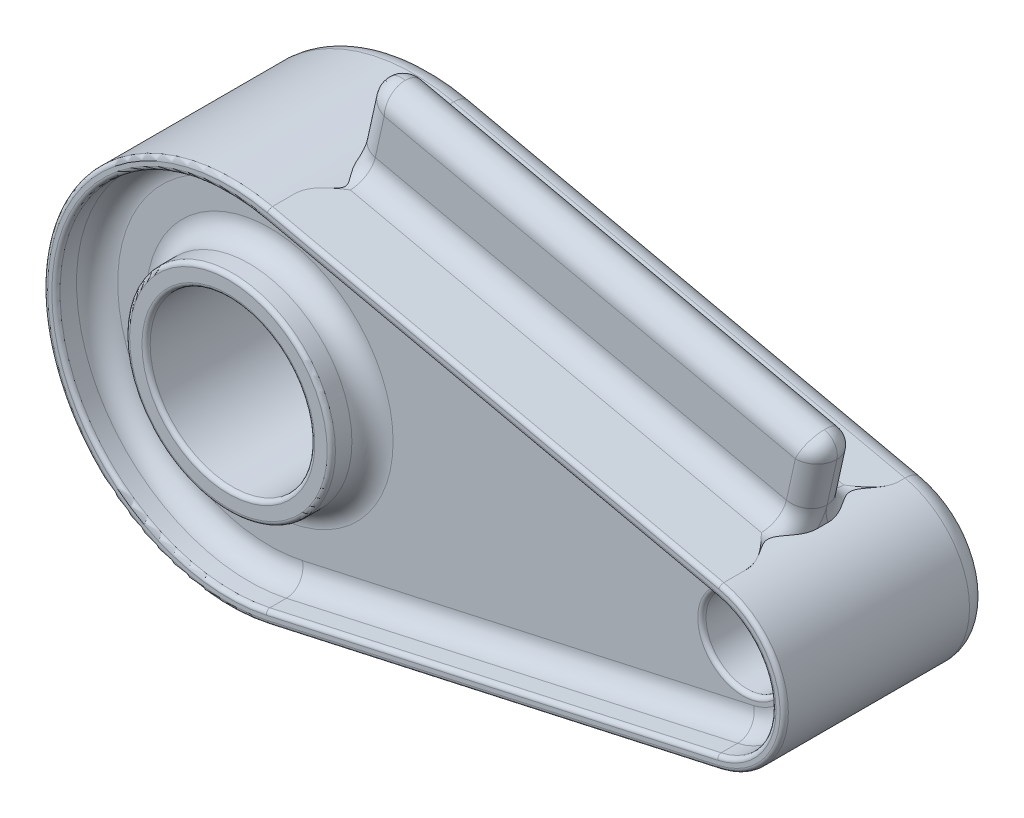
ISO-10303-21;
HEADER;
FILE_DESCRIPTION(('STEP AP214'),'2;1');
FILE_NAME('part.step','',(''),(''),'','','');
FILE_SCHEMA(('AUTOMOTIVE_DESIGN { 1 0 10303 214 1 1 1 1 }'));
ENDSEC;
DATA;
#1=APPLICATION_CONTEXT('core data for automotive mechanical design processes');
#2=APPLICATION_PROTOCOL_DEFINITION('international standard','automotive_design',2000,#1);
#3=PRODUCT_CONTEXT('',#1,'mechanical');
#4=PRODUCT('Part','Part','',(#3));
#5=PRODUCT_RELATED_PRODUCT_CATEGORY('part','',(#4));
#6=PRODUCT_DEFINITION_FORMATION('','',#4);
#7=PRODUCT_DEFINITION_CONTEXT('part definition',#1,'design');
#8=PRODUCT_DEFINITION('design','',#6,#7);
#9=PRODUCT_DEFINITION_SHAPE('','',#8);
#10=(LENGTH_UNIT() NAMED_UNIT(*) SI_UNIT(.MILLI.,.METRE.));
#11=(NAMED_UNIT(*) PLANE_ANGLE_UNIT() SI_UNIT($,.RADIAN.));
#12=(NAMED_UNIT(*) SI_UNIT($,.STERADIAN.) SOLID_ANGLE_UNIT());
#13=UNCERTAINTY_MEASURE_WITH_UNIT(LENGTH_MEASURE(1.E-05),#10,'distance_accuracy_value','');
#14=(GEOMETRIC_REPRESENTATION_CONTEXT(3) GLOBAL_UNCERTAINTY_ASSIGNED_CONTEXT((#13)) GLOBAL_UNIT_ASSIGNED_CONTEXT((#10,
#11,#12)) REPRESENTATION_CONTEXT('',''));
#15=CARTESIAN_POINT('',(0.,0.,0.));
#16=DIRECTION('',(0.,0.,1.));
#17=DIRECTION('',(1.,0.,0.));
#18=AXIS2_PLACEMENT_3D('',#15,#16,#17);
#19=CARTESIAN_POINT('',(7.5753864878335,34.1703602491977,0.));
#20=DIRECTION('',(0.976296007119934,-0.2164396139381,0.));
#21=DIRECTION('',(0.2164396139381,0.976296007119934,0.));
#22=AXIS2_PLACEMENT_3D('',#19,#20,#21);
#23=CYLINDRICAL_SURFACE('',#22,5.);
#24=DIRECTION('',(0.976296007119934,-0.2164396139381,0.));
#25=VECTOR('',#24,1.);
#26=CARTESIAN_POINT('',(-102.037311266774,58.4709102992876,-5.));
#27=LINE('',#26,#25);
#28=CARTESIAN_POINT('',(-97.1558312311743,57.3887122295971,-5.));
#29=VERTEX_POINT('',#28);
#30=CARTESIAN_POINT('',(2.69390645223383,35.2525583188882,-5.));
#31=VERTEX_POINT('',#30);
#32=EDGE_CURVE('E385',#29,#31,#27,.T.);
#33=ORIENTED_EDGE('',*,*,#32,.F.);
#34=CARTESIAN_POINT('',(-97.1558312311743,57.3887122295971,0.));
#35=DIRECTION('',(-0.999784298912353,0.0207691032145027,0.));
#36=DIRECTION('',(-0.0207691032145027,-0.999784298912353,0.));
#37=AXIS2_PLACEMENT_3D('',#34,#35,#36);
#38=ELLIPSE('',#37,5.09901951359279,5.);
#39=CARTESIAN_POINT('',(-97.0499291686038,62.4866318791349,0.));
#40=VERTEX_POINT('',#39);
#41=EDGE_CURVE('E468',#29,#40,#38,.F.);
#42=ORIENTED_EDGE('',*,*,#41,.T.);
#43=CARTESIAN_POINT('',(-97.1558312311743,57.3887122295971,0.));
#44=DIRECTION('',(-0.999784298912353,0.0207691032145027,0.));
#45=DIRECTION('',(-0.0207691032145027,-0.999784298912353,0.));
#46=AXIS2_PLACEMENT_3D('',#43,#44,#45);
#47=ELLIPSE('',#46,5.09901951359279,5.);
#48=CARTESIAN_POINT('',(-97.1558312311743,57.3887122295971,5.));
#49=VERTEX_POINT('',#48);
#50=EDGE_CURVE('E479',#40,#49,#47,.F.);
#51=ORIENTED_EDGE('',*,*,#50,.T.);
#52=DIRECTION('',(-0.976296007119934,0.2164396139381,0.));
#53=VECTOR('',#52,1.);
#54=CARTESIAN_POINT('',(7.5753864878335,34.1703602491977,5.));
#55=LINE('',#54,#53);
#56=CARTESIAN_POINT('',(2.69390645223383,35.2525583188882,5.));
#57=VERTEX_POINT('',#56);
#58=EDGE_CURVE('E382',#57,#49,#55,.T.);
#59=ORIENTED_EDGE('',*,*,#58,.F.);
#60=CARTESIAN_POINT('',(2.69390645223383,35.2525583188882,0.));
#61=DIRECTION('',(-0.914889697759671,0.403703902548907,0.));
#62=DIRECTION('',(0.403703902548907,0.914889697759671,0.));
#63=AXIS2_PLACEMENT_3D('',#60,#61,#62);
#64=ELLIPSE('',#63,5.09901951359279,5.);
#65=CARTESIAN_POINT('',(4.75240052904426,39.9175987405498,0.));
#66=VERTEX_POINT('',#65);
#67=EDGE_CURVE('E486',#57,#66,#64,.T.);
#68=ORIENTED_EDGE('',*,*,#67,.T.);
#69=CARTESIAN_POINT('',(2.69390645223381,35.2525583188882,0.));
#70=DIRECTION('',(-0.914889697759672,0.403703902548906,0.));
#71=DIRECTION('',(0.403703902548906,0.914889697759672,0.));
#72=AXIS2_PLACEMENT_3D('',#69,#70,#71);
#73=ELLIPSE('',#72,5.09901951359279,5.);
#74=EDGE_CURVE('E470',#66,#31,#73,.T.);
#75=ORIENTED_EDGE('',*,*,#74,.T.);
#76=EDGE_LOOP('',(#33,#42,#51,#59,#68,#75));
#77=FACE_BOUND('',#76,.T.);
#78=ADVANCED_FACE('F33',(#77),#23,.T.);
#79=CARTESIAN_POINT('',(-105.283905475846,43.8264701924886,25.));
#80=DIRECTION('',(-0.2164396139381,-0.976296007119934,0.));
#81=DIRECTION('',(0.976296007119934,-0.2164396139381,0.));
#82=AXIS2_PLACEMENT_3D('',#79,#80,#81);
#83=PLANE('',#82);
#84=DIRECTION('',(0.,0.,-1.));
#85=VECTOR('',#84,1.);
#86=CARTESIAN_POINT('',(4.328792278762,19.5259201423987,25.));
#87=LINE('',#86,#85);
#88=CARTESIAN_POINT('',(4.328792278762,19.5259201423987,24.));
#89=VERTEX_POINT('',#88);
#90=CARTESIAN_POINT('',(4.328792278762,19.5259201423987,18.6602540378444));
#91=VERTEX_POINT('',#90);
#92=EDGE_CURVE('E266',#89,#91,#87,.T.);
#93=ORIENTED_EDGE('',*,*,#92,.T.);
#94=CARTESIAN_POINT('',(4.328792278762,19.5259201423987,18.6602540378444));
#95=CARTESIAN_POINT('',(4.32882127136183,19.525913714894,18.4460157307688));
#96=CARTESIAN_POINT('',(4.31871463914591,19.5281543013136,18.2319025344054));
#97=CARTESIAN_POINT('',(4.27961847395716,19.5368217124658,17.8058022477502));
#98=CARTESIAN_POINT('',(4.25065767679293,19.5432421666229,17.5938124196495));
#99=CARTESIAN_POINT('',(4.17568764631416,19.5598626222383,17.175707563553));
#100=CARTESIAN_POINT('',(4.12988800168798,19.5700161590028,16.9695525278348));
#101=CARTESIAN_POINT('',(4.0226284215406,19.5937950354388,16.5614970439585));
#102=CARTESIAN_POINT('',(3.96116100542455,19.6074220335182,16.3595986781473));
#103=CARTESIAN_POINT('',(3.79852650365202,19.6434772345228,15.8867640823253));
#104=CARTESIAN_POINT('',(3.69109691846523,19.6672938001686,15.6180808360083));
#105=CARTESIAN_POINT('',(3.4533609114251,19.7199986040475,15.0915990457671));
#106=CARTESIAN_POINT('',(3.32304755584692,19.7488883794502,14.8338038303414));
#107=CARTESIAN_POINT('',(3.04259651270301,19.8110628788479,14.3282446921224));
#108=CARTESIAN_POINT('',(2.89236713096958,19.8443679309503,14.0805345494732));
#109=CARTESIAN_POINT('',(2.57603584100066,19.9144968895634,13.5959117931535));
#110=CARTESIAN_POINT('',(2.40992667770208,19.9513224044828,13.3590041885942));
#111=CARTESIAN_POINT('',(1.82097313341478,20.0818902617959,12.5665031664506));
#112=CARTESIAN_POINT('',(1.36774439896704,20.1823686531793,12.0348194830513));
#113=CARTESIAN_POINT('',(0.42872365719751,20.3905445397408,11.0054208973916));
#114=CARTESIAN_POINT('',(-0.057042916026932,20.4982363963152,10.5076800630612));
#115=CARTESIAN_POINT('',(-0.546179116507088,20.6066752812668,10.0066666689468));
#116=CARTESIAN_POINT('',(-0.54943343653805,20.6073967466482,10.0033333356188));
#117=CARTESIAN_POINT('',(-0.55268775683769,20.6081182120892,10.));
#118=B_SPLINE_CURVE_WITH_KNOTS('',3,(#94,#95,#96,#97,#98,#99,#100,#101,#102,#103,#104,#105,#106,
#107,#108,#109,#110,#111,#112,#113,#114,#115,#116,#117),.UNSPECIFIED.,.F.,.F.,(4,2,2,2,2,2,2,2,
2,2,2,4),(0.,0.642281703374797,1.2835867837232,1.9171659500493,2.55104818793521,
3.42069998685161,4.29061574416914,5.16468554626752,6.03915661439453,8.15226547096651,
10.2637414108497,10.2778835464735),.UNSPECIFIED.);
#119=CARTESIAN_POINT('',(-0.552687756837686,20.6081182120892,10.));
#120=VERTEX_POINT('',#119);
#121=EDGE_CURVE('E512',#91,#120,#118,.T.);
#122=ORIENTED_EDGE('',*,*,#121,.T.);
#123=DIRECTION('',(0.976296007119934,-0.2164396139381,0.));
#124=VECTOR('',#123,1.);
#125=CARTESIAN_POINT('',(-105.283905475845,43.8264701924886,10.));
#126=LINE('',#125,#124);
#127=CARTESIAN_POINT('',(-100.402425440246,42.7442721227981,10.));
#128=VERTEX_POINT('',#127);
#129=EDGE_CURVE('E379',#120,#128,#126,.F.);
#130=ORIENTED_EDGE('',*,*,#129,.T.);
#131=CARTESIAN_POINT('',(-105.283905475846,43.8264701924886,18.6602540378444));
#132=CARTESIAN_POINT('',(-105.283934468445,43.8264766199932,18.4460157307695));
#133=CARTESIAN_POINT('',(-105.273827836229,43.8242360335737,18.2319025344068));
#134=CARTESIAN_POINT('',(-105.234731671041,43.8155686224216,17.805802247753));
#135=CARTESIAN_POINT('',(-105.205770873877,43.8091481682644,17.593812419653));
#136=CARTESIAN_POINT('',(-105.130800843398,43.7925277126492,17.1757075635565));
#137=CARTESIAN_POINT('',(-105.085001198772,43.7823741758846,16.9695525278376));
#138=CARTESIAN_POINT('',(-104.977741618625,43.7585952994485,16.5614970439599));
#139=CARTESIAN_POINT('',(-104.916274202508,43.7449683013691,16.3595986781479));
#140=CARTESIAN_POINT('',(-104.753639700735,43.7089131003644,15.8867640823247));
#141=CARTESIAN_POINT('',(-104.646210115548,43.6850965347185,15.6180808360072));
#142=CARTESIAN_POINT('',(-104.408474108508,43.6323917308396,15.091599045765));
#143=CARTESIAN_POINT('',(-104.278160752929,43.6035019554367,14.8338038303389));
#144=CARTESIAN_POINT('',(-103.997709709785,43.5413274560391,14.32824469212));
#145=CARTESIAN_POINT('',(-103.847480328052,43.5080224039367,14.0805345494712));
#146=CARTESIAN_POINT('',(-103.531149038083,43.4378934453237,13.5959117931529));
#147=CARTESIAN_POINT('',(-103.365039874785,43.4010679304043,13.3590041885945));
#148=CARTESIAN_POINT('',(-102.7760863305,43.2705000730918,12.5665031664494));
#149=CARTESIAN_POINT('',(-102.322857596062,43.1700216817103,12.0348194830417));
#150=CARTESIAN_POINT('',(-101.383836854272,42.9618457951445,11.0054208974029));
#151=CARTESIAN_POINT('',(-100.898070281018,42.8541539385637,10.5076800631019));
#152=CARTESIAN_POINT('',(-100.408934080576,42.7457150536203,10.0066666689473));
#153=CARTESIAN_POINT('',(-100.405679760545,42.744993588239,10.0033333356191));
#154=CARTESIAN_POINT('',(-100.402425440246,42.7442721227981,10.));
#155=B_SPLINE_CURVE_WITH_KNOTS('',3,(#131,#132,#133,#134,#135,#136,#137,#138,#139,#140,#141,
#142,#143,#144,#145,#146,#147,#148,#149,#150,#151,#152,#153,#154),.UNSPECIFIED.,.F.,.F.,(4,2,2,
2,2,2,2,2,2,2,2,4),(0.,0.642281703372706,1.28358678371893,1.91716595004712,2.55104818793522,
3.42069998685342,4.2906157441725,5.16468554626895,6.03915661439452,8.15226547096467,
10.2637414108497,10.2778835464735),.UNSPECIFIED.);
#156=CARTESIAN_POINT('',(-105.283905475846,43.8264701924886,18.6602540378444));
#157=VERTEX_POINT('',#156);
#158=EDGE_CURVE('E506',#128,#157,#155,.F.);
#159=ORIENTED_EDGE('',*,*,#158,.T.);
#160=DIRECTION('',(0.,0.,-1.));
#161=VECTOR('',#160,1.);
#162=CARTESIAN_POINT('',(-105.283905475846,43.8264701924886,25.));
#163=LINE('',#162,#161);
#164=CARTESIAN_POINT('',(-105.283905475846,43.8264701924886,24.));
#165=VERTEX_POINT('',#164);
#166=EDGE_CURVE('E237',#165,#157,#163,.T.);
#167=ORIENTED_EDGE('',*,*,#166,.F.);
#168=DIRECTION('',(-0.976296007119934,0.2164396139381,0.));
#169=VECTOR('',#168,1.);
#170=CARTESIAN_POINT('',(-105.283905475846,43.8264701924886,24.));
#171=LINE('',#170,#169);
#172=EDGE_CURVE('E357',#165,#89,#171,.F.);
#173=ORIENTED_EDGE('',*,*,#172,.T.);
#174=EDGE_LOOP('',(#93,#122,#130,#159,#167,#173));
#175=FACE_BOUND('',#174,.T.);
#176=ADVANCED_FACE('F452',(#175),#83,.F.);
#177=CARTESIAN_POINT('',(-2.63677968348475E-13,-1.52655665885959E-13,25.));
#178=DIRECTION('',(0.,0.,-1.));
#179=DIRECTION('',(-1.,0.,0.));
#180=AXIS2_PLACEMENT_3D('',#177,#178,#179);
#181=PLANE('',#180);
#182=CARTESIAN_POINT('',(-115.,0.,25.));
#183=DIRECTION('',(0.,0.,-1.));
#184=DIRECTION('',(-1.,0.,0.));
#185=AXIS2_PLACEMENT_3D('',#182,#183,#184);
#186=CIRCLE('',#185,24.);
#187=CARTESIAN_POINT('',(-139.,0.,25.));
#188=VERTEX_POINT('',#187);
#189=EDGE_CURVE('E328',#188,#188,#186,.F.);
#190=ORIENTED_EDGE('',*,*,#189,.T.);
#191=EDGE_LOOP('',(#190));
#192=FACE_BOUND('',#191,.T.);
#193=CARTESIAN_POINT('',(-115.,0.,25.));
#194=DIRECTION('',(0.,0.,-1.));
#195=DIRECTION('',(-1.,0.,0.));
#196=AXIS2_PLACEMENT_3D('',#193,#194,#195);
#197=CIRCLE('',#196,21.);
#198=CARTESIAN_POINT('',(-136.,0.,25.));
#199=VERTEX_POINT('',#198);
#200=EDGE_CURVE('E325',#199,#199,#197,.T.);
#201=ORIENTED_EDGE('',*,*,#200,.T.);
#202=EDGE_LOOP('',(#201));
#203=FACE_BOUND('',#202,.T.);
#204=ADVANCED_FACE('F462',(#192,#203),#181,.F.);
#205=CARTESIAN_POINT('',(-2.63677968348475E-13,-1.52655665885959E-13,25.));
#206=DIRECTION('',(0.,0.,-1.));
#207=DIRECTION('',(-1.,0.,0.));
#208=AXIS2_PLACEMENT_3D('',#205,#206,#207);
#209=CYLINDRICAL_SURFACE('',#208,10.);
#210=CARTESIAN_POINT('',(-2.63677968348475E-13,-1.52655665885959E-13,14.));
#211=DIRECTION('',(0.,0.,1.));
#212=DIRECTION('',(1.,0.,0.));
#213=AXIS2_PLACEMENT_3D('',#210,#211,#212);
#214=CIRCLE('',#213,10.);
#215=CARTESIAN_POINT('',(9.99999999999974,-1.52655665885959E-13,14.));
#216=VERTEX_POINT('',#215);
#217=EDGE_CURVE('E319',#216,#216,#214,.T.);
#218=ORIENTED_EDGE('',*,*,#217,.T.);
#219=EDGE_LOOP('',(#218));
#220=FACE_BOUND('',#219,.T.);
#221=CARTESIAN_POINT('',(-2.63677968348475E-13,-1.52655665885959E-13,-24.));
#222=DIRECTION('',(0.,0.,-1.));
#223=DIRECTION('',(-1.,0.,0.));
#224=AXIS2_PLACEMENT_3D('',#221,#222,#223);
#225=CIRCLE('',#224,10.);
#226=CARTESIAN_POINT('',(-10.0000000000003,-1.52655665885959E-13,-24.));
#227=VERTEX_POINT('',#226);
#228=EDGE_CURVE('E316',#227,#227,#225,.T.);
#229=ORIENTED_EDGE('',*,*,#228,.T.);
#230=EDGE_LOOP('',(#229));
#231=FACE_BOUND('',#230,.T.);
#232=ADVANCED_FACE('F742',(#220,#231),#209,.F.);
#233=CARTESIAN_POINT('',(-115.,0.,25.));
#234=DIRECTION('',(0.,0.,-1.));
#235=DIRECTION('',(-1.,0.,0.));
#236=AXIS2_PLACEMENT_3D('',#233,#234,#235);
#237=CIRCLE('',#236,43.8905556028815);
#238=CARTESIAN_POINT('',(-105.500345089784,42.8501741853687,25.));
#239=VERTEX_POINT('',#238);
#240=CARTESIAN_POINT('',(-105.500345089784,-42.8501741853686,25.));
#241=VERTEX_POINT('',#240);
#242=EDGE_CURVE('E347',#239,#241,#237,.F.);
#243=ORIENTED_EDGE('',*,*,#242,.T.);
#244=DIRECTION('',(0.976296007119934,0.2164396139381,0.));
#245=VECTOR('',#244,1.);
#246=CARTESIAN_POINT('',(4.11235266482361,-18.5496241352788,25.));
#247=LINE('',#246,#245);
#248=CARTESIAN_POINT('',(4.11235266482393,-18.5496241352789,25.));
#249=VERTEX_POINT('',#248);
#250=EDGE_CURVE('E349',#241,#249,#247,.T.);
#251=ORIENTED_EDGE('',*,*,#250,.T.);
#252=CARTESIAN_POINT('',(-2.63677968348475E-13,-1.52655665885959E-13,25.));
#253=DIRECTION('',(0.,0.,-1.));
#254=DIRECTION('',(-1.,0.,0.));
#255=AXIS2_PLACEMENT_3D('',#252,#253,#254);
#256=CIRCLE('',#255,19.0000000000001);
#257=CARTESIAN_POINT('',(4.11235266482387,18.5496241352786,25.));
#258=VERTEX_POINT('',#257);
#259=EDGE_CURVE('E343',#249,#258,#256,.F.);
#260=ORIENTED_EDGE('',*,*,#259,.T.);
#261=DIRECTION('',(-0.976296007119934,0.2164396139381,0.));
#262=VECTOR('',#261,1.);
#263=CARTESIAN_POINT('',(4.11235266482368,18.5496241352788,25.));
#264=LINE('',#263,#262);
#265=EDGE_CURVE('E345',#258,#239,#264,.T.);
#266=ORIENTED_EDGE('',*,*,#265,.T.);
#267=EDGE_LOOP('',(#243,#251,#260,#266));
#268=FACE_BOUND('',#267,.T.);
#269=DIRECTION('',(-0.976296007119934,0.216439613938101,0.));
#270=VECTOR('',#269,1.);
#271=CARTESIAN_POINT('',(3.89591305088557,17.5733281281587,25.));
#272=LINE('',#271,#270);
#273=CARTESIAN_POINT('',(-105.716784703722,41.8738781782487,25.));
#274=VERTEX_POINT('',#273);
#275=CARTESIAN_POINT('',(3.89591305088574,17.5733281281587,25.));
#276=VERTEX_POINT('',#275);
#277=EDGE_CURVE('E338',#274,#276,#272,.F.);
#278=ORIENTED_EDGE('',*,*,#277,.T.);
#279=CARTESIAN_POINT('',(-2.63677968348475E-13,-1.52655665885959E-13,25.));
#280=DIRECTION('',(0.,0.,-1.));
#281=DIRECTION('',(-1.,0.,0.));
#282=AXIS2_PLACEMENT_3D('',#279,#280,#281);
#283=CIRCLE('',#282,18.0000000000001);
#284=CARTESIAN_POINT('',(3.8959130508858,-17.573328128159,25.));
#285=VERTEX_POINT('',#284);
#286=EDGE_CURVE('E340',#276,#285,#283,.T.);
#287=ORIENTED_EDGE('',*,*,#286,.T.);
#288=DIRECTION('',(0.976296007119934,0.216439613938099,0.));
#289=VECTOR('',#288,1.);
#290=CARTESIAN_POINT('',(3.89591305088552,-17.573328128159,25.));
#291=LINE('',#290,#289);
#292=CARTESIAN_POINT('',(-105.716784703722,-41.8738781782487,25.));
#293=VERTEX_POINT('',#292);
#294=EDGE_CURVE('E334',#285,#293,#291,.F.);
#295=ORIENTED_EDGE('',*,*,#294,.T.);
#296=CARTESIAN_POINT('',(-115.,0.,25.));
#297=DIRECTION('',(0.,0.,-1.));
#298=DIRECTION('',(-1.,0.,0.));
#299=AXIS2_PLACEMENT_3D('',#296,#297,#298);
#300=CIRCLE('',#299,42.8905556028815);
#301=EDGE_CURVE('E336',#293,#274,#300,.T.);
#302=ORIENTED_EDGE('',*,*,#301,.T.);
#303=EDGE_LOOP('',(#278,#287,#295,#302));
#304=FACE_BOUND('',#303,.T.);
#305=ADVANCED_FACE('F453',(#268,#304),#181,.F.);
#306=CARTESIAN_POINT('',(-2.63677968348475E-13,-1.52655665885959E-13,-25.));
#307=DIRECTION('',(0.,0.,-1.));
#308=DIRECTION('',(-1.,0.,0.));
#309=AXIS2_PLACEMENT_3D('',#306,#307,#308);
#310=PLANE('',#309);
#311=CARTESIAN_POINT('',(-115.,0.,-25.));
#312=DIRECTION('',(0.,0.,-1.));
#313=DIRECTION('',(-1.,0.,0.));
#314=AXIS2_PLACEMENT_3D('',#311,#312,#313);
#315=CIRCLE('',#314,21.);
#316=CARTESIAN_POINT('',(-136.,0.,-25.));
#317=VERTEX_POINT('',#316);
#318=EDGE_CURVE('E307',#317,#317,#315,.F.);
#319=ORIENTED_EDGE('',*,*,#318,.T.);
#320=EDGE_LOOP('',(#319));
#321=FACE_BOUND('',#320,.T.);
#322=CARTESIAN_POINT('',(-2.63677968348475E-13,-1.52655665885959E-13,-25.));
#323=DIRECTION('',(0.,0.,-1.));
#324=DIRECTION('',(-1.,0.,0.));
#325=AXIS2_PLACEMENT_3D('',#322,#323,#324);
#326=CIRCLE('',#325,11.);
#327=CARTESIAN_POINT('',(-11.0000000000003,-1.52655665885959E-13,-25.));
#328=VERTEX_POINT('',#327);
#329=EDGE_CURVE('E304',#328,#328,#326,.F.);
#330=ORIENTED_EDGE('',*,*,#329,.T.);
#331=EDGE_LOOP('',(#330));
#332=FACE_BOUND('',#331,.T.);
#333=CARTESIAN_POINT('',(-115.,0.,-25.));
#334=DIRECTION('',(0.,0.,-1.));
#335=DIRECTION('',(-1.,0.,0.));
#336=AXIS2_PLACEMENT_3D('',#333,#334,#335);
#337=CIRCLE('',#336,39.8905556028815);
#338=CARTESIAN_POINT('',(-106.366103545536,-38.9449901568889,-25.));
#339=VERTEX_POINT('',#338);
#340=CARTESIAN_POINT('',(-106.366103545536,38.9449901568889,-25.));
#341=VERTEX_POINT('',#340);
#342=EDGE_CURVE('E265',#339,#341,#337,.T.);
#343=ORIENTED_EDGE('',*,*,#342,.T.);
#344=DIRECTION('',(-0.976296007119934,0.2164396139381,0.));
#345=VECTOR('',#344,1.);
#346=CARTESIAN_POINT('',(3.2465942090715,14.644440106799,-25.));
#347=LINE('',#346,#345);
#348=CARTESIAN_POINT('',(3.24659420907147,14.6444401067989,-25.));
#349=VERTEX_POINT('',#348);
#350=EDGE_CURVE('E248',#341,#349,#347,.F.);
#351=ORIENTED_EDGE('',*,*,#350,.T.);
#352=CARTESIAN_POINT('',(-2.63677968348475E-13,-1.52655665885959E-13,-25.));
#353=DIRECTION('',(0.,0.,-1.));
#354=DIRECTION('',(-1.,0.,0.));
#355=AXIS2_PLACEMENT_3D('',#352,#353,#354);
#356=CIRCLE('',#355,15.0000000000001);
#357=CARTESIAN_POINT('',(3.24659420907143,-14.644440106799,-25.));
#358=VERTEX_POINT('',#357);
#359=EDGE_CURVE('E274',#349,#358,#356,.T.);
#360=ORIENTED_EDGE('',*,*,#359,.T.);
#361=DIRECTION('',(0.976296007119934,0.2164396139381,0.));
#362=VECTOR('',#361,1.);
#363=CARTESIAN_POINT('',(-106.366103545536,-38.9449901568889,-25.));
#364=LINE('',#363,#362);
#365=EDGE_CURVE('E268',#358,#339,#364,.F.);
#366=ORIENTED_EDGE('',*,*,#365,.T.);
#367=EDGE_LOOP('',(#343,#351,#360,#366));
#368=FACE_BOUND('',#367,.T.);
#369=ADVANCED_FACE('F445',(#321,#332,#368),#310,.T.);
#370=CARTESIAN_POINT('',(-2.63677968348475E-13,-1.52655665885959E-13,25.));
#371=DIRECTION('',(0.,0.,-1.));
#372=DIRECTION('',(-1.,0.,0.));
#373=AXIS2_PLACEMENT_3D('',#370,#371,#372);
#374=CYLINDRICAL_SURFACE('',#373,20.0000000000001);
#375=ORIENTED_EDGE('',*,*,#92,.F.);
#376=CARTESIAN_POINT('',(-2.63677968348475E-13,-1.52655665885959E-13,24.));
#377=DIRECTION('',(0.,0.,-1.));
#378=DIRECTION('',(-1.,0.,0.));
#379=AXIS2_PLACEMENT_3D('',#376,#377,#378);
#380=CIRCLE('',#379,20.0000000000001);
#381=CARTESIAN_POINT('',(4.328792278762,-19.5259201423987,24.));
#382=VERTEX_POINT('',#381);
#383=EDGE_CURVE('E359',#89,#382,#380,.T.);
#384=ORIENTED_EDGE('',*,*,#383,.T.);
#385=DIRECTION('',(0.,0.,-1.));
#386=VECTOR('',#385,1.);
#387=CARTESIAN_POINT('',(4.328792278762,-19.5259201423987,25.));
#388=LINE('',#387,#386);
#389=CARTESIAN_POINT('',(4.328792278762,-19.5259201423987,-20.));
#390=VERTEX_POINT('',#389);
#391=EDGE_CURVE('E609',#382,#390,#388,.T.);
#392=ORIENTED_EDGE('',*,*,#391,.T.);
#393=CARTESIAN_POINT('',(-2.63677968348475E-13,-1.52655665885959E-13,-20.));
#394=DIRECTION('',(0.,0.,-1.));
#395=DIRECTION('',(-1.,0.,0.));
#396=AXIS2_PLACEMENT_3D('',#393,#394,#395);
#397=CIRCLE('',#396,20.0000000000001);
#398=CARTESIAN_POINT('',(4.328792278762,19.5259201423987,-20.));
#399=VERTEX_POINT('',#398);
#400=EDGE_CURVE('E277',#390,#399,#397,.F.);
#401=ORIENTED_EDGE('',*,*,#400,.T.);
#402=CARTESIAN_POINT('',(4.328792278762,19.5259201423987,-18.6602540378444));
#403=VERTEX_POINT('',#402);
#404=EDGE_CURVE('E263',#403,#399,#87,.T.);
#405=ORIENTED_EDGE('',*,*,#404,.F.);
#406=CARTESIAN_POINT('',(4.328792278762,19.5259201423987,-18.6602540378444));
#407=CARTESIAN_POINT('',(4.32882519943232,19.5258842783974,-18.445204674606));
#408=CARTESIAN_POINT('',(4.31864053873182,19.5281710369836,-18.2302845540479));
#409=CARTESIAN_POINT('',(4.27924188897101,19.536857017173,-17.8025948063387));
#410=CARTESIAN_POINT('',(4.25005733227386,19.5432498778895,-17.5898223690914));
#411=CARTESIAN_POINT('',(4.1748055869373,19.559457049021,-17.1718079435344));
#412=CARTESIAN_POINT('',(4.1290826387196,19.5692014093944,-16.966500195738));
#413=CARTESIAN_POINT('',(4.02218050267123,19.5914537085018,-16.5600638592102));
#414=CARTESIAN_POINT('',(3.96099597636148,19.6039626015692,-16.3589367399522));
#415=CARTESIAN_POINT('',(3.81169218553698,19.6335894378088,-15.9232806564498));
#416=CARTESIAN_POINT('',(3.72065450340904,19.6511310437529,-15.6897846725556));
#417=CARTESIAN_POINT('',(3.52203016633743,19.687698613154,-15.2300926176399));
#418=CARTESIAN_POINT('',(3.41443953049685,19.7067249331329,-15.0038983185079));
#419=CARTESIAN_POINT('',(3.18480170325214,19.7451446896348,-14.5555631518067));
#420=CARTESIAN_POINT('',(3.06259375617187,19.7645397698,-14.33350572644));
#421=CARTESIAN_POINT('',(2.80894416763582,19.8021765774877,-13.894874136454));
#422=CARTESIAN_POINT('',(2.67750764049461,19.8204189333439,-13.6782970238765));
#423=CARTESIAN_POINT('',(2.47737562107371,19.8460866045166,-13.3558192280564));
#424=CARTESIAN_POINT('',(2.41031574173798,19.8543439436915,-13.248951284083));
#425=CARTESIAN_POINT('',(2.27586887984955,19.8702035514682,-13.0353723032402));
#426=CARTESIAN_POINT('',(2.20848189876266,19.8778058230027,-12.9286612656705));
#427=CARTESIAN_POINT('',(2.07408411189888,19.8922787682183,-12.714588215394));
#428=CARTESIAN_POINT('',(2.00707460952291,19.8991476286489,-12.6072252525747));
#429=CARTESIAN_POINT('',(1.8746761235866,19.9120569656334,-12.3914631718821));
#430=CARTESIAN_POINT('',(1.80928704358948,19.9180974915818,-12.2830641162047));
#431=CARTESIAN_POINT('',(1.68244279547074,19.9292088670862,-12.0661224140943));
#432=CARTESIAN_POINT('',(1.62094270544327,19.9342931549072,-11.9576074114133));
#433=CARTESIAN_POINT('',(1.50250222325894,19.9435715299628,-11.7380957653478));
#434=CARTESIAN_POINT('',(1.44556350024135,19.9477652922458,-11.6270982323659));
#435=CARTESIAN_POINT('',(1.28522766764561,19.9589434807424,-11.2900605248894));
#436=CARTESIAN_POINT('',(1.19153159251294,19.9645895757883,-11.0587417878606));
#437=CARTESIAN_POINT('',(1.09979811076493,19.969752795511,-10.7401550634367));
#438=CARTESIAN_POINT('',(1.07956948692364,19.970849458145,-10.6593150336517));
#439=CARTESIAN_POINT('',(1.04566869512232,19.9726526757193,-10.4962128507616));
#440=CARTESIAN_POINT('',(1.03199875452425,19.9733590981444,-10.4139502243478));
#441=CARTESIAN_POINT('',(1.01198863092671,19.9743832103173,-10.2487148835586));
#442=CARTESIAN_POINT('',(1.00563162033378,19.9747017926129,-10.1657442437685));
#443=CARTESIAN_POINT('',(1.00057229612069,19.9749558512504,-9.99957420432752));
#444=CARTESIAN_POINT('',(1.00186910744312,19.9748913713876,-9.91637483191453));
#445=CARTESIAN_POINT('',(1.01202668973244,19.974379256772,-9.75059092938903));
#446=CARTESIAN_POINT('',(1.0208745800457,19.9739322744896,-9.6680055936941));
#447=CARTESIAN_POINT('',(1.04560601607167,19.9726527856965,-9.50389425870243));
#448=CARTESIAN_POINT('',(1.06149137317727,19.9718201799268,-9.42236853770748));
#449=CARTESIAN_POINT('',(1.09955222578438,19.9697607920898,-9.26051499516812));
#450=CARTESIAN_POINT('',(1.12175015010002,19.968532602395,-9.1801925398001));
#451=CARTESIAN_POINT('',(1.17145044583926,19.9656786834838,-9.02127145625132));
#452=CARTESIAN_POINT('',(1.19895074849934,19.9640531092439,-8.94267216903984));
#453=CARTESIAN_POINT('',(1.28209183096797,19.9589348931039,-8.72485038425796));
#454=CARTESIAN_POINT('',(1.34262497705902,19.9549898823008,-8.58751421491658));
#455=CARTESIAN_POINT('',(1.47306197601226,19.9457858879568,-8.31737122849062));
#456=CARTESIAN_POINT('',(1.54297666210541,19.9405253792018,-8.18456987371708));
#457=CARTESIAN_POINT('',(1.68885703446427,19.9287014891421,-7.92172933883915));
#458=CARTESIAN_POINT('',(1.76484615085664,19.922132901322,-7.79170357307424));
#459=CARTESIAN_POINT('',(1.91994974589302,19.9077839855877,-7.53370346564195));
#460=CARTESIAN_POINT('',(1.9990628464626,19.9000041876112,-7.4057282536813));
#461=CARTESIAN_POINT('',(2.15927010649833,19.8832619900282,-7.14933758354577));
#462=CARTESIAN_POINT('',(2.24037612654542,19.8742886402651,-7.02093031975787));
#463=CARTESIAN_POINT('',(2.40223423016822,19.8553749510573,-6.76394822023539));
#464=CARTESIAN_POINT('',(2.48298628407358,19.845434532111,-6.63537337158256));
#465=CARTESIAN_POINT('',(2.64266867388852,19.8248019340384,-6.3775479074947));
#466=CARTESIAN_POINT('',(2.7216026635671,19.8141114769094,-6.24829943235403));
#467=CARTESIAN_POINT('',(2.87674579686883,19.7921821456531,-5.9882210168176));
#468=CARTESIAN_POINT('',(2.9529550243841,19.7809432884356,-5.85739112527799));
#469=CARTESIAN_POINT('',(3.1020668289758,19.7581096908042,-5.59300472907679));
#470=CARTESIAN_POINT('',(3.17495088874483,19.7465134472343,-5.45943783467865));
#471=CARTESIAN_POINT('',(3.31611916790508,19.7232979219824,-5.18989923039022));
#472=CARTESIAN_POINT('',(3.384403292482,19.7116786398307,-5.05392747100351));
#473=CARTESIAN_POINT('',(3.58123045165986,19.6772072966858,-4.64182061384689));
#474=CARTESIAN_POINT('',(3.70165180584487,19.6547569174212,-4.36166055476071));
#475=CARTESIAN_POINT('',(3.91407468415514,19.6135599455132,-3.79275116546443));
#476=CARTESIAN_POINT('',(4.0062794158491,19.5947872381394,-3.50408049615));
#477=CARTESIAN_POINT('',(4.15835140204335,19.5630830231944,-2.91820060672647));
#478=CARTESIAN_POINT('',(4.21826236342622,19.5501436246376,-2.62100350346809));
#479=CARTESIAN_POINT('',(4.28247778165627,19.5361433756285,-2.15891178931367));
#480=CARTESIAN_POINT('',(4.29968318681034,19.5323563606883,-1.99583038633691));
#481=CARTESIAN_POINT('',(4.32285566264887,19.5272368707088,-1.66844159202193));
#482=CARTESIAN_POINT('',(4.32879538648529,19.5259103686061,-1.50413218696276));
#483=CARTESIAN_POINT('',(4.32879227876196,19.5259201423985,-1.33974596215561));
#484=B_SPLINE_CURVE_WITH_KNOTS('',3,(#406,#407,#408,#409,#410,#411,#412,#413,#414,#415,#416,
#417,#418,#419,#420,#421,#422,#423,#424,#425,#426,#427,#428,#429,#430,#431,#432,#433,#434,#435,
#436,#437,#438,#439,#440,#441,#442,#443,#444,#445,#446,#447,#448,#449,#450,#451,#452,#453,#454,
#455,#456,#457,#458,#459,#460,#461,#462,#463,#464,#465,#466,#467,#468,#469,#470,#471,#472,#473,
#474,#475,#476,#477,#478,#479,#480,#481,#482,#483),.UNSPECIFIED.,.F.,.F.,(4,2,2,2,2,2,2,2,2,2,2,
2,2,2,2,2,2,2,2,2,2,2,2,2,2,2,2,2,2,2,2,2,2,2,2,2,2,2,4),(0.,0.644705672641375,1.28841501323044,
1.91943163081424,2.55066642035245,3.30355452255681,4.05662397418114,4.81890630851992,
5.58076948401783,5.96007741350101,6.33938364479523,6.7196069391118,7.09980755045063,
7.47418322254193,7.84869526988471,8.59334724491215,8.84313914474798,9.09301581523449,
9.34231634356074,9.59158837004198,9.84043603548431,10.0893477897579,10.3391552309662,
10.5888654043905,11.038655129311,11.4889687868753,11.941111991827,12.3930579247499,
12.8494802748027,13.3059401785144,13.7613843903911,14.2168145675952,14.6745307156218,
15.1322562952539,16.0482854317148,16.9575533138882,17.86558746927,18.3573109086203,
18.850226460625),.UNSPECIFIED.);
#485=CARTESIAN_POINT('',(4.328792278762,19.5259201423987,-1.33974596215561));
#486=VERTEX_POINT('',#485);
#487=EDGE_CURVE('E427',#403,#486,#484,.T.);
#488=ORIENTED_EDGE('',*,*,#487,.T.);
#489=DIRECTION('',(0.,0.,1.));
#490=VECTOR('',#489,1.);
#491=CARTESIAN_POINT('',(4.328792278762,19.5259201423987,-5.));
#492=LINE('',#491,#490);
#493=CARTESIAN_POINT('',(4.328792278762,19.5259201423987,1.3397459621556));
#494=VERTEX_POINT('',#493);
#495=EDGE_CURVE('E600',#486,#494,#492,.T.);
#496=ORIENTED_EDGE('',*,*,#495,.T.);
#497=CARTESIAN_POINT('',(4.328792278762,19.5259201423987,1.3397459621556));
#498=CARTESIAN_POINT('',(4.32882519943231,19.5258842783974,1.55479532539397));
#499=CARTESIAN_POINT('',(4.31864053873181,19.5281710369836,1.76971544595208));
#500=CARTESIAN_POINT('',(4.279241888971,19.536857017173,2.19740519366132));
#501=CARTESIAN_POINT('',(4.25005733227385,19.5432498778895,2.41017763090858));
#502=CARTESIAN_POINT('',(4.17480558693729,19.559457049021,2.82819205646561));
#503=CARTESIAN_POINT('',(4.12908263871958,19.5692014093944,3.03349980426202));
#504=CARTESIAN_POINT('',(4.02218050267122,19.5914537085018,3.43993614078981));
#505=CARTESIAN_POINT('',(3.96099597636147,19.6039626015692,3.6410632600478));
#506=CARTESIAN_POINT('',(3.81169218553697,19.6335894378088,4.0767193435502));
#507=CARTESIAN_POINT('',(3.72065450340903,19.6511310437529,4.31021532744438));
#508=CARTESIAN_POINT('',(3.52203016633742,19.687698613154,4.7699073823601));
#509=CARTESIAN_POINT('',(3.41443953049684,19.7067249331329,4.99610168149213));
#510=CARTESIAN_POINT('',(3.18480170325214,19.7451446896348,5.44443684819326));
#511=CARTESIAN_POINT('',(3.06259375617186,19.7645397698,5.66649427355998));
#512=CARTESIAN_POINT('',(2.80894416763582,19.8021765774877,6.10512586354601));
#513=CARTESIAN_POINT('',(2.67750764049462,19.8204189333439,6.32170297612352));
#514=CARTESIAN_POINT('',(2.47737562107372,19.8460866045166,6.6441807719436));
#515=CARTESIAN_POINT('',(2.41031574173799,19.8543439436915,6.75104871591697));
#516=CARTESIAN_POINT('',(2.27586887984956,19.8702035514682,6.96462769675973));
#517=CARTESIAN_POINT('',(2.20848189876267,19.8778058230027,7.07133873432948));
#518=CARTESIAN_POINT('',(2.07408411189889,19.8922787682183,7.28541178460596));
#519=CARTESIAN_POINT('',(2.00707460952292,19.8991476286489,7.39277474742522));
#520=CARTESIAN_POINT('',(1.87467612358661,19.9120569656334,7.60853682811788));
#521=CARTESIAN_POINT('',(1.80928704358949,19.9180974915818,7.71693588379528));
#522=CARTESIAN_POINT('',(1.68244279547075,19.9292088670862,7.9338775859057));
#523=CARTESIAN_POINT('',(1.62094270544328,19.9342931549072,8.04239258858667));
#524=CARTESIAN_POINT('',(1.50250222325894,19.9435715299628,8.2619042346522));
#525=CARTESIAN_POINT('',(1.44556350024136,19.9477652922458,8.37290176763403));
#526=CARTESIAN_POINT('',(1.28522766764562,19.9589434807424,8.70993947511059));
#527=CARTESIAN_POINT('',(1.19153159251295,19.9645895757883,8.94125821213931));
#528=CARTESIAN_POINT('',(1.09979811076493,19.969752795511,9.25984493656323));
#529=CARTESIAN_POINT('',(1.07956948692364,19.970849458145,9.34068496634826));
#530=CARTESIAN_POINT('',(1.04566869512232,19.9726526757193,9.50378714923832));
#531=CARTESIAN_POINT('',(1.03199875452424,19.9733590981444,9.58604977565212));
#532=CARTESIAN_POINT('',(1.01198863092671,19.9743832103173,9.75128511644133));
#533=CARTESIAN_POINT('',(1.00563162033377,19.9747017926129,9.8342557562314));
#534=CARTESIAN_POINT('',(1.00057229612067,19.9749558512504,10.0004257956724));
#535=CARTESIAN_POINT('',(1.00186910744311,19.9748913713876,10.0836251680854));
#536=CARTESIAN_POINT('',(1.01202668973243,19.974379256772,10.2494090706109));
#537=CARTESIAN_POINT('',(1.02087458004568,19.9739322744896,10.3319944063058));
#538=CARTESIAN_POINT('',(1.04560601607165,19.9726527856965,10.4961057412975));
#539=CARTESIAN_POINT('',(1.06149137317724,19.9718201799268,10.5776314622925));
#540=CARTESIAN_POINT('',(1.09955222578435,19.9697607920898,10.7394850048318));
#541=CARTESIAN_POINT('',(1.12175015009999,19.968532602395,10.8198074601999));
#542=CARTESIAN_POINT('',(1.17145044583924,19.9656786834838,10.9787285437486));
#543=CARTESIAN_POINT('',(1.19895074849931,19.9640531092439,11.0573278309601));
#544=CARTESIAN_POINT('',(1.28209183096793,19.9589348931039,11.275149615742));
#545=CARTESIAN_POINT('',(1.34262497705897,19.9549898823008,11.4124857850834));
#546=CARTESIAN_POINT('',(1.47306197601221,19.9457858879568,11.6826287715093));
#547=CARTESIAN_POINT('',(1.54297666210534,19.9405253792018,11.8154301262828));
#548=CARTESIAN_POINT('',(1.68885703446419,19.9287014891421,12.0782706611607));
#549=CARTESIAN_POINT('',(1.76484615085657,19.922132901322,12.2082964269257));
#550=CARTESIAN_POINT('',(1.91994974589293,19.9077839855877,12.4662965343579));
#551=CARTESIAN_POINT('',(1.9990628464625,19.9000041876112,12.5942717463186));
#552=CARTESIAN_POINT('',(2.15927010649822,19.8832619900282,12.8506624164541));
#553=CARTESIAN_POINT('',(2.2403761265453,19.8742886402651,12.979069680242));
#554=CARTESIAN_POINT('',(2.40223423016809,19.8553749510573,13.2360517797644));
#555=CARTESIAN_POINT('',(2.48298628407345,19.845434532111,13.3646266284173));
#556=CARTESIAN_POINT('',(2.64266867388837,19.8248019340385,13.6224520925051));
#557=CARTESIAN_POINT('',(2.72160266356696,19.8141114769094,13.7517005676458));
#558=CARTESIAN_POINT('',(2.87674579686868,19.7921821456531,14.0117789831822));
#559=CARTESIAN_POINT('',(2.95295502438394,19.7809432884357,14.1426088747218));
#560=CARTESIAN_POINT('',(3.10206682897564,19.7581096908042,14.4069952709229));
#561=CARTESIAN_POINT('',(3.17495088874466,19.7465134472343,14.5405621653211));
#562=CARTESIAN_POINT('',(3.31611916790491,19.7232979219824,14.8101007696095));
#563=CARTESIAN_POINT('',(3.38440329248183,19.7116786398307,14.9460725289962));
#564=CARTESIAN_POINT('',(3.58123045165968,19.6772072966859,15.3581793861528));
#565=CARTESIAN_POINT('',(3.70165180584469,19.6547569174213,15.6383394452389));
#566=CARTESIAN_POINT('',(3.91407468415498,19.6135599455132,16.2072488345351));
#567=CARTESIAN_POINT('',(4.00627941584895,19.5947872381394,16.4959195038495));
#568=CARTESIAN_POINT('',(4.15835140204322,19.5630830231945,17.081799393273));
#569=CARTESIAN_POINT('',(4.21826236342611,19.5501436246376,17.3789964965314));
#570=CARTESIAN_POINT('',(4.2824777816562,19.5361433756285,17.8410882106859));
#571=CARTESIAN_POINT('',(4.2996831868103,19.5323563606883,18.0041696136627));
#572=CARTESIAN_POINT('',(4.32285566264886,19.5272368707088,18.3315584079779));
#573=CARTESIAN_POINT('',(4.32879538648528,19.5259103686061,18.4958678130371));
#574=CARTESIAN_POINT('',(4.32879227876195,19.5259201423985,18.6602540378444));
#575=B_SPLINE_CURVE_WITH_KNOTS('',3,(#497,#498,#499,#500,#501,#502,#503,#504,#505,#506,#507,
#508,#509,#510,#511,#512,#513,#514,#515,#516,#517,#518,#519,#520,#521,#522,#523,#524,#525,#526,
#527,#528,#529,#530,#531,#532,#533,#534,#535,#536,#537,#538,#539,#540,#541,#542,#543,#544,#545,
#546,#547,#548,#549,#550,#551,#552,#553,#554,#555,#556,#557,#558,#559,#560,#561,#562,#563,#564,
#565,#566,#567,#568,#569,#570,#571,#572,#573,#574),.UNSPECIFIED.,.F.,.F.,(4,2,2,2,2,2,2,2,2,2,2,
2,2,2,2,2,2,2,2,2,2,2,2,2,2,2,2,2,2,2,2,2,2,2,2,2,2,2,4),(0.,0.644705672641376,1.28841501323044,
1.91943163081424,2.55066642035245,3.30355452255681,4.05662397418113,4.8189063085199,
5.58076948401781,5.96007741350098,6.3393836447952,6.71960693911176,7.09980755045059,
7.47418322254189,7.84869526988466,8.5933472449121,8.84313914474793,9.09301581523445,
9.34231634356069,9.59158837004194,9.84043603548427,10.0893477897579,10.3391552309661,
10.5888654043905,11.0386551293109,11.4889687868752,11.9411119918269,12.3930579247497,
12.8494802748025,13.3059401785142,13.7613843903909,14.216814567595,14.6745307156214,
15.1322562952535,16.0482854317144,16.9575533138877,17.8655874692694,18.35731090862,
18.850226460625),.UNSPECIFIED.);
#576=EDGE_CURVE('E433',#494,#91,#575,.T.);
#577=ORIENTED_EDGE('',*,*,#576,.T.);
#578=EDGE_LOOP('',(#375,#384,#392,#401,#405,#488,#496,#577));
#579=FACE_BOUND('',#578,.T.);
#580=ADVANCED_FACE('F442',(#579),#374,.T.);
#581=CARTESIAN_POINT('',(-105.283905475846,43.8264701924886,-18.6602540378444));
#582=VERTEX_POINT('',#581);
#583=CARTESIAN_POINT('',(-105.283905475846,43.8264701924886,-20.));
#584=VERTEX_POINT('',#583);
#585=EDGE_CURVE('E224',#582,#584,#163,.T.);
#586=ORIENTED_EDGE('',*,*,#585,.F.);
#587=CARTESIAN_POINT('',(-105.283905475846,43.8264701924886,-18.6602540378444));
#588=CARTESIAN_POINT('',(-105.283934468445,43.8264766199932,-18.4460157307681));
#589=CARTESIAN_POINT('',(-105.273827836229,43.8242360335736,-18.231902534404));
#590=CARTESIAN_POINT('',(-105.23473167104,43.8155686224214,-17.8058022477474));
#591=CARTESIAN_POINT('',(-105.205770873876,43.8091481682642,-17.593812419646));
#592=CARTESIAN_POINT('',(-105.130800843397,43.7925277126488,-17.1757075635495));
#593=CARTESIAN_POINT('',(-105.085001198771,43.7823741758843,-16.9695525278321));
#594=CARTESIAN_POINT('',(-104.977741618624,43.7585952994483,-16.5614970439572));
#595=CARTESIAN_POINT('',(-104.916274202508,43.744968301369,-16.3595986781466));
#596=CARTESIAN_POINT('',(-104.753639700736,43.7089131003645,-15.8867640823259));
#597=CARTESIAN_POINT('',(-104.646210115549,43.6850965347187,-15.6180808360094));
#598=CARTESIAN_POINT('',(-104.40847410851,43.63239173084,-15.0915990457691));
#599=CARTESIAN_POINT('',(-104.278160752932,43.6035019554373,-14.8338038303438));
#600=CARTESIAN_POINT('',(-103.997709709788,43.5413274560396,-14.3282446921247));
#601=CARTESIAN_POINT('',(-103.847480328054,43.5080224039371,-14.080534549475));
#602=CARTESIAN_POINT('',(-103.531149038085,43.437893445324,-13.595911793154));
#603=CARTESIAN_POINT('',(-103.365039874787,43.4010679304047,-13.3590041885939));
#604=CARTESIAN_POINT('',(-102.776086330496,43.2705000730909,-12.5665031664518));
#605=CARTESIAN_POINT('',(-102.32285759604,43.1700216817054,-12.0348194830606));
#606=CARTESIAN_POINT('',(-101.38383685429,42.9618457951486,-11.0054208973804));
#607=CARTESIAN_POINT('',(-100.898070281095,42.854153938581,-10.5076800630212));
#608=CARTESIAN_POINT('',(-100.408934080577,42.7457150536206,-10.0066666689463));
#609=CARTESIAN_POINT('',(-100.405679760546,42.7449935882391,-10.0033333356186));
#610=CARTESIAN_POINT('',(-100.402425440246,42.7442721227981,-10.));
#611=B_SPLINE_CURVE_WITH_KNOTS('',3,(#587,#588,#589,#590,#591,#592,#593,#594,#595,#596,#597,
#598,#599,#600,#601,#602,#603,#604,#605,#606,#607,#608,#609,#610),.UNSPECIFIED.,.F.,.F.,(4,2,2,
2,2,2,2,2,2,2,2,4),(0.,0.642281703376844,1.28358678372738,1.91716595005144,2.55104818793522,
3.42069998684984,4.29061574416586,5.16468554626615,6.03915661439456,8.15226547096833,
10.2637414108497,10.2778835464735),.UNSPECIFIED.);
#612=CARTESIAN_POINT('',(-100.402425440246,42.7442721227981,-10.));
#613=VERTEX_POINT('',#612);
#614=EDGE_CURVE('E405',#582,#613,#611,.T.);
#615=ORIENTED_EDGE('',*,*,#614,.T.);
#616=DIRECTION('',(0.976296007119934,-0.2164396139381,0.));
#617=VECTOR('',#616,1.);
#618=CARTESIAN_POINT('',(-105.283905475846,43.8264701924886,-10.));
#619=LINE('',#618,#617);
#620=CARTESIAN_POINT('',(-0.552687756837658,20.6081182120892,-10.));
#621=VERTEX_POINT('',#620);
#622=EDGE_CURVE('E370',#613,#621,#619,.T.);
#623=ORIENTED_EDGE('',*,*,#622,.T.);
#624=CARTESIAN_POINT('',(4.328792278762,19.5259201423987,-18.6602540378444));
#625=CARTESIAN_POINT('',(4.32882127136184,19.525913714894,-18.446015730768));
#626=CARTESIAN_POINT('',(4.31871463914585,19.5281543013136,-18.2319025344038));
#627=CARTESIAN_POINT('',(4.27961847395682,19.5368217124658,-17.8058022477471));
#628=CARTESIAN_POINT('',(4.25065767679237,19.5432421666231,-17.5938124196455));
#629=CARTESIAN_POINT('',(4.17568764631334,19.5598626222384,-17.1757075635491));
#630=CARTESIAN_POINT('',(4.12988800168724,19.570016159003,-16.9695525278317));
#631=CARTESIAN_POINT('',(4.02262842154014,19.5937950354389,-16.561497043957));
#632=CARTESIAN_POINT('',(3.9611610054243,19.6074220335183,-16.3595986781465));
#633=CARTESIAN_POINT('',(3.79852650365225,19.6434772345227,-15.886764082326));
#634=CARTESIAN_POINT('',(3.69109691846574,19.6672938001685,-15.6180808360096));
#635=CARTESIAN_POINT('',(3.45336091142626,19.7199986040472,-15.0915990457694));
#636=CARTESIAN_POINT('',(3.32304755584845,19.7488883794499,-14.8338038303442));
#637=CARTESIAN_POINT('',(3.04259651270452,19.8110628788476,-14.328244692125));
#638=CARTESIAN_POINT('',(2.89236713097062,19.8443679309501,-14.0805345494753));
#639=CARTESIAN_POINT('',(2.57603584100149,19.9144968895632,-13.5959117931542));
#640=CARTESIAN_POINT('',(2.40992667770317,19.9513224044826,-13.3590041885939));
#641=CARTESIAN_POINT('',(1.82097313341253,20.0818902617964,-12.566503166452));
#642=CARTESIAN_POINT('',(1.36774439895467,20.1823686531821,-12.034819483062));
#643=CARTESIAN_POINT('',(0.42872365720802,20.3905445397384,-11.0054208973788));
#644=CARTESIAN_POINT('',(-0.0570429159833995,20.4982363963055,-10.5076800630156));
#645=CARTESIAN_POINT('',(-0.546179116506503,20.6066752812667,-10.0066666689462));
#646=CARTESIAN_POINT('',(-0.549433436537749,20.6073967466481,-10.0033333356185));
#647=CARTESIAN_POINT('',(-0.552687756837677,20.6081182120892,-10.));
#648=B_SPLINE_CURVE_WITH_KNOTS('',3,(#624,#625,#626,#627,#628,#629,#630,#631,#632,#633,#634,
#635,#636,#637,#638,#639,#640,#641,#642,#643,#644,#645,#646,#647),.UNSPECIFIED.,.F.,.F.,(4,2,2,
2,2,2,2,2,2,2,2,4),(0.,0.642281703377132,1.28358678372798,1.91716595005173,2.55104818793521,
3.42069998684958,4.29061574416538,5.16468554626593,6.03915661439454,8.15226547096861,
10.2637414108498,10.2778835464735),.UNSPECIFIED.);
#649=EDGE_CURVE('E398',#621,#403,#648,.F.);
#650=ORIENTED_EDGE('',*,*,#649,.T.);
#651=ORIENTED_EDGE('',*,*,#404,.T.);
#652=DIRECTION('',(-0.976296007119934,0.2164396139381,0.));
#653=VECTOR('',#652,1.);
#654=CARTESIAN_POINT('',(-105.283905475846,43.8264701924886,-20.));
#655=LINE('',#654,#653);
#656=EDGE_CURVE('E246',#399,#584,#655,.T.);
#657=ORIENTED_EDGE('',*,*,#656,.T.);
#658=EDGE_LOOP('',(#586,#615,#623,#650,#651,#657));
#659=FACE_BOUND('',#658,.T.);
#660=ADVANCED_FACE('F261',(#659),#83,.F.);
#661=CARTESIAN_POINT('',(-115.,0.,25.));
#662=DIRECTION('',(0.,0.,-1.));
#663=DIRECTION('',(-1.,0.,0.));
#664=AXIS2_PLACEMENT_3D('',#661,#662,#663);
#665=CYLINDRICAL_SURFACE('',#664,44.8905556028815);
#666=DIRECTION('',(0.,0.,-1.));
#667=VECTOR('',#666,1.);
#668=CARTESIAN_POINT('',(-105.283905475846,-43.8264701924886,25.));
#669=LINE('',#668,#667);
#670=CARTESIAN_POINT('',(-105.283905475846,-43.8264701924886,24.));
#671=VERTEX_POINT('',#670);
#672=CARTESIAN_POINT('',(-105.283905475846,-43.8264701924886,-20.));
#673=VERTEX_POINT('',#672);
#674=EDGE_CURVE('E238',#671,#673,#669,.T.);
#675=ORIENTED_EDGE('',*,*,#674,.F.);
#676=CARTESIAN_POINT('',(-115.,0.,24.));
#677=DIRECTION('',(0.,0.,-1.));
#678=DIRECTION('',(-1.,0.,0.));
#679=AXIS2_PLACEMENT_3D('',#676,#677,#678);
#680=CIRCLE('',#679,44.8905556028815);
#681=EDGE_CURVE('E355',#671,#165,#680,.T.);
#682=ORIENTED_EDGE('',*,*,#681,.T.);
#683=ORIENTED_EDGE('',*,*,#166,.T.);
#684=CARTESIAN_POINT('',(-105.283905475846,43.8264701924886,18.6602540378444));
#685=CARTESIAN_POINT('',(-105.283941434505,43.8264654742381,18.4454727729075));
#686=CARTESIAN_POINT('',(-105.27377759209,43.8242250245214,18.2308191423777));
#687=CARTESIAN_POINT('',(-105.234492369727,43.8154942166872,17.8036698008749));
#688=CARTESIAN_POINT('',(-105.205401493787,43.8090106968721,17.5911711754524));
#689=CARTESIAN_POINT('',(-105.130341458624,43.7921589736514,17.1731327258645));
#690=CARTESIAN_POINT('',(-105.084668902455,43.7818589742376,16.9675360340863));
#691=CARTESIAN_POINT('',(-104.977906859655,43.7575438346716,16.5605448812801));
#692=CARTESIAN_POINT('',(-104.916809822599,43.7435268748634,16.3591525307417));
#693=CARTESIAN_POINT('',(-104.748010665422,43.7043405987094,15.8654392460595));
#694=CARTESIAN_POINT('',(-104.632042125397,43.6770528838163,15.57610352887));
#695=CARTESIAN_POINT('',(-104.375382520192,43.6153277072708,15.0094848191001));
#696=CARTESIAN_POINT('',(-104.234682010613,43.5808875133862,14.732206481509));
#697=CARTESIAN_POINT('',(-104.009212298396,43.5243685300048,14.3241352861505));
#698=CARTESIAN_POINT('',(-103.931423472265,43.5046594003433,14.1890662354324));
#699=CARTESIAN_POINT('',(-103.771906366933,43.4637626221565,13.9215005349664));
#700=CARTESIAN_POINT('',(-103.690178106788,43.4425749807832,13.7890038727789));
#701=CARTESIAN_POINT('',(-103.523636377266,43.3988764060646,13.5262127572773));
#702=CARTESIAN_POINT('',(-103.438823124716,43.376365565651,13.3959181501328));
#703=CARTESIAN_POINT('',(-103.267031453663,43.3302127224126,13.1369739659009));
#704=CARTESIAN_POINT('',(-103.180053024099,43.3065707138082,13.0083243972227));
#705=CARTESIAN_POINT('',(-103.024053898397,43.2636538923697,12.7798208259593));
#706=CARTESIAN_POINT('',(-102.955242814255,43.2445478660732,12.6797908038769));
#707=CARTESIAN_POINT('',(-102.817592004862,43.2059720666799,12.4798276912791));
#708=CARTESIAN_POINT('',(-102.748752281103,43.1865023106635,12.3798945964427));
#709=CARTESIAN_POINT('',(-102.611703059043,43.1473888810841,12.1793466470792));
#710=CARTESIAN_POINT('',(-102.543494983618,43.1277449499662,12.07873086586));
#711=CARTESIAN_POINT('',(-102.408909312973,43.0886449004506,11.8762518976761));
#712=CARTESIAN_POINT('',(-102.342531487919,43.0691887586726,11.7743888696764));
#713=CARTESIAN_POINT('',(-102.222794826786,43.0338042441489,11.5837801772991));
#714=CARTESIAN_POINT('',(-102.168971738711,43.0177828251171,11.4953463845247));
#715=CARTESIAN_POINT('',(-102.0651140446,42.9866681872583,11.3160152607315));
#716=CARTESIAN_POINT('',(-102.015081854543,42.9715755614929,11.225116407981));
#717=CARTESIAN_POINT('',(-101.9211029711,42.9430650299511,11.0404289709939));
#718=CARTESIAN_POINT('',(-101.87712966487,42.9296398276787,10.946655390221));
#719=CARTESIAN_POINT('',(-101.79801442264,42.905375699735,10.7552155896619));
#720=CARTESIAN_POINT('',(-101.762858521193,42.8945326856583,10.6575558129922));
#721=CARTESIAN_POINT('',(-101.702945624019,42.8760006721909,10.4496974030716));
#722=CARTESIAN_POINT('',(-101.679280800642,42.8686441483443,10.3391279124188));
#723=CARTESIAN_POINT('',(-101.658679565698,42.862235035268,10.1715309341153));
#724=CARTESIAN_POINT('',(-101.654290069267,42.8608680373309,10.1154710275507));
#725=CARTESIAN_POINT('',(-101.650668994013,42.8597404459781,10.0031575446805));
#726=CARTESIAN_POINT('',(-101.651437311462,42.8599798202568,9.94690397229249));
#727=CARTESIAN_POINT('',(-101.658089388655,42.8620509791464,9.83481096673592));
#728=CARTESIAN_POINT('',(-101.663966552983,42.8638807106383,9.7789710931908));
#729=CARTESIAN_POINT('',(-101.680456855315,42.8690077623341,9.66806018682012));
#730=CARTESIAN_POINT('',(-101.691071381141,42.8723055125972,9.61298938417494));
#731=CARTESIAN_POINT('',(-101.716520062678,42.8801972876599,9.50366647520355));
#732=CARTESIAN_POINT('',(-101.731373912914,42.8847973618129,9.44941946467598));
#733=CARTESIAN_POINT('',(-101.764617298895,42.8950688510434,9.34216377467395));
#734=CARTESIAN_POINT('',(-101.783005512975,42.9007398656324,9.28915464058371));
#735=CARTESIAN_POINT('',(-101.844551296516,42.9196695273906,9.12654517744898));
#736=CARTESIAN_POINT('',(-101.892662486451,42.9343992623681,9.01899976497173));
#737=CARTESIAN_POINT('',(-101.996968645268,42.9661046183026,8.80820218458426));
#738=CARTESIAN_POINT('',(-102.053177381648,42.9830840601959,8.70495772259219));
#739=CARTESIAN_POINT('',(-102.170872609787,43.0183597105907,8.50103905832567));
#740=CARTESIAN_POINT('',(-102.232385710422,43.0366624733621,8.40038154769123));
#741=CARTESIAN_POINT('',(-102.358363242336,43.0738356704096,8.20116537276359));
#742=CARTESIAN_POINT('',(-102.422825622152,43.0927057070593,8.10260531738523));
#743=CARTESIAN_POINT('',(-102.554311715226,43.1308657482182,7.90524581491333));
#744=CARTESIAN_POINT('',(-102.621358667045,43.1501579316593,7.80646238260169));
#745=CARTESIAN_POINT('',(-102.75616045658,43.1886014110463,7.6093345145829));
#746=CARTESIAN_POINT('',(-102.82391539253,43.2077526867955,7.51099014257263));
#747=CARTESIAN_POINT('',(-102.959178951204,43.2456417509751,7.31448708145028));
#748=CARTESIAN_POINT('',(-103.026687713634,43.2643805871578,7.21632869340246));
#749=CARTESIAN_POINT('',(-103.161065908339,43.3013450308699,7.01947983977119));
#750=CARTESIAN_POINT('',(-103.227935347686,43.319570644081,6.92078938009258));
#751=CARTESIAN_POINT('',(-103.379853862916,43.3606047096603,6.69364205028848));
#752=CARTESIAN_POINT('',(-103.464523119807,43.3832012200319,6.56489039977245));
#753=CARTESIAN_POINT('',(-103.631026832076,43.4271328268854,6.30535616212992));
#754=CARTESIAN_POINT('',(-103.712861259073,43.4484679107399,6.1745735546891));
#755=CARTESIAN_POINT('',(-103.952988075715,43.5103750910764,5.77827598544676));
#756=CARTESIAN_POINT('',(-104.105771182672,43.5488134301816,5.50900446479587));
#757=CARTESIAN_POINT('',(-104.38891809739,43.6186664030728,4.961582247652));
#758=CARTESIAN_POINT('',(-104.51950238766,43.6501511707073,4.68355592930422));
#759=CARTESIAN_POINT('',(-104.754549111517,43.705918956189,4.11598616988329));
#760=CARTESIAN_POINT('',(-104.859030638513,43.730207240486,3.82645132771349));
#761=CARTESIAN_POINT('',(-105.00097781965,43.7628211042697,3.35570590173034));
#762=CARTESIAN_POINT('',(-105.048508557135,43.7736405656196,3.1776704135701));
#763=CARTESIAN_POINT('',(-105.131292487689,43.7923782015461,2.81865443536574));
#764=CARTESIAN_POINT('',(-105.166550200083,43.8002974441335,2.63767505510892));
#765=CARTESIAN_POINT('',(-105.224154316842,43.813191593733,2.27128034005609));
#766=CARTESIAN_POINT('',(-105.246338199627,43.8181294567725,2.08583782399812));
#767=CARTESIAN_POINT('',(-105.276232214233,43.8247690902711,1.71353770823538));
#768=CARTESIAN_POINT('',(-105.283926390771,43.8264672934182,1.52667877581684));
#769=CARTESIAN_POINT('',(-105.283905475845,43.8264701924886,1.3397459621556));
#770=B_SPLINE_CURVE_WITH_KNOTS('',3,(#684,#685,#686,#687,#688,#689,#690,#691,#692,#693,#694,
#695,#696,#697,#698,#699,#700,#701,#702,#703,#704,#705,#706,#707,#708,#709,#710,#711,#712,#713,
#714,#715,#716,#717,#718,#719,#720,#721,#722,#723,#724,#725,#726,#727,#728,#729,#730,#731,#732,
#733,#734,#735,#736,#737,#738,#739,#740,#741,#742,#743,#744,#745,#746,#747,#748,#749,#750,#751,
#752,#753,#754,#755,#756,#757,#758,#759,#760,#761,#762,#763,#764,#765,#766,#767,#768,#769),
.UNSPECIFIED.,.F.,.F.,(4,2,2,2,2,2,2,2,2,2,2,2,2,2,2,2,2,2,2,2,2,2,2,2,2,2,2,2,2,2,2,2,2,2,2,2,
2,2,2,2,2,2,4),(0.,0.64390470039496,1.28677420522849,1.91866941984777,2.55087455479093,
3.48795267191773,4.42538941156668,4.89665276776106,5.36791384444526,5.83914186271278,
6.31037228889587,6.67909123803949,7.04779291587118,7.41718557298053,7.78653163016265,
8.10074035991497,8.41514768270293,8.72812670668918,9.04060684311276,9.37876974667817,
9.5472825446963,9.71579195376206,9.88408414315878,10.0524256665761,10.2215623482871,
10.3906359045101,10.7461516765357,11.1022791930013,11.4603105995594,11.8180966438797,
12.1808985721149,12.5437515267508,12.9055405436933,13.2673255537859,13.7345210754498,
14.2017212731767,15.1368321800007,16.0620306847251,16.9865504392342,17.5399230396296,
18.0930916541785,18.6529991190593,19.2135227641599),.UNSPECIFIED.);
#771=CARTESIAN_POINT('',(-105.283905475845,43.8264701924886,1.3397459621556));
#772=VERTEX_POINT('',#771);
#773=EDGE_CURVE('E487',#157,#772,#770,.T.);
#774=ORIENTED_EDGE('',*,*,#773,.T.);
#775=DIRECTION('',(0.,0.,-1.));
#776=VECTOR('',#775,1.);
#777=CARTESIAN_POINT('',(-105.283905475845,43.8264701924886,5.));
#778=LINE('',#777,#776);
#779=CARTESIAN_POINT('',(-105.283905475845,43.8264701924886,-1.33974596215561));
#780=VERTEX_POINT('',#779);
#781=EDGE_CURVE('E603',#772,#780,#778,.T.);
#782=ORIENTED_EDGE('',*,*,#781,.T.);
#783=CARTESIAN_POINT('',(-105.283905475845,43.8264701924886,-1.33974596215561));
#784=CARTESIAN_POINT('',(-105.283941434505,43.8264654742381,-1.55452722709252));
#785=CARTESIAN_POINT('',(-105.27377759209,43.8242250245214,-1.76918085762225));
#786=CARTESIAN_POINT('',(-105.234492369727,43.8154942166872,-2.19633019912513));
#787=CARTESIAN_POINT('',(-105.205401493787,43.8090106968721,-2.40882882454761));
#788=CARTESIAN_POINT('',(-105.130341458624,43.7921589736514,-2.82686727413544));
#789=CARTESIAN_POINT('',(-105.084668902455,43.7818589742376,-3.03246396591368));
#790=CARTESIAN_POINT('',(-104.977906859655,43.7575438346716,-3.43945511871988));
#791=CARTESIAN_POINT('',(-104.916809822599,43.7435268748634,-3.6408474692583));
#792=CARTESIAN_POINT('',(-104.748010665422,43.7043405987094,-4.13456075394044));
#793=CARTESIAN_POINT('',(-104.632042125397,43.6770528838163,-4.42389647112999));
#794=CARTESIAN_POINT('',(-104.375382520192,43.6153277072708,-4.99051518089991));
#795=CARTESIAN_POINT('',(-104.234682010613,43.5808875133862,-5.26779351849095));
#796=CARTESIAN_POINT('',(-104.009212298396,43.5243685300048,-5.67586471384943));
#797=CARTESIAN_POINT('',(-103.931423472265,43.5046594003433,-5.81093376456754));
#798=CARTESIAN_POINT('',(-103.771906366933,43.4637626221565,-6.07849946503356));
#799=CARTESIAN_POINT('',(-103.690178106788,43.4425749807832,-6.21099612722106));
#800=CARTESIAN_POINT('',(-103.523636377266,43.3988764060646,-6.47378724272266));
#801=CARTESIAN_POINT('',(-103.438823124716,43.376365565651,-6.60408184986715));
#802=CARTESIAN_POINT('',(-103.267031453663,43.3302127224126,-6.86302603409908));
#803=CARTESIAN_POINT('',(-103.180053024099,43.3065707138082,-6.99167560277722));
#804=CARTESIAN_POINT('',(-103.024053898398,43.2636538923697,-7.22017917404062));
#805=CARTESIAN_POINT('',(-102.955242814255,43.2445478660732,-7.32020919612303));
#806=CARTESIAN_POINT('',(-102.817592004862,43.2059720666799,-7.52017230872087));
#807=CARTESIAN_POINT('',(-102.748752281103,43.1865023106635,-7.62010540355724));
#808=CARTESIAN_POINT('',(-102.611703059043,43.1473888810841,-7.8206533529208));
#809=CARTESIAN_POINT('',(-102.543494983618,43.1277449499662,-7.92126913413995));
#810=CARTESIAN_POINT('',(-102.408909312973,43.0886449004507,-8.12374810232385));
#811=CARTESIAN_POINT('',(-102.342531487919,43.0691887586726,-8.22561113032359));
#812=CARTESIAN_POINT('',(-102.222794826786,43.0338042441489,-8.41621982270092));
#813=CARTESIAN_POINT('',(-102.168971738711,43.0177828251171,-8.50465361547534));
#814=CARTESIAN_POINT('',(-102.0651140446,42.9866681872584,-8.68398473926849));
#815=CARTESIAN_POINT('',(-102.015081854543,42.971575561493,-8.77488359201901));
#816=CARTESIAN_POINT('',(-101.9211029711,42.9430650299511,-8.95957102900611));
#817=CARTESIAN_POINT('',(-101.87712966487,42.9296398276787,-9.05334460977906));
#818=CARTESIAN_POINT('',(-101.79801442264,42.905375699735,-9.24478441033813));
#819=CARTESIAN_POINT('',(-101.762858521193,42.8945326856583,-9.34244418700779));
#820=CARTESIAN_POINT('',(-101.702945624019,42.8760006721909,-9.55030259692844));
#821=CARTESIAN_POINT('',(-101.679280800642,42.8686441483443,-9.66087208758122));
#822=CARTESIAN_POINT('',(-101.658679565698,42.862235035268,-9.82846906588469));
#823=CARTESIAN_POINT('',(-101.654290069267,42.8608680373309,-9.8845289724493));
#824=CARTESIAN_POINT('',(-101.650668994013,42.8597404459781,-9.9968424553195));
#825=CARTESIAN_POINT('',(-101.651437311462,42.8599798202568,-10.0530960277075));
#826=CARTESIAN_POINT('',(-101.658089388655,42.8620509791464,-10.1651890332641));
#827=CARTESIAN_POINT('',(-101.663966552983,42.8638807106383,-10.2210289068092));
#828=CARTESIAN_POINT('',(-101.680456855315,42.8690077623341,-10.3319398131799));
#829=CARTESIAN_POINT('',(-101.691071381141,42.8723055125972,-10.3870106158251));
#830=CARTESIAN_POINT('',(-101.716520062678,42.8801972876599,-10.4963335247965));
#831=CARTESIAN_POINT('',(-101.731373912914,42.8847973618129,-10.550580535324));
#832=CARTESIAN_POINT('',(-101.764617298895,42.8950688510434,-10.6578362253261));
#833=CARTESIAN_POINT('',(-101.783005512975,42.9007398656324,-10.7108453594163));
#834=CARTESIAN_POINT('',(-101.844551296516,42.9196695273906,-10.8734548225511));
#835=CARTESIAN_POINT('',(-101.892662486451,42.9343992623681,-10.9810002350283));
#836=CARTESIAN_POINT('',(-101.996968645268,42.9661046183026,-11.1917978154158));
#837=CARTESIAN_POINT('',(-102.053177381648,42.9830840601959,-11.2950422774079));
#838=CARTESIAN_POINT('',(-102.170872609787,43.0183597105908,-11.4989609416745));
#839=CARTESIAN_POINT('',(-102.232385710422,43.0366624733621,-11.5996184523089));
#840=CARTESIAN_POINT('',(-102.358363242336,43.0738356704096,-11.7988346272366));
#841=CARTESIAN_POINT('',(-102.422825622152,43.0927057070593,-11.8973946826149));
#842=CARTESIAN_POINT('',(-102.554311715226,43.1308657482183,-12.0947541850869));
#843=CARTESIAN_POINT('',(-102.621358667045,43.1501579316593,-12.1935376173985));
#844=CARTESIAN_POINT('',(-102.75616045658,43.1886014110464,-12.3906654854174));
#845=CARTESIAN_POINT('',(-102.82391539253,43.2077526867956,-12.4890098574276));
#846=CARTESIAN_POINT('',(-102.959178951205,43.2456417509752,-12.68551291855));
#847=CARTESIAN_POINT('',(-103.026687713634,43.2643805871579,-12.7836713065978));
#848=CARTESIAN_POINT('',(-103.161065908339,43.3013450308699,-12.9805201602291));
#849=CARTESIAN_POINT('',(-103.227935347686,43.319570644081,-13.0792106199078));
#850=CARTESIAN_POINT('',(-103.379853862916,43.3606047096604,-13.3063579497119));
#851=CARTESIAN_POINT('',(-103.464523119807,43.383201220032,-13.4351096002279));
#852=CARTESIAN_POINT('',(-103.631026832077,43.4271328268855,-13.6946438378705));
#853=CARTESIAN_POINT('',(-103.712861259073,43.4484679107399,-13.8254264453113));
#854=CARTESIAN_POINT('',(-103.952988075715,43.5103750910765,-14.2217240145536));
#855=CARTESIAN_POINT('',(-104.105771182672,43.5488134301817,-14.4909955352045));
#856=CARTESIAN_POINT('',(-104.388918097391,43.6186664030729,-15.0384177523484));
#857=CARTESIAN_POINT('',(-104.51950238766,43.6501511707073,-15.3164440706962));
#858=CARTESIAN_POINT('',(-104.754549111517,43.705918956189,-15.8840138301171));
#859=CARTESIAN_POINT('',(-104.859030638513,43.730207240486,-16.1735486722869));
#860=CARTESIAN_POINT('',(-105.000977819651,43.7628211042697,-16.6442940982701));
#861=CARTESIAN_POINT('',(-105.048508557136,43.7736405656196,-16.8223295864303));
#862=CARTESIAN_POINT('',(-105.131292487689,43.7923782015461,-17.1813455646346));
#863=CARTESIAN_POINT('',(-105.166550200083,43.8002974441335,-17.3623249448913));
#864=CARTESIAN_POINT('',(-105.224154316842,43.813191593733,-17.7287196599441));
#865=CARTESIAN_POINT('',(-105.246338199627,43.8181294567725,-17.914162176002));
#866=CARTESIAN_POINT('',(-105.276232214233,43.8247690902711,-18.2864622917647));
#867=CARTESIAN_POINT('',(-105.283926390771,43.8264672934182,-18.4733212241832));
#868=CARTESIAN_POINT('',(-105.283905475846,43.8264701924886,-18.6602540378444));
#869=B_SPLINE_CURVE_WITH_KNOTS('',3,(#783,#784,#785,#786,#787,#788,#789,#790,#791,#792,#793,
#794,#795,#796,#797,#798,#799,#800,#801,#802,#803,#804,#805,#806,#807,#808,#809,#810,#811,#812,
#813,#814,#815,#816,#817,#818,#819,#820,#821,#822,#823,#824,#825,#826,#827,#828,#829,#830,#831,
#832,#833,#834,#835,#836,#837,#838,#839,#840,#841,#842,#843,#844,#845,#846,#847,#848,#849,#850,
#851,#852,#853,#854,#855,#856,#857,#858,#859,#860,#861,#862,#863,#864,#865,#866,#867,#868),
.UNSPECIFIED.,.F.,.F.,(4,2,2,2,2,2,2,2,2,2,2,2,2,2,2,2,2,2,2,2,2,2,2,2,2,2,2,2,2,2,2,2,2,2,2,2,
2,2,2,2,2,2,4),(0.,0.643904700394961,1.28677420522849,1.91866941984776,2.55087455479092,
3.48795267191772,4.42538941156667,4.89665276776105,5.36791384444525,5.83914186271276,
6.31037228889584,6.67909123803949,7.04779291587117,7.41718557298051,7.78653163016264,
8.10074035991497,8.41514768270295,8.7281267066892,9.04060684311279,9.37876974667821,
9.54728254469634,9.71579195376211,9.88408414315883,10.0524256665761,10.2215623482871,
10.3906359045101,10.7461516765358,11.1022791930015,11.4603105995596,11.8180966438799,
12.1808985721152,12.5437515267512,12.9055405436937,13.2673255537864,13.7345210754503,
14.2017212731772,15.1368321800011,16.0620306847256,16.9865504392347,17.5399230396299,
18.0930916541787,18.6529991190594,19.2135227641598),.UNSPECIFIED.);
#870=EDGE_CURVE('E233',#780,#582,#869,.T.);
#871=ORIENTED_EDGE('',*,*,#870,.T.);
#872=ORIENTED_EDGE('',*,*,#585,.T.);
#873=CARTESIAN_POINT('',(-115.,0.,-20.));
#874=DIRECTION('',(0.,0.,-1.));
#875=DIRECTION('',(-1.,0.,0.));
#876=AXIS2_PLACEMENT_3D('',#873,#874,#875);
#877=CIRCLE('',#876,44.8905556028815);
#878=EDGE_CURVE('E229',#584,#673,#877,.F.);
#879=ORIENTED_EDGE('',*,*,#878,.T.);
#880=EDGE_LOOP('',(#675,#682,#683,#774,#782,#871,#872,#879));
#881=FACE_BOUND('',#880,.T.);
#882=ADVANCED_FACE('F227',(#881),#665,.T.);
#883=CARTESIAN_POINT('',(4.328792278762,-19.5259201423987,25.));
#884=DIRECTION('',(-0.2164396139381,0.976296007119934,0.));
#885=DIRECTION('',(-0.976296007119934,-0.2164396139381,0.));
#886=AXIS2_PLACEMENT_3D('',#883,#884,#885);
#887=PLANE('',#886);
#888=ORIENTED_EDGE('',*,*,#391,.F.);
#889=DIRECTION('',(0.976296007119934,0.2164396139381,0.));
#890=VECTOR('',#889,1.);
#891=CARTESIAN_POINT('',(4.328792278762,-19.5259201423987,24.));
#892=LINE('',#891,#890);
#893=EDGE_CURVE('E352',#382,#671,#892,.F.);
#894=ORIENTED_EDGE('',*,*,#893,.T.);
#895=ORIENTED_EDGE('',*,*,#674,.T.);
#896=DIRECTION('',(0.976296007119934,0.2164396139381,0.));
#897=VECTOR('',#896,1.);
#898=CARTESIAN_POINT('',(4.328792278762,-19.5259201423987,-20.));
#899=LINE('',#898,#897);
#900=EDGE_CURVE('E279',#673,#390,#899,.T.);
#901=ORIENTED_EDGE('',*,*,#900,.T.);
#902=EDGE_LOOP('',(#888,#894,#895,#901));
#903=FACE_BOUND('',#902,.T.);
#904=ADVANCED_FACE('F683',(#903),#887,.F.);
#905=CARTESIAN_POINT('',(-115.,0.,25.));
#906=DIRECTION('',(0.,0.,-1.));
#907=DIRECTION('',(-1.,0.,0.));
#908=AXIS2_PLACEMENT_3D('',#905,#906,#907);
#909=CYLINDRICAL_SURFACE('',#908,20.);
#910=CARTESIAN_POINT('',(-115.,0.,-24.));
#911=DIRECTION('',(0.,0.,-1.));
#912=DIRECTION('',(-1.,0.,0.));
#913=AXIS2_PLACEMENT_3D('',#910,#911,#912);
#914=CIRCLE('',#913,20.);
#915=CARTESIAN_POINT('',(-135.,0.,-24.));
#916=VERTEX_POINT('',#915);
#917=EDGE_CURVE('E313',#916,#916,#914,.T.);
#918=ORIENTED_EDGE('',*,*,#917,.T.);
#919=EDGE_LOOP('',(#918));
#920=FACE_BOUND('',#919,.T.);
#921=CARTESIAN_POINT('',(-115.,0.,24.));
#922=DIRECTION('',(0.,0.,-1.));
#923=DIRECTION('',(-1.,0.,0.));
#924=AXIS2_PLACEMENT_3D('',#921,#922,#923);
#925=CIRCLE('',#924,20.);
#926=CARTESIAN_POINT('',(-135.,0.,24.));
#927=VERTEX_POINT('',#926);
#928=EDGE_CURVE('E310',#927,#927,#925,.F.);
#929=ORIENTED_EDGE('',*,*,#928,.T.);
#930=EDGE_LOOP('',(#929));
#931=FACE_BOUND('',#930,.T.);
#932=ADVANCED_FACE('F740',(#920,#931),#909,.F.);
#933=CARTESIAN_POINT('',(-115.,0.,15.));
#934=DIRECTION('',(0.,0.,1.));
#935=DIRECTION('',(1.,0.,0.));
#936=AXIS2_PLACEMENT_3D('',#933,#934,#935);
#937=CYLINDRICAL_SURFACE('',#936,41.8905556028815);
#938=DIRECTION('',(0.,0.,1.));
#939=VECTOR('',#938,1.);
#940=CARTESIAN_POINT('',(-105.93322431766,40.8975821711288,15.));
#941=LINE('',#940,#939);
#942=CARTESIAN_POINT('',(-105.93322431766,40.8975821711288,20.));
#943=VERTEX_POINT('',#942);
#944=CARTESIAN_POINT('',(-105.93322431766,40.8975821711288,24.));
#945=VERTEX_POINT('',#944);
#946=EDGE_CURVE('E606',#943,#945,#941,.T.);
#947=ORIENTED_EDGE('',*,*,#946,.T.);
#948=CARTESIAN_POINT('',(-115.,0.,24.));
#949=DIRECTION('',(0.,0.,-1.));
#950=DIRECTION('',(-1.,0.,0.));
#951=AXIS2_PLACEMENT_3D('',#948,#949,#950);
#952=CIRCLE('',#951,41.8905556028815);
#953=CARTESIAN_POINT('',(-105.93322431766,-40.8975821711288,24.));
#954=VERTEX_POINT('',#953);
#955=EDGE_CURVE('E366',#945,#954,#952,.F.);
#956=ORIENTED_EDGE('',*,*,#955,.T.);
#957=DIRECTION('',(0.,0.,1.));
#958=VECTOR('',#957,1.);
#959=CARTESIAN_POINT('',(-105.93322431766,-40.8975821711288,15.));
#960=LINE('',#959,#958);
#961=CARTESIAN_POINT('',(-105.93322431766,-40.8975821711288,20.));
#962=VERTEX_POINT('',#961);
#963=EDGE_CURVE('E605',#962,#954,#960,.T.);
#964=ORIENTED_EDGE('',*,*,#963,.F.);
#965=CARTESIAN_POINT('',(-115.,0.,20.));
#966=DIRECTION('',(0.,0.,1.));
#967=DIRECTION('',(1.,0.,0.));
#968=AXIS2_PLACEMENT_3D('',#965,#966,#967);
#969=CIRCLE('',#968,41.8905556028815);
#970=EDGE_CURVE('E258',#962,#943,#969,.F.);
#971=ORIENTED_EDGE('',*,*,#970,.T.);
#972=EDGE_LOOP('',(#947,#956,#964,#971));
#973=FACE_BOUND('',#972,.T.);
#974=ADVANCED_FACE('F730',(#973),#937,.F.);
#975=CARTESIAN_POINT('',(3.67947343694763,16.5970321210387,15.));
#976=DIRECTION('',(0.216439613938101,0.976296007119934,0.));
#977=DIRECTION('',(-0.976296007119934,0.216439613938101,0.));
#978=AXIS2_PLACEMENT_3D('',#975,#976,#977);
#979=PLANE('',#978);
#980=DIRECTION('',(0.,0.,1.));
#981=VECTOR('',#980,1.);
#982=CARTESIAN_POINT('',(3.67947343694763,16.5970321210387,15.));
#983=LINE('',#982,#981);
#984=CARTESIAN_POINT('',(3.67947343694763,16.5970321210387,20.));
#985=VERTEX_POINT('',#984);
#986=CARTESIAN_POINT('',(3.67947343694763,16.5970321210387,24.));
#987=VERTEX_POINT('',#986);
#988=EDGE_CURVE('E610',#985,#987,#983,.T.);
#989=ORIENTED_EDGE('',*,*,#988,.T.);
#990=DIRECTION('',(-0.976296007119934,0.216439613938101,0.));
#991=VECTOR('',#990,1.);
#992=CARTESIAN_POINT('',(3.67947343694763,16.5970321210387,24.));
#993=LINE('',#992,#991);
#994=EDGE_CURVE('E364',#987,#945,#993,.T.);
#995=ORIENTED_EDGE('',*,*,#994,.T.);
#996=ORIENTED_EDGE('',*,*,#946,.F.);
#997=DIRECTION('',(-0.976296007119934,0.216439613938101,0.));
#998=VECTOR('',#997,1.);
#999=CARTESIAN_POINT('',(3.67947343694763,16.5970321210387,20.));
#1000=LINE('',#999,#998);
#1001=EDGE_CURVE('E294',#943,#985,#1000,.F.);
#1002=ORIENTED_EDGE('',*,*,#1001,.T.);
#1003=EDGE_LOOP('',(#989,#995,#996,#1002));
#1004=FACE_BOUND('',#1003,.T.);
#1005=ADVANCED_FACE('F726',(#1004),#979,.F.);
#1006=CARTESIAN_POINT('',(-2.63677968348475E-13,-1.52655665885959E-13,15.));
#1007=DIRECTION('',(0.,0.,1.));
#1008=DIRECTION('',(1.,0.,0.));
#1009=AXIS2_PLACEMENT_3D('',#1006,#1007,#1008);
#1010=CYLINDRICAL_SURFACE('',#1009,17.0000000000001);
#1011=DIRECTION('',(0.,0.,1.));
#1012=VECTOR('',#1011,1.);
#1013=CARTESIAN_POINT('',(3.67947343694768,-16.597032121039,15.));
#1014=LINE('',#1013,#1012);
#1015=CARTESIAN_POINT('',(3.67947343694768,-16.597032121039,20.));
#1016=VERTEX_POINT('',#1015);
#1017=CARTESIAN_POINT('',(3.67947343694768,-16.597032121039,24.));
#1018=VERTEX_POINT('',#1017);
#1019=EDGE_CURVE('E613',#1016,#1018,#1014,.T.);
#1020=ORIENTED_EDGE('',*,*,#1019,.T.);
#1021=CARTESIAN_POINT('',(-2.63677968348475E-13,-1.52655665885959E-13,24.));
#1022=DIRECTION('',(0.,0.,-1.));
#1023=DIRECTION('',(-1.,0.,0.));
#1024=AXIS2_PLACEMENT_3D('',#1021,#1022,#1023);
#1025=CIRCLE('',#1024,17.0000000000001);
#1026=EDGE_CURVE('E361',#1018,#987,#1025,.F.);
#1027=ORIENTED_EDGE('',*,*,#1026,.T.);
#1028=ORIENTED_EDGE('',*,*,#988,.F.);
#1029=CARTESIAN_POINT('',(-2.63677968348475E-13,-1.52655665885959E-13,20.));
#1030=DIRECTION('',(0.,0.,1.));
#1031=DIRECTION('',(1.,0.,0.));
#1032=AXIS2_PLACEMENT_3D('',#1029,#1030,#1031);
#1033=CIRCLE('',#1032,17.0000000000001);
#1034=EDGE_CURVE('E297',#985,#1016,#1033,.F.);
#1035=ORIENTED_EDGE('',*,*,#1034,.T.);
#1036=EDGE_LOOP('',(#1020,#1027,#1028,#1035));
#1037=FACE_BOUND('',#1036,.T.);
#1038=ADVANCED_FACE('F729',(#1037),#1010,.F.);
#1039=CARTESIAN_POINT('',(-105.93322431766,-40.8975821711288,15.));
#1040=DIRECTION('',(0.216439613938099,-0.976296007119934,0.));
#1041=DIRECTION('',(0.976296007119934,0.216439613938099,0.));
#1042=AXIS2_PLACEMENT_3D('',#1039,#1040,#1041);
#1043=PLANE('',#1042);
#1044=ORIENTED_EDGE('',*,*,#963,.T.);
#1045=DIRECTION('',(0.976296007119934,0.216439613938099,0.));
#1046=VECTOR('',#1045,1.);
#1047=CARTESIAN_POINT('',(-105.93322431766,-40.8975821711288,24.));
#1048=LINE('',#1047,#1046);
#1049=EDGE_CURVE('E368',#954,#1018,#1048,.T.);
#1050=ORIENTED_EDGE('',*,*,#1049,.T.);
#1051=ORIENTED_EDGE('',*,*,#1019,.F.);
#1052=DIRECTION('',(0.976296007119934,0.216439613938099,0.));
#1053=VECTOR('',#1052,1.);
#1054=CARTESIAN_POINT('',(-105.93322431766,-40.8975821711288,20.));
#1055=LINE('',#1054,#1053);
#1056=EDGE_CURVE('E299',#1016,#962,#1055,.F.);
#1057=ORIENTED_EDGE('',*,*,#1056,.T.);
#1058=EDGE_LOOP('',(#1044,#1050,#1051,#1057));
#1059=FACE_BOUND('',#1058,.T.);
#1060=ADVANCED_FACE('F724',(#1059),#1043,.F.);
#1061=CARTESIAN_POINT('',(-115.,0.,15.));
#1062=DIRECTION('',(0.,0.,1.));
#1063=DIRECTION('',(1.,0.,0.));
#1064=AXIS2_PLACEMENT_3D('',#1061,#1062,#1063);
#1065=PLANE('',#1064);
#1066=CARTESIAN_POINT('',(-2.63677968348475E-13,-1.52655665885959E-13,15.));
#1067=DIRECTION('',(0.,0.,1.));
#1068=DIRECTION('',(1.,0.,0.));
#1069=AXIS2_PLACEMENT_3D('',#1066,#1067,#1068);
#1070=CIRCLE('',#1069,11.);
#1071=CARTESIAN_POINT('',(10.9999999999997,-1.52655665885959E-13,15.));
#1072=VERTEX_POINT('',#1071);
#1073=EDGE_CURVE('E322',#1072,#1072,#1070,.F.);
#1074=ORIENTED_EDGE('',*,*,#1073,.T.);
#1075=EDGE_LOOP('',(#1074));
#1076=FACE_BOUND('',#1075,.T.);
#1077=CARTESIAN_POINT('',(-115.,0.,15.));
#1078=DIRECTION('',(0.,0.,1.));
#1079=DIRECTION('',(1.,0.,0.));
#1080=AXIS2_PLACEMENT_3D('',#1077,#1078,#1079);
#1081=CIRCLE('',#1080,30.);
#1082=CARTESIAN_POINT('',(-85.,0.,15.));
#1083=VERTEX_POINT('',#1082);
#1084=EDGE_CURVE('E291',#1083,#1083,#1081,.F.);
#1085=ORIENTED_EDGE('',*,*,#1084,.T.);
#1086=EDGE_LOOP('',(#1085));
#1087=FACE_BOUND('',#1086,.T.);
#1088=CARTESIAN_POINT('',(-2.63677968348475E-13,-1.52655665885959E-13,15.));
#1089=DIRECTION('',(0.,0.,1.));
#1090=DIRECTION('',(1.,0.,0.));
#1091=AXIS2_PLACEMENT_3D('',#1088,#1089,#1090);
#1092=CIRCLE('',#1091,12.0000000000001);
#1093=CARTESIAN_POINT('',(2.59727536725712,-11.7155520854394,15.));
#1094=VERTEX_POINT('',#1093);
#1095=CARTESIAN_POINT('',(2.59727536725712,11.7155520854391,15.));
#1096=VERTEX_POINT('',#1095);
#1097=EDGE_CURVE('E286',#1094,#1096,#1092,.T.);
#1098=ORIENTED_EDGE('',*,*,#1097,.T.);
#1099=DIRECTION('',(-0.976296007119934,0.216439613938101,0.));
#1100=VECTOR('',#1099,1.);
#1101=CARTESIAN_POINT('',(-107.01542238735,36.0161021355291,15.));
#1102=LINE('',#1101,#1100);
#1103=CARTESIAN_POINT('',(-107.01542238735,36.0161021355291,15.));
#1104=VERTEX_POINT('',#1103);
#1105=EDGE_CURVE('E288',#1096,#1104,#1102,.T.);
#1106=ORIENTED_EDGE('',*,*,#1105,.T.);
#1107=CARTESIAN_POINT('',(-115.,0.,15.));
#1108=DIRECTION('',(0.,0.,1.));
#1109=DIRECTION('',(1.,0.,0.));
#1110=AXIS2_PLACEMENT_3D('',#1107,#1108,#1109);
#1111=CIRCLE('',#1110,36.8905556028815);
#1112=CARTESIAN_POINT('',(-107.01542238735,-36.0161021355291,15.));
#1113=VERTEX_POINT('',#1112);
#1114=EDGE_CURVE('E282',#1104,#1113,#1111,.T.);
#1115=ORIENTED_EDGE('',*,*,#1114,.T.);
#1116=DIRECTION('',(0.976296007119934,0.216439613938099,0.));
#1117=VECTOR('',#1116,1.);
#1118=CARTESIAN_POINT('',(-107.01542238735,-36.0161021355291,15.));
#1119=LINE('',#1118,#1117);
#1120=EDGE_CURVE('E284',#1113,#1094,#1119,.T.);
#1121=ORIENTED_EDGE('',*,*,#1120,.T.);
#1122=EDGE_LOOP('',(#1098,#1106,#1115,#1121));
#1123=FACE_BOUND('',#1122,.T.);
#1124=ADVANCED_FACE('F720',(#1076,#1087,#1123),#1065,.T.);
#1125=CARTESIAN_POINT('',(-115.,0.,15.));
#1126=DIRECTION('',(0.,0.,1.));
#1127=DIRECTION('',(1.,0.,0.));
#1128=AXIS2_PLACEMENT_3D('',#1125,#1126,#1127);
#1129=CYLINDRICAL_SURFACE('',#1128,25.);
#1130=CARTESIAN_POINT('',(-115.,0.,24.));
#1131=DIRECTION('',(0.,0.,-1.));
#1132=DIRECTION('',(-1.,0.,0.));
#1133=AXIS2_PLACEMENT_3D('',#1130,#1131,#1132);
#1134=CIRCLE('',#1133,25.);
#1135=CARTESIAN_POINT('',(-140.,0.,24.));
#1136=VERTEX_POINT('',#1135);
#1137=EDGE_CURVE('E331',#1136,#1136,#1134,.T.);
#1138=ORIENTED_EDGE('',*,*,#1137,.T.);
#1139=EDGE_LOOP('',(#1138));
#1140=FACE_BOUND('',#1139,.T.);
#1141=CARTESIAN_POINT('',(-115.,0.,20.));
#1142=DIRECTION('',(0.,0.,1.));
#1143=DIRECTION('',(1.,0.,0.));
#1144=AXIS2_PLACEMENT_3D('',#1141,#1142,#1143);
#1145=CIRCLE('',#1144,25.);
#1146=CARTESIAN_POINT('',(-90.,0.,20.));
#1147=VERTEX_POINT('',#1146);
#1148=EDGE_CURVE('E259',#1147,#1147,#1145,.T.);
#1149=ORIENTED_EDGE('',*,*,#1148,.T.);
#1150=EDGE_LOOP('',(#1149));
#1151=FACE_BOUND('',#1150,.T.);
#1152=ADVANCED_FACE('F714',(#1140,#1151),#1129,.T.);
#1153=CARTESIAN_POINT('',(-100.955113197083,63.3523903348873,5.));
#1154=DIRECTION('',(0.,0.,-1.));
#1155=DIRECTION('',(-1.,0.,0.));
#1156=AXIS2_PLACEMENT_3D('',#1153,#1154,#1155);
#1157=PLANE('',#1156);
#1158=DIRECTION('',(0.976296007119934,-0.2164396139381,0.));
#1159=VECTOR('',#1158,1.);
#1160=CARTESIAN_POINT('',(5.41099034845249,24.4074001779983,5.));
#1161=LINE('',#1160,#1159);
#1162=CARTESIAN_POINT('',(-99.3202273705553,47.6257521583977,5.));
#1163=VERTEX_POINT('',#1162);
#1164=CARTESIAN_POINT('',(0.529510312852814,25.4895982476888,5.));
#1165=VERTEX_POINT('',#1164);
#1166=EDGE_CURVE('E376',#1163,#1165,#1161,.T.);
#1167=ORIENTED_EDGE('',*,*,#1166,.T.);
#1168=DIRECTION('',(-0.2164396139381,-0.976296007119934,0.));
#1169=VECTOR('',#1168,1.);
#1170=CARTESIAN_POINT('',(2.69390645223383,35.2525583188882,5.));
#1171=LINE('',#1170,#1169);
#1172=EDGE_CURVE('E513',#1165,#57,#1171,.F.);
#1173=ORIENTED_EDGE('',*,*,#1172,.T.);
#1174=ORIENTED_EDGE('',*,*,#58,.T.);
#1175=DIRECTION('',(-0.2164396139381,-0.976296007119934,0.));
#1176=VECTOR('',#1175,1.);
#1177=CARTESIAN_POINT('',(-99.3202273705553,47.6257521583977,5.));
#1178=LINE('',#1177,#1176);
#1179=EDGE_CURVE('E652',#49,#1163,#1178,.T.);
#1180=ORIENTED_EDGE('',*,*,#1179,.T.);
#1181=EDGE_LOOP('',(#1167,#1173,#1174,#1180));
#1182=FACE_BOUND('',#1181,.T.);
#1183=ADVANCED_FACE('F707',(#1182),#1157,.F.);
#1184=CARTESIAN_POINT('',(8.657584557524,39.0518402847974,-5.));
#1185=DIRECTION('',(0.976296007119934,-0.2164396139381,0.));
#1186=DIRECTION('',(0.2164396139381,0.976296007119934,0.));
#1187=AXIS2_PLACEMENT_3D('',#1184,#1185,#1186);
#1188=PLANE('',#1187);
#1189=ORIENTED_EDGE('',*,*,#495,.F.);
#1190=CARTESIAN_POINT('',(5.4109903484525,24.4074001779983,-10.));
#1191=DIRECTION('',(0.976296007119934,-0.2164396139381,0.));
#1192=DIRECTION('',(0.2164396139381,0.976296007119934,0.));
#1193=AXIS2_PLACEMENT_3D('',#1190,#1191,#1192);
#1194=CIRCLE('',#1193,10.);
#1195=CARTESIAN_POINT('',(5.4109903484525,24.4074001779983,0.));
#1196=VERTEX_POINT('',#1195);
#1197=EDGE_CURVE('E653',#486,#1196,#1194,.F.);
#1198=ORIENTED_EDGE('',*,*,#1197,.T.);
#1199=CARTESIAN_POINT('',(5.4109903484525,24.4074001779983,10.));
#1200=DIRECTION('',(0.976296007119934,-0.2164396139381,0.));
#1201=DIRECTION('',(0.2164396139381,0.976296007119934,0.));
#1202=AXIS2_PLACEMENT_3D('',#1199,#1200,#1201);
#1203=CIRCLE('',#1202,10.);
#1204=EDGE_CURVE('E645',#1196,#494,#1203,.F.);
#1205=ORIENTED_EDGE('',*,*,#1204,.T.);
#1206=EDGE_LOOP('',(#1189,#1198,#1205));
#1207=FACE_BOUND('',#1206,.T.);
#1208=ADVANCED_FACE('F705',(#1207),#1188,.T.);
#1209=CARTESIAN_POINT('',(-100.955113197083,63.3523903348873,-5.));
#1210=DIRECTION('',(0.,0.,-1.));
#1211=DIRECTION('',(-1.,0.,0.));
#1212=AXIS2_PLACEMENT_3D('',#1209,#1210,#1211);
#1213=PLANE('',#1212);
#1214=DIRECTION('',(0.976296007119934,-0.2164396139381,0.));
#1215=VECTOR('',#1214,1.);
#1216=CARTESIAN_POINT('',(-104.201707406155,48.7079502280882,-5.));
#1217=LINE('',#1216,#1215);
#1218=CARTESIAN_POINT('',(0.529510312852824,25.4895982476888,-5.));
#1219=VERTEX_POINT('',#1218);
#1220=CARTESIAN_POINT('',(-99.3202273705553,47.6257521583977,-5.));
#1221=VERTEX_POINT('',#1220);
#1222=EDGE_CURVE('E373',#1219,#1221,#1217,.F.);
#1223=ORIENTED_EDGE('',*,*,#1222,.T.);
#1224=DIRECTION('',(-0.2164396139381,-0.976296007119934,0.));
#1225=VECTOR('',#1224,1.);
#1226=CARTESIAN_POINT('',(-96.0736331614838,62.2701922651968,-5.));
#1227=LINE('',#1226,#1225);
#1228=EDGE_CURVE('E391',#1221,#29,#1227,.F.);
#1229=ORIENTED_EDGE('',*,*,#1228,.T.);
#1230=ORIENTED_EDGE('',*,*,#32,.T.);
#1231=DIRECTION('',(-0.2164396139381,-0.976296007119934,0.));
#1232=VECTOR('',#1231,1.);
#1233=CARTESIAN_POINT('',(3.77610452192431,40.1340383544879,-5.));
#1234=LINE('',#1233,#1232);
#1235=EDGE_CURVE('E388',#31,#1219,#1234,.T.);
#1236=ORIENTED_EDGE('',*,*,#1235,.T.);
#1237=EDGE_LOOP('',(#1223,#1229,#1230,#1236));
#1238=FACE_BOUND('',#1237,.T.);
#1239=ADVANCED_FACE('F667',(#1238),#1213,.T.);
#1240=CARTESIAN_POINT('',(-100.955113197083,63.3523903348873,5.));
#1241=DIRECTION('',(-0.976296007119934,0.2164396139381,0.));
#1242=DIRECTION('',(-0.2164396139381,-0.976296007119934,0.));
#1243=AXIS2_PLACEMENT_3D('',#1240,#1241,#1242);
#1244=PLANE('',#1243);
#1245=CARTESIAN_POINT('',(-104.201707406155,48.7079502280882,10.));
#1246=DIRECTION('',(-0.976296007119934,0.2164396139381,0.));
#1247=DIRECTION('',(-0.2164396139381,-0.976296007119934,0.));
#1248=AXIS2_PLACEMENT_3D('',#1245,#1246,#1247);
#1249=CIRCLE('',#1248,10.);
#1250=CARTESIAN_POINT('',(-104.201707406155,48.7079502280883,0.));
#1251=VERTEX_POINT('',#1250);
#1252=EDGE_CURVE('E394',#772,#1251,#1249,.F.);
#1253=ORIENTED_EDGE('',*,*,#1252,.T.);
#1254=CARTESIAN_POINT('',(-104.201707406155,48.7079502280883,-10.));
#1255=DIRECTION('',(-0.976296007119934,0.2164396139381,0.));
#1256=DIRECTION('',(-0.2164396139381,-0.976296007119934,0.));
#1257=AXIS2_PLACEMENT_3D('',#1254,#1255,#1256);
#1258=CIRCLE('',#1257,10.);
#1259=EDGE_CURVE('E396',#1251,#780,#1258,.F.);
#1260=ORIENTED_EDGE('',*,*,#1259,.T.);
#1261=ORIENTED_EDGE('',*,*,#781,.F.);
#1262=EDGE_LOOP('',(#1253,#1260,#1261));
#1263=FACE_BOUND('',#1262,.T.);
#1264=ADVANCED_FACE('F631',(#1263),#1244,.T.);
#1265=CARTESIAN_POINT('',(3.2465942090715,-14.644440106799,-20.));
#1266=DIRECTION('',(-0.976296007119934,-0.2164396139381,0.));
#1267=DIRECTION('',(0.2164396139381,-0.976296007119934,0.));
#1268=AXIS2_PLACEMENT_3D('',#1265,#1266,#1267);
#1269=CYLINDRICAL_SURFACE('',#1268,5.);
#1270=CARTESIAN_POINT('',(-106.366103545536,-38.9449901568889,-20.));
#1271=DIRECTION('',(-0.976296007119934,-0.216439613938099,0.));
#1272=DIRECTION('',(0.216439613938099,-0.976296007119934,0.));
#1273=AXIS2_PLACEMENT_3D('',#1270,#1271,#1272);
#1274=CIRCLE('',#1273,5.);
#1275=EDGE_CURVE('E257',#339,#673,#1274,.T.);
#1276=ORIENTED_EDGE('',*,*,#1275,.F.);
#1277=ORIENTED_EDGE('',*,*,#365,.F.);
#1278=CARTESIAN_POINT('',(3.2465942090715,-14.644440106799,-20.));
#1279=DIRECTION('',(0.976296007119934,0.2164396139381,0.));
#1280=DIRECTION('',(-0.2164396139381,0.976296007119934,0.));
#1281=AXIS2_PLACEMENT_3D('',#1278,#1279,#1280);
#1282=CIRCLE('',#1281,5.);
#1283=EDGE_CURVE('E597',#390,#358,#1282,.T.);
#1284=ORIENTED_EDGE('',*,*,#1283,.F.);
#1285=ORIENTED_EDGE('',*,*,#900,.F.);
#1286=EDGE_LOOP('',(#1276,#1277,#1284,#1285));
#1287=FACE_BOUND('',#1286,.T.);
#1288=ADVANCED_FACE('F681',(#1287),#1269,.T.);
#1289=CARTESIAN_POINT('',(-2.63677968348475E-13,-1.52655665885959E-13,-20.));
#1290=DIRECTION('',(0.,0.,-1.));
#1291=DIRECTION('',(-1.,0.,0.));
#1292=AXIS2_PLACEMENT_3D('',#1289,#1290,#1291);
#1293=TOROIDAL_SURFACE('',#1292,15.0000000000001,5.);
#1294=ORIENTED_EDGE('',*,*,#1283,.T.);
#1295=ORIENTED_EDGE('',*,*,#359,.F.);
#1296=CARTESIAN_POINT('',(3.24659420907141,14.6444401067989,-20.));
#1297=DIRECTION('',(-0.976296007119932,0.216439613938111,0.));
#1298=DIRECTION('',(-0.216439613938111,-0.976296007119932,0.));
#1299=AXIS2_PLACEMENT_3D('',#1296,#1297,#1298);
#1300=CIRCLE('',#1299,5.);
#1301=EDGE_CURVE('E251',#399,#349,#1300,.T.);
#1302=ORIENTED_EDGE('',*,*,#1301,.F.);
#1303=ORIENTED_EDGE('',*,*,#400,.F.);
#1304=EDGE_LOOP('',(#1294,#1295,#1302,#1303));
#1305=FACE_BOUND('',#1304,.T.);
#1306=ADVANCED_FACE('F676',(#1305),#1293,.T.);
#1307=CARTESIAN_POINT('',(-115.,0.,-20.));
#1308=DIRECTION('',(0.,0.,-1.));
#1309=DIRECTION('',(-1.,0.,0.));
#1310=AXIS2_PLACEMENT_3D('',#1307,#1308,#1309);
#1311=TOROIDAL_SURFACE('',#1310,39.8905556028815,5.);
#1312=ORIENTED_EDGE('',*,*,#1275,.T.);
#1313=ORIENTED_EDGE('',*,*,#878,.F.);
#1314=CARTESIAN_POINT('',(-106.366103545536,38.9449901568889,-20.));
#1315=DIRECTION('',(0.976296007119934,-0.2164396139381,0.));
#1316=DIRECTION('',(0.2164396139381,0.976296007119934,0.));
#1317=AXIS2_PLACEMENT_3D('',#1314,#1315,#1316);
#1318=CIRCLE('',#1317,5.);
#1319=EDGE_CURVE('E244',#341,#584,#1318,.T.);
#1320=ORIENTED_EDGE('',*,*,#1319,.F.);
#1321=ORIENTED_EDGE('',*,*,#342,.F.);
#1322=EDGE_LOOP('',(#1312,#1313,#1320,#1321));
#1323=FACE_BOUND('',#1322,.T.);
#1324=ADVANCED_FACE('F255',(#1323),#1311,.T.);
#1325=CARTESIAN_POINT('',(-106.366103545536,38.9449901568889,-20.));
#1326=DIRECTION('',(0.976296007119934,-0.2164396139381,0.));
#1327=DIRECTION('',(0.2164396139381,0.976296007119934,0.));
#1328=AXIS2_PLACEMENT_3D('',#1325,#1326,#1327);
#1329=CYLINDRICAL_SURFACE('',#1328,5.);
#1330=ORIENTED_EDGE('',*,*,#1301,.T.);
#1331=ORIENTED_EDGE('',*,*,#350,.F.);
#1332=ORIENTED_EDGE('',*,*,#1319,.T.);
#1333=ORIENTED_EDGE('',*,*,#656,.F.);
#1334=EDGE_LOOP('',(#1330,#1331,#1332,#1333));
#1335=FACE_BOUND('',#1334,.T.);
#1336=ADVANCED_FACE('F245',(#1335),#1329,.T.);
#1337=CARTESIAN_POINT('',(-107.01542238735,-36.0161021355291,20.));
#1338=DIRECTION('',(0.976296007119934,0.216439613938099,0.));
#1339=DIRECTION('',(-0.216439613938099,0.976296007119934,0.));
#1340=AXIS2_PLACEMENT_3D('',#1337,#1338,#1339);
#1341=CYLINDRICAL_SURFACE('',#1340,5.);
#1342=CARTESIAN_POINT('',(-107.01542238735,-36.0161021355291,20.));
#1343=DIRECTION('',(0.976296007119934,0.216439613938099,0.));
#1344=DIRECTION('',(-0.216439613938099,0.976296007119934,0.));
#1345=AXIS2_PLACEMENT_3D('',#1342,#1343,#1344);
#1346=CIRCLE('',#1345,5.);
#1347=EDGE_CURVE('E590',#962,#1113,#1346,.T.);
#1348=ORIENTED_EDGE('',*,*,#1347,.F.);
#1349=ORIENTED_EDGE('',*,*,#1056,.F.);
#1350=CARTESIAN_POINT('',(2.59727536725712,-11.7155520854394,20.));
#1351=DIRECTION('',(-0.976296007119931,-0.216439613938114,0.));
#1352=DIRECTION('',(0.216439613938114,-0.976296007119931,0.));
#1353=AXIS2_PLACEMENT_3D('',#1350,#1351,#1352);
#1354=CIRCLE('',#1353,5.);
#1355=EDGE_CURVE('E252',#1094,#1016,#1354,.T.);
#1356=ORIENTED_EDGE('',*,*,#1355,.F.);
#1357=ORIENTED_EDGE('',*,*,#1120,.F.);
#1358=EDGE_LOOP('',(#1348,#1349,#1356,#1357));
#1359=FACE_BOUND('',#1358,.T.);
#1360=ADVANCED_FACE('F1007',(#1359),#1341,.F.);
#1361=CARTESIAN_POINT('',(-2.63677968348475E-13,-1.52655665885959E-13,20.));
#1362=DIRECTION('',(0.,0.,1.));
#1363=DIRECTION('',(1.,0.,0.));
#1364=AXIS2_PLACEMENT_3D('',#1361,#1362,#1363);
#1365=TOROIDAL_SURFACE('',#1364,12.0000000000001,5.);
#1366=ORIENTED_EDGE('',*,*,#1355,.T.);
#1367=ORIENTED_EDGE('',*,*,#1034,.F.);
#1368=CARTESIAN_POINT('',(2.59727536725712,11.7155520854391,20.));
#1369=DIRECTION('',(0.976296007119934,-0.216439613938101,0.));
#1370=DIRECTION('',(0.216439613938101,0.976296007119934,0.));
#1371=AXIS2_PLACEMENT_3D('',#1368,#1369,#1370);
#1372=CIRCLE('',#1371,5.);
#1373=EDGE_CURVE('E588',#1096,#985,#1372,.T.);
#1374=ORIENTED_EDGE('',*,*,#1373,.F.);
#1375=ORIENTED_EDGE('',*,*,#1097,.F.);
#1376=EDGE_LOOP('',(#1366,#1367,#1374,#1375));
#1377=FACE_BOUND('',#1376,.T.);
#1378=ADVANCED_FACE('F997',(#1377),#1365,.F.);
#1379=CARTESIAN_POINT('',(-115.,0.,20.));
#1380=DIRECTION('',(0.,0.,1.));
#1381=DIRECTION('',(1.,0.,0.));
#1382=AXIS2_PLACEMENT_3D('',#1379,#1380,#1381);
#1383=TOROIDAL_SURFACE('',#1382,36.8905556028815,5.);
#1384=ORIENTED_EDGE('',*,*,#1347,.T.);
#1385=ORIENTED_EDGE('',*,*,#1114,.F.);
#1386=CARTESIAN_POINT('',(-107.01542238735,36.0161021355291,20.));
#1387=DIRECTION('',(-0.976296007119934,0.216439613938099,0.));
#1388=DIRECTION('',(-0.216439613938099,-0.976296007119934,0.));
#1389=AXIS2_PLACEMENT_3D('',#1386,#1387,#1388);
#1390=CIRCLE('',#1389,5.);
#1391=EDGE_CURVE('E586',#943,#1104,#1390,.T.);
#1392=ORIENTED_EDGE('',*,*,#1391,.F.);
#1393=ORIENTED_EDGE('',*,*,#970,.F.);
#1394=EDGE_LOOP('',(#1384,#1385,#1392,#1393));
#1395=FACE_BOUND('',#1394,.T.);
#1396=ADVANCED_FACE('F987',(#1395),#1383,.F.);
#1397=CARTESIAN_POINT('',(-107.01542238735,36.0161021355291,20.));
#1398=DIRECTION('',(-0.976296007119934,0.216439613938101,0.));
#1399=DIRECTION('',(-0.216439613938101,-0.976296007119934,0.));
#1400=AXIS2_PLACEMENT_3D('',#1397,#1398,#1399);
#1401=CYLINDRICAL_SURFACE('',#1400,5.);
#1402=ORIENTED_EDGE('',*,*,#1373,.T.);
#1403=ORIENTED_EDGE('',*,*,#1001,.F.);
#1404=ORIENTED_EDGE('',*,*,#1391,.T.);
#1405=ORIENTED_EDGE('',*,*,#1105,.F.);
#1406=EDGE_LOOP('',(#1402,#1403,#1404,#1405));
#1407=FACE_BOUND('',#1406,.T.);
#1408=ADVANCED_FACE('F977',(#1407),#1401,.F.);
#1409=CARTESIAN_POINT('',(-115.,0.,20.));
#1410=DIRECTION('',(0.,0.,1.));
#1411=DIRECTION('',(1.,0.,0.));
#1412=AXIS2_PLACEMENT_3D('',#1409,#1410,#1411);
#1413=TOROIDAL_SURFACE('',#1412,30.,5.);
#1414=ORIENTED_EDGE('',*,*,#1084,.F.);
#1415=EDGE_LOOP('',(#1414));
#1416=FACE_BOUND('',#1415,.T.);
#1417=ORIENTED_EDGE('',*,*,#1148,.F.);
#1418=EDGE_LOOP('',(#1417));
#1419=FACE_BOUND('',#1418,.T.);
#1420=ADVANCED_FACE('F898',(#1416,#1419),#1413,.F.);
#1421=CARTESIAN_POINT('',(-115.,0.,-24.));
#1422=DIRECTION('',(0.,0.,-1.));
#1423=DIRECTION('',(-1.,0.,0.));
#1424=AXIS2_PLACEMENT_3D('',#1421,#1422,#1423);
#1425=TOROIDAL_SURFACE('',#1424,21.,1.);
#1426=ORIENTED_EDGE('',*,*,#917,.F.);
#1427=EDGE_LOOP('',(#1426));
#1428=FACE_BOUND('',#1427,.T.);
#1429=ORIENTED_EDGE('',*,*,#318,.F.);
#1430=EDGE_LOOP('',(#1429));
#1431=FACE_BOUND('',#1430,.T.);
#1432=ADVANCED_FACE('F888',(#1428,#1431),#1425,.T.);
#1433=CARTESIAN_POINT('',(-2.63677968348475E-13,-1.52655665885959E-13,14.));
#1434=DIRECTION('',(0.,0.,1.));
#1435=DIRECTION('',(1.,0.,0.));
#1436=AXIS2_PLACEMENT_3D('',#1433,#1434,#1435);
#1437=TOROIDAL_SURFACE('',#1436,11.,1.);
#1438=ORIENTED_EDGE('',*,*,#1073,.F.);
#1439=EDGE_LOOP('',(#1438));
#1440=FACE_BOUND('',#1439,.T.);
#1441=ORIENTED_EDGE('',*,*,#217,.F.);
#1442=EDGE_LOOP('',(#1441));
#1443=FACE_BOUND('',#1442,.T.);
#1444=ADVANCED_FACE('F878',(#1440,#1443),#1437,.T.);
#1445=CARTESIAN_POINT('',(-2.63677968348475E-13,-1.52655665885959E-13,-24.));
#1446=DIRECTION('',(0.,0.,-1.));
#1447=DIRECTION('',(-1.,0.,0.));
#1448=AXIS2_PLACEMENT_3D('',#1445,#1446,#1447);
#1449=TOROIDAL_SURFACE('',#1448,11.,1.);
#1450=ORIENTED_EDGE('',*,*,#228,.F.);
#1451=EDGE_LOOP('',(#1450));
#1452=FACE_BOUND('',#1451,.T.);
#1453=ORIENTED_EDGE('',*,*,#329,.F.);
#1454=EDGE_LOOP('',(#1453));
#1455=FACE_BOUND('',#1454,.T.);
#1456=ADVANCED_FACE('F868',(#1452,#1455),#1449,.T.);
#1457=CARTESIAN_POINT('',(-115.,0.,24.));
#1458=DIRECTION('',(0.,0.,-1.));
#1459=DIRECTION('',(-1.,0.,0.));
#1460=AXIS2_PLACEMENT_3D('',#1457,#1458,#1459);
#1461=TOROIDAL_SURFACE('',#1460,24.,1.);
#1462=ORIENTED_EDGE('',*,*,#1137,.F.);
#1463=EDGE_LOOP('',(#1462));
#1464=FACE_BOUND('',#1463,.T.);
#1465=ORIENTED_EDGE('',*,*,#189,.F.);
#1466=EDGE_LOOP('',(#1465));
#1467=FACE_BOUND('',#1466,.T.);
#1468=ADVANCED_FACE('F858',(#1464,#1467),#1461,.T.);
#1469=CARTESIAN_POINT('',(-115.,0.,24.));
#1470=DIRECTION('',(0.,0.,-1.));
#1471=DIRECTION('',(-1.,0.,0.));
#1472=AXIS2_PLACEMENT_3D('',#1469,#1470,#1471);
#1473=TOROIDAL_SURFACE('',#1472,21.,1.);
#1474=ORIENTED_EDGE('',*,*,#200,.F.);
#1475=EDGE_LOOP('',(#1474));
#1476=FACE_BOUND('',#1475,.T.);
#1477=ORIENTED_EDGE('',*,*,#928,.F.);
#1478=EDGE_LOOP('',(#1477));
#1479=FACE_BOUND('',#1478,.T.);
#1480=ADVANCED_FACE('F849',(#1476,#1479),#1473,.T.);
#1481=CARTESIAN_POINT('',(4.11235266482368,18.5496241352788,24.));
#1482=DIRECTION('',(-0.976296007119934,0.2164396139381,0.));
#1483=DIRECTION('',(-0.2164396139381,-0.976296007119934,0.));
#1484=AXIS2_PLACEMENT_3D('',#1481,#1482,#1483);
#1485=CYLINDRICAL_SURFACE('',#1484,1.);
#1486=CARTESIAN_POINT('',(4.1123526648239,18.5496241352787,24.));
#1487=DIRECTION('',(0.976296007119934,-0.2164396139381,0.));
#1488=DIRECTION('',(0.2164396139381,0.976296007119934,0.));
#1489=AXIS2_PLACEMENT_3D('',#1486,#1487,#1488);
#1490=CIRCLE('',#1489,1.);
#1491=EDGE_CURVE('E580',#89,#258,#1490,.T.);
#1492=ORIENTED_EDGE('',*,*,#1491,.F.);
#1493=ORIENTED_EDGE('',*,*,#172,.F.);
#1494=CARTESIAN_POINT('',(-105.500345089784,42.8501741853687,24.));
#1495=DIRECTION('',(-0.976296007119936,0.216439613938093,0.));
#1496=DIRECTION('',(-0.216439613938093,-0.976296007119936,0.));
#1497=AXIS2_PLACEMENT_3D('',#1494,#1495,#1496);
#1498=CIRCLE('',#1497,1.);
#1499=EDGE_CURVE('E583',#239,#165,#1498,.T.);
#1500=ORIENTED_EDGE('',*,*,#1499,.F.);
#1501=ORIENTED_EDGE('',*,*,#265,.F.);
#1502=EDGE_LOOP('',(#1492,#1493,#1500,#1501));
#1503=FACE_BOUND('',#1502,.T.);
#1504=ADVANCED_FACE('F703',(#1503),#1485,.T.);
#1505=CARTESIAN_POINT('',(-115.,0.,24.));
#1506=DIRECTION('',(0.,0.,-1.));
#1507=DIRECTION('',(-1.,0.,0.));
#1508=AXIS2_PLACEMENT_3D('',#1505,#1506,#1507);
#1509=TOROIDAL_SURFACE('',#1508,43.8905556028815,1.);
#1510=ORIENTED_EDGE('',*,*,#1499,.T.);
#1511=ORIENTED_EDGE('',*,*,#681,.F.);
#1512=CARTESIAN_POINT('',(-105.500345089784,-42.8501741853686,24.));
#1513=DIRECTION('',(0.976296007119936,0.216439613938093,0.));
#1514=DIRECTION('',(-0.216439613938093,0.976296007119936,0.));
#1515=AXIS2_PLACEMENT_3D('',#1512,#1513,#1514);
#1516=CIRCLE('',#1515,1.);
#1517=EDGE_CURVE('E578',#241,#671,#1516,.T.);
#1518=ORIENTED_EDGE('',*,*,#1517,.F.);
#1519=ORIENTED_EDGE('',*,*,#242,.F.);
#1520=EDGE_LOOP('',(#1510,#1511,#1518,#1519));
#1521=FACE_BOUND('',#1520,.T.);
#1522=ADVANCED_FACE('F701',(#1521),#1509,.T.);
#1523=CARTESIAN_POINT('',(-2.63677968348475E-13,-1.52655665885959E-13,24.));
#1524=DIRECTION('',(0.,0.,-1.));
#1525=DIRECTION('',(-1.,0.,0.));
#1526=AXIS2_PLACEMENT_3D('',#1523,#1524,#1525);
#1527=TOROIDAL_SURFACE('',#1526,19.0000000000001,1.);
#1528=ORIENTED_EDGE('',*,*,#1491,.T.);
#1529=ORIENTED_EDGE('',*,*,#259,.F.);
#1530=CARTESIAN_POINT('',(4.11235266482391,-18.5496241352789,24.));
#1531=DIRECTION('',(-0.976296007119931,-0.216439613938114,0.));
#1532=DIRECTION('',(0.216439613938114,-0.976296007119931,0.));
#1533=AXIS2_PLACEMENT_3D('',#1530,#1531,#1532);
#1534=CIRCLE('',#1533,1.);
#1535=EDGE_CURVE('E576',#382,#249,#1534,.T.);
#1536=ORIENTED_EDGE('',*,*,#1535,.F.);
#1537=ORIENTED_EDGE('',*,*,#383,.F.);
#1538=EDGE_LOOP('',(#1528,#1529,#1536,#1537));
#1539=FACE_BOUND('',#1538,.T.);
#1540=ADVANCED_FACE('F693',(#1539),#1527,.T.);
#1541=CARTESIAN_POINT('',(4.11235266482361,-18.5496241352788,24.));
#1542=DIRECTION('',(0.976296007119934,0.2164396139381,0.));
#1543=DIRECTION('',(-0.2164396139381,0.976296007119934,0.));
#1544=AXIS2_PLACEMENT_3D('',#1541,#1542,#1543);
#1545=CYLINDRICAL_SURFACE('',#1544,1.);
#1546=ORIENTED_EDGE('',*,*,#1517,.T.);
#1547=ORIENTED_EDGE('',*,*,#893,.F.);
#1548=ORIENTED_EDGE('',*,*,#1535,.T.);
#1549=ORIENTED_EDGE('',*,*,#250,.F.);
#1550=EDGE_LOOP('',(#1546,#1547,#1548,#1549));
#1551=FACE_BOUND('',#1550,.T.);
#1552=ADVANCED_FACE('F687',(#1551),#1545,.T.);
#1553=CARTESIAN_POINT('',(-115.,0.,24.));
#1554=DIRECTION('',(0.,0.,-1.));
#1555=DIRECTION('',(-1.,0.,0.));
#1556=AXIS2_PLACEMENT_3D('',#1553,#1554,#1555);
#1557=TOROIDAL_SURFACE('',#1556,42.8905556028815,1.);
#1558=CARTESIAN_POINT('',(-105.716784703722,41.8738781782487,24.));
#1559=DIRECTION('',(0.976296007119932,-0.216439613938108,0.));
#1560=DIRECTION('',(0.216439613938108,0.976296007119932,0.));
#1561=AXIS2_PLACEMENT_3D('',#1558,#1559,#1560);
#1562=CIRCLE('',#1561,1.);
#1563=EDGE_CURVE('E570',#274,#945,#1562,.T.);
#1564=ORIENTED_EDGE('',*,*,#1563,.F.);
#1565=ORIENTED_EDGE('',*,*,#301,.F.);
#1566=CARTESIAN_POINT('',(-105.716784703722,-41.8738781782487,24.));
#1567=DIRECTION('',(0.976296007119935,0.216439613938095,0.));
#1568=DIRECTION('',(-0.216439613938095,0.976296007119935,0.));
#1569=AXIS2_PLACEMENT_3D('',#1566,#1567,#1568);
#1570=CIRCLE('',#1569,1.);
#1571=EDGE_CURVE('E573',#954,#293,#1570,.T.);
#1572=ORIENTED_EDGE('',*,*,#1571,.F.);
#1573=ORIENTED_EDGE('',*,*,#955,.F.);
#1574=EDGE_LOOP('',(#1564,#1565,#1572,#1573));
#1575=FACE_BOUND('',#1574,.T.);
#1576=ADVANCED_FACE('F806',(#1575),#1557,.T.);
#1577=CARTESIAN_POINT('',(-105.716784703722,-41.8738781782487,24.));
#1578=DIRECTION('',(0.976296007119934,0.216439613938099,0.));
#1579=DIRECTION('',(-0.216439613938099,0.976296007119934,0.));
#1580=AXIS2_PLACEMENT_3D('',#1577,#1578,#1579);
#1581=CYLINDRICAL_SURFACE('',#1580,1.);
#1582=ORIENTED_EDGE('',*,*,#1571,.T.);
#1583=ORIENTED_EDGE('',*,*,#294,.F.);
#1584=CARTESIAN_POINT('',(3.89591305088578,-17.573328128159,24.));
#1585=DIRECTION('',(0.976296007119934,0.216439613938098,0.));
#1586=DIRECTION('',(-0.216439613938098,0.976296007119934,0.));
#1587=AXIS2_PLACEMENT_3D('',#1584,#1585,#1586);
#1588=CIRCLE('',#1587,1.);
#1589=EDGE_CURVE('E568',#1018,#285,#1588,.T.);
#1590=ORIENTED_EDGE('',*,*,#1589,.F.);
#1591=ORIENTED_EDGE('',*,*,#1049,.F.);
#1592=EDGE_LOOP('',(#1582,#1583,#1590,#1591));
#1593=FACE_BOUND('',#1592,.T.);
#1594=ADVANCED_FACE('F796',(#1593),#1581,.T.);
#1595=CARTESIAN_POINT('',(3.89591305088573,17.5733281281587,24.));
#1596=DIRECTION('',(-0.976296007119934,0.216439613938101,0.));
#1597=DIRECTION('',(-0.216439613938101,-0.976296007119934,0.));
#1598=AXIS2_PLACEMENT_3D('',#1595,#1596,#1597);
#1599=CYLINDRICAL_SURFACE('',#1598,1.);
#1600=ORIENTED_EDGE('',*,*,#1563,.T.);
#1601=ORIENTED_EDGE('',*,*,#994,.F.);
#1602=CARTESIAN_POINT('',(3.89591305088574,17.5733281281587,24.));
#1603=DIRECTION('',(0.976296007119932,-0.216439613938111,0.));
#1604=DIRECTION('',(0.216439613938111,0.976296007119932,0.));
#1605=AXIS2_PLACEMENT_3D('',#1602,#1603,#1604);
#1606=CIRCLE('',#1605,1.);
#1607=EDGE_CURVE('E566',#276,#987,#1606,.T.);
#1608=ORIENTED_EDGE('',*,*,#1607,.F.);
#1609=ORIENTED_EDGE('',*,*,#277,.F.);
#1610=EDGE_LOOP('',(#1600,#1601,#1608,#1609));
#1611=FACE_BOUND('',#1610,.T.);
#1612=ADVANCED_FACE('F784',(#1611),#1599,.T.);
#1613=CARTESIAN_POINT('',(-2.63677968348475E-13,-1.52655665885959E-13,24.));
#1614=DIRECTION('',(0.,0.,-1.));
#1615=DIRECTION('',(-1.,0.,0.));
#1616=AXIS2_PLACEMENT_3D('',#1613,#1614,#1615);
#1617=TOROIDAL_SURFACE('',#1616,18.0000000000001,1.);
#1618=ORIENTED_EDGE('',*,*,#1589,.T.);
#1619=ORIENTED_EDGE('',*,*,#286,.F.);
#1620=ORIENTED_EDGE('',*,*,#1607,.T.);
#1621=ORIENTED_EDGE('',*,*,#1026,.F.);
#1622=EDGE_LOOP('',(#1618,#1619,#1620,#1621));
#1623=FACE_BOUND('',#1622,.T.);
#1624=ADVANCED_FACE('F779',(#1623),#1617,.T.);
#1625=CARTESIAN_POINT('',(-104.201707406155,48.7079502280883,-10.));
#1626=DIRECTION('',(0.976296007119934,-0.2164396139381,0.));
#1627=DIRECTION('',(0.2164396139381,0.976296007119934,0.));
#1628=AXIS2_PLACEMENT_3D('',#1625,#1626,#1627);
#1629=CYLINDRICAL_SURFACE('',#1628,5.);
#1630=ORIENTED_EDGE('',*,*,#622,.F.);
#1631=CARTESIAN_POINT('',(-99.3202273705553,47.6257521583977,-10.));
#1632=DIRECTION('',(-0.976296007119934,0.2164396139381,0.));
#1633=DIRECTION('',(-0.2164396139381,-0.976296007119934,0.));
#1634=AXIS2_PLACEMENT_3D('',#1631,#1632,#1633);
#1635=CIRCLE('',#1634,5.);
#1636=EDGE_CURVE('E658',#613,#1221,#1635,.T.);
#1637=ORIENTED_EDGE('',*,*,#1636,.T.);
#1638=ORIENTED_EDGE('',*,*,#1222,.F.);
#1639=CARTESIAN_POINT('',(0.529510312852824,25.4895982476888,-10.));
#1640=DIRECTION('',(0.976296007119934,-0.2164396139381,0.));
#1641=DIRECTION('',(0.2164396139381,0.976296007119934,0.));
#1642=AXIS2_PLACEMENT_3D('',#1639,#1640,#1641);
#1643=CIRCLE('',#1642,5.);
#1644=EDGE_CURVE('E659',#1219,#621,#1643,.T.);
#1645=ORIENTED_EDGE('',*,*,#1644,.T.);
#1646=EDGE_LOOP('',(#1630,#1637,#1638,#1645));
#1647=FACE_BOUND('',#1646,.T.);
#1648=ADVANCED_FACE('F665',(#1647),#1629,.F.);
#1649=CARTESIAN_POINT('',(-104.201707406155,48.7079502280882,10.));
#1650=DIRECTION('',(-0.976296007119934,0.2164396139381,0.));
#1651=DIRECTION('',(-0.2164396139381,-0.976296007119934,0.));
#1652=AXIS2_PLACEMENT_3D('',#1649,#1650,#1651);
#1653=CYLINDRICAL_SURFACE('',#1652,5.);
#1654=ORIENTED_EDGE('',*,*,#129,.F.);
#1655=CARTESIAN_POINT('',(0.52951031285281,25.4895982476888,10.));
#1656=DIRECTION('',(0.976296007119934,-0.2164396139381,0.));
#1657=DIRECTION('',(0.2164396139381,0.976296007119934,0.));
#1658=AXIS2_PLACEMENT_3D('',#1655,#1656,#1657);
#1659=CIRCLE('',#1658,5.);
#1660=EDGE_CURVE('E635',#120,#1165,#1659,.T.);
#1661=ORIENTED_EDGE('',*,*,#1660,.T.);
#1662=ORIENTED_EDGE('',*,*,#1166,.F.);
#1663=CARTESIAN_POINT('',(-99.3202273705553,47.6257521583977,10.));
#1664=DIRECTION('',(-0.976296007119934,0.2164396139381,0.));
#1665=DIRECTION('',(-0.2164396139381,-0.976296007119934,0.));
#1666=AXIS2_PLACEMENT_3D('',#1663,#1664,#1665);
#1667=CIRCLE('',#1666,5.);
#1668=EDGE_CURVE('E519',#1163,#128,#1667,.T.);
#1669=ORIENTED_EDGE('',*,*,#1668,.T.);
#1670=EDGE_LOOP('',(#1654,#1661,#1662,#1669));
#1671=FACE_BOUND('',#1670,.T.);
#1672=ADVANCED_FACE('F500',(#1671),#1653,.F.);
#1673=CARTESIAN_POINT('',(-99.3202273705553,47.6257521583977,10.));
#1674=DIRECTION('',(-0.976296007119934,0.2164396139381,0.));
#1675=DIRECTION('',(-0.2164396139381,-0.976296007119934,0.));
#1676=AXIS2_PLACEMENT_3D('',#1673,#1674,#1675);
#1677=TOROIDAL_SURFACE('',#1676,10.,5.);
#1678=ORIENTED_EDGE('',*,*,#158,.F.);
#1679=ORIENTED_EDGE('',*,*,#1668,.F.);
#1680=CARTESIAN_POINT('',(-99.3202273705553,47.6257521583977,0.));
#1681=DIRECTION('',(0.216439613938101,0.976296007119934,0.));
#1682=DIRECTION('',(-0.976296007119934,0.216439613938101,0.));
#1683=AXIS2_PLACEMENT_3D('',#1680,#1681,#1682);
#1684=CIRCLE('',#1683,5.);
#1685=EDGE_CURVE('E563',#1251,#1163,#1684,.T.);
#1686=ORIENTED_EDGE('',*,*,#1685,.F.);
#1687=ORIENTED_EDGE('',*,*,#1252,.F.);
#1688=ORIENTED_EDGE('',*,*,#773,.F.);
#1689=EDGE_LOOP('',(#1678,#1679,#1686,#1687,#1688));
#1690=FACE_BOUND('',#1689,.T.);
#1691=ADVANCED_FACE('F494',(#1690),#1677,.T.);
#1692=CARTESIAN_POINT('',(-96.0736331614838,62.2701922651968,0.));
#1693=DIRECTION('',(0.2164396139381,0.976296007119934,0.));
#1694=DIRECTION('',(-0.976296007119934,0.2164396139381,0.));
#1695=AXIS2_PLACEMENT_3D('',#1692,#1693,#1694);
#1696=CYLINDRICAL_SURFACE('',#1695,5.);
#1697=ORIENTED_EDGE('',*,*,#1179,.F.);
#1698=CARTESIAN_POINT('',(-97.1558312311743,57.3887122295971,0.));
#1699=DIRECTION('',(-0.403703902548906,-0.914889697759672,0.));
#1700=DIRECTION('',(0.914889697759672,-0.403703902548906,0.));
#1701=AXIS2_PLACEMENT_3D('',#1698,#1699,#1700);
#1702=ELLIPSE('',#1701,5.09901951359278,5.);
#1703=CARTESIAN_POINT('',(-101.820871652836,59.4472063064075,0.));
#1704=VERTEX_POINT('',#1703);
#1705=EDGE_CURVE('E41',#49,#1704,#1702,.T.);
#1706=ORIENTED_EDGE('',*,*,#1705,.T.);
#1707=DIRECTION('',(-0.2164396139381,-0.976296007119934,0.));
#1708=VECTOR('',#1707,1.);
#1709=CARTESIAN_POINT('',(-102.037311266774,58.4709102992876,0.));
#1710=LINE('',#1709,#1708);
#1711=EDGE_CURVE('E561',#1251,#1704,#1710,.F.);
#1712=ORIENTED_EDGE('',*,*,#1711,.F.);
#1713=ORIENTED_EDGE('',*,*,#1685,.T.);
#1714=EDGE_LOOP('',(#1697,#1706,#1712,#1713));
#1715=FACE_BOUND('',#1714,.T.);
#1716=ADVANCED_FACE('F499',(#1715),#1696,.T.);
#1717=CARTESIAN_POINT('',(-99.3202273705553,47.6257521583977,-10.));
#1718=DIRECTION('',(-0.976296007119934,0.2164396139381,0.));
#1719=DIRECTION('',(-0.2164396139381,-0.976296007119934,0.));
#1720=AXIS2_PLACEMENT_3D('',#1717,#1718,#1719);
#1721=TOROIDAL_SURFACE('',#1720,10.,5.);
#1722=ORIENTED_EDGE('',*,*,#870,.F.);
#1723=ORIENTED_EDGE('',*,*,#1259,.F.);
#1724=CARTESIAN_POINT('',(-99.3202273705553,47.6257521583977,0.));
#1725=DIRECTION('',(0.216439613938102,0.976296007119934,0.));
#1726=DIRECTION('',(-0.976296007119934,0.216439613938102,0.));
#1727=AXIS2_PLACEMENT_3D('',#1724,#1725,#1726);
#1728=CIRCLE('',#1727,5.);
#1729=EDGE_CURVE('E558',#1221,#1251,#1728,.T.);
#1730=ORIENTED_EDGE('',*,*,#1729,.F.);
#1731=ORIENTED_EDGE('',*,*,#1636,.F.);
#1732=ORIENTED_EDGE('',*,*,#614,.F.);
#1733=EDGE_LOOP('',(#1722,#1723,#1730,#1731,#1732));
#1734=FACE_BOUND('',#1733,.T.);
#1735=ADVANCED_FACE('F529',(#1734),#1721,.T.);
#1736=CARTESIAN_POINT('',(-96.0736331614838,62.2701922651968,0.));
#1737=DIRECTION('',(-0.2164396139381,-0.976296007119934,0.));
#1738=DIRECTION('',(0.976296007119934,-0.2164396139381,0.));
#1739=AXIS2_PLACEMENT_3D('',#1736,#1737,#1738);
#1740=CYLINDRICAL_SURFACE('',#1739,5.);
#1741=ORIENTED_EDGE('',*,*,#1711,.T.);
#1742=CARTESIAN_POINT('',(-97.1558312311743,57.3887122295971,0.));
#1743=DIRECTION('',(-0.403703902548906,-0.914889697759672,0.));
#1744=DIRECTION('',(0.914889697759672,-0.403703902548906,0.));
#1745=AXIS2_PLACEMENT_3D('',#1742,#1743,#1744);
#1746=ELLIPSE('',#1745,5.09901951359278,5.);
#1747=EDGE_CURVE('E475',#1704,#29,#1746,.T.);
#1748=ORIENTED_EDGE('',*,*,#1747,.T.);
#1749=ORIENTED_EDGE('',*,*,#1228,.F.);
#1750=ORIENTED_EDGE('',*,*,#1729,.T.);
#1751=EDGE_LOOP('',(#1741,#1748,#1749,#1750));
#1752=FACE_BOUND('',#1751,.T.);
#1753=ADVANCED_FACE('F524',(#1752),#1740,.T.);
#1754=CARTESIAN_POINT('',(0.52951031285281,25.4895982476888,10.));
#1755=DIRECTION('',(0.976296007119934,-0.2164396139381,0.));
#1756=DIRECTION('',(0.2164396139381,0.976296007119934,0.));
#1757=AXIS2_PLACEMENT_3D('',#1754,#1755,#1756);
#1758=TOROIDAL_SURFACE('',#1757,10.,5.);
#1759=CARTESIAN_POINT('',(0.529510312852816,25.4895982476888,0.));
#1760=DIRECTION('',(0.216439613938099,0.976296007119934,0.));
#1761=DIRECTION('',(-0.976296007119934,0.216439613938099,0.));
#1762=AXIS2_PLACEMENT_3D('',#1759,#1760,#1761);
#1763=CIRCLE('',#1762,5.);
#1764=EDGE_CURVE('E555',#1165,#1196,#1763,.T.);
#1765=ORIENTED_EDGE('',*,*,#1764,.F.);
#1766=ORIENTED_EDGE('',*,*,#1660,.F.);
#1767=ORIENTED_EDGE('',*,*,#121,.F.);
#1768=ORIENTED_EDGE('',*,*,#576,.F.);
#1769=ORIENTED_EDGE('',*,*,#1204,.F.);
#1770=EDGE_LOOP('',(#1765,#1766,#1767,#1768,#1769));
#1771=FACE_BOUND('',#1770,.T.);
#1772=ADVANCED_FACE('F520',(#1771),#1758,.T.);
#1773=CARTESIAN_POINT('',(3.77610452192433,40.1340383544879,0.));
#1774=DIRECTION('',(0.2164396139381,0.976296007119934,0.));
#1775=DIRECTION('',(-0.976296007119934,0.2164396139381,0.));
#1776=AXIS2_PLACEMENT_3D('',#1773,#1774,#1775);
#1777=CYLINDRICAL_SURFACE('',#1776,5.);
#1778=DIRECTION('',(-0.2164396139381,-0.976296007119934,0.));
#1779=VECTOR('',#1778,1.);
#1780=CARTESIAN_POINT('',(5.4109903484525,24.4074001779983,0.));
#1781=LINE('',#1780,#1779);
#1782=CARTESIAN_POINT('',(7.7918261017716,35.1466562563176,0.));
#1783=VERTEX_POINT('',#1782);
#1784=EDGE_CURVE('E553',#1783,#1196,#1781,.T.);
#1785=ORIENTED_EDGE('',*,*,#1784,.F.);
#1786=CARTESIAN_POINT('',(2.69390645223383,35.2525583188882,0.));
#1787=DIRECTION('',(0.0207691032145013,0.999784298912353,0.));
#1788=DIRECTION('',(0.999784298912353,-0.0207691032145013,0.));
#1789=AXIS2_PLACEMENT_3D('',#1786,#1787,#1788);
#1790=ELLIPSE('',#1789,5.09901951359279,5.);
#1791=EDGE_CURVE('E11',#1783,#57,#1790,.F.);
#1792=ORIENTED_EDGE('',*,*,#1791,.T.);
#1793=ORIENTED_EDGE('',*,*,#1172,.F.);
#1794=ORIENTED_EDGE('',*,*,#1764,.T.);
#1795=EDGE_LOOP('',(#1785,#1792,#1793,#1794));
#1796=FACE_BOUND('',#1795,.T.);
#1797=ADVANCED_FACE('F419',(#1796),#1777,.T.);
#1798=CARTESIAN_POINT('',(0.529510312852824,25.4895982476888,-10.));
#1799=DIRECTION('',(0.976296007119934,-0.2164396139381,0.));
#1800=DIRECTION('',(0.2164396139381,0.976296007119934,0.));
#1801=AXIS2_PLACEMENT_3D('',#1798,#1799,#1800);
#1802=TOROIDAL_SURFACE('',#1801,10.,5.);
#1803=ORIENTED_EDGE('',*,*,#649,.F.);
#1804=ORIENTED_EDGE('',*,*,#1644,.F.);
#1805=CARTESIAN_POINT('',(0.529510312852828,25.4895982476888,0.));
#1806=DIRECTION('',(0.2164396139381,0.976296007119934,0.));
#1807=DIRECTION('',(-0.976296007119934,0.2164396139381,0.));
#1808=AXIS2_PLACEMENT_3D('',#1805,#1806,#1807);
#1809=CIRCLE('',#1808,5.);
#1810=EDGE_CURVE('E551',#1196,#1219,#1809,.T.);
#1811=ORIENTED_EDGE('',*,*,#1810,.F.);
#1812=ORIENTED_EDGE('',*,*,#1197,.F.);
#1813=ORIENTED_EDGE('',*,*,#487,.F.);
#1814=EDGE_LOOP('',(#1803,#1804,#1811,#1812,#1813));
#1815=FACE_BOUND('',#1814,.T.);
#1816=ADVANCED_FACE('F413',(#1815),#1802,.T.);
#1817=CARTESIAN_POINT('',(3.77610452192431,40.1340383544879,0.));
#1818=DIRECTION('',(-0.2164396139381,-0.976296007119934,0.));
#1819=DIRECTION('',(0.976296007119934,-0.2164396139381,0.));
#1820=AXIS2_PLACEMENT_3D('',#1817,#1818,#1819);
#1821=CYLINDRICAL_SURFACE('',#1820,5.);
#1822=ORIENTED_EDGE('',*,*,#1235,.F.);
#1823=CARTESIAN_POINT('',(2.69390645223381,35.2525583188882,0.));
#1824=DIRECTION('',(0.0207691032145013,0.999784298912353,0.));
#1825=DIRECTION('',(0.999784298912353,-0.0207691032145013,0.));
#1826=AXIS2_PLACEMENT_3D('',#1823,#1824,#1825);
#1827=ELLIPSE('',#1826,5.09901951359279,5.);
#1828=EDGE_CURVE('E48',#31,#1783,#1827,.F.);
#1829=ORIENTED_EDGE('',*,*,#1828,.T.);
#1830=ORIENTED_EDGE('',*,*,#1784,.T.);
#1831=ORIENTED_EDGE('',*,*,#1810,.T.);
#1832=EDGE_LOOP('',(#1822,#1829,#1830,#1831));
#1833=FACE_BOUND('',#1832,.T.);
#1834=ADVANCED_FACE('F418',(#1833),#1821,.T.);
#1835=CARTESIAN_POINT('',(-97.1558312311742,57.3887122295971,-5.));
#1836=CARTESIAN_POINT('',(-97.1558312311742,57.3887122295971,-5.));
#1837=CARTESIAN_POINT('',(-97.1558312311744,57.3887122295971,-5.));
#1838=CARTESIAN_POINT('',(-97.3590625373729,57.478390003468,-4.99991236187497));
#1839=CARTESIAN_POINT('',(-97.2551581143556,57.5446242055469,-4.9998042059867));
#1840=CARTESIAN_POINT('',(-97.1512176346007,57.6108018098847,-4.99991236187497));
#1841=CARTESIAN_POINT('',(-97.562345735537,57.5680906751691,-4.98575878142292));
#1842=CARTESIAN_POINT('',(-97.3547613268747,57.7009699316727,-4.99713638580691));
#1843=CARTESIAN_POINT('',(-97.1466028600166,57.8329480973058,-4.98575878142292));
#1844=CARTESIAN_POINT('',(-97.9654163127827,57.7459494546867,-4.92893237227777));
#1845=CARTESIAN_POINT('',(-97.555111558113,58.0154568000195,-4.9854746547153));
#1846=CARTESIAN_POINT('',(-97.1374526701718,58.273420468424,-4.92893237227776));
#1847=CARTESIAN_POINT('',(-98.1652187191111,57.8341141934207,-4.8865029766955));
#1848=CARTESIAN_POINT('',(-97.6564219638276,58.1744822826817,-4.97646574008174));
#1849=CARTESIAN_POINT('',(-97.1329169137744,58.4917629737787,-4.88650297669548));
#1850=CARTESIAN_POINT('',(-98.5579250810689,58.0073996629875,-4.7737092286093));
#1851=CARTESIAN_POINT('',(-97.8619135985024,58.497039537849,-4.95065362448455));
#1852=CARTESIAN_POINT('',(-97.124002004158,58.9209094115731,-4.77370922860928));
#1853=CARTESIAN_POINT('',(-98.7508885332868,58.0925466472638,-4.70382536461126));
#1854=CARTESIAN_POINT('',(-97.9666507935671,58.6614440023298,-4.93382237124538));
#1855=CARTESIAN_POINT('',(-97.1196215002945,59.131778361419,-4.70382536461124));
#1856=CARTESIAN_POINT('',(-99.1265564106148,58.2583137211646,-4.53704978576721));
#1857=CARTESIAN_POINT('',(-98.1807259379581,58.9974746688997,-4.88911412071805));
#1858=CARTESIAN_POINT('',(-97.1110933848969,59.5423052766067,-4.53704978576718));
#1859=CARTESIAN_POINT('',(-99.3093964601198,58.3389936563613,-4.44086580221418));
#1860=CARTESIAN_POINT('',(-98.2905996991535,59.1699419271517,-4.86120852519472));
#1861=CARTESIAN_POINT('',(-97.1069426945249,59.7421114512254,-4.44086580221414));
#1862=CARTESIAN_POINT('',(-99.6616102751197,58.4944113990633,-4.22291305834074));
#1863=CARTESIAN_POINT('',(-98.5165162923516,59.5245599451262,-4.78917701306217));
#1864=CARTESIAN_POINT('',(-97.098947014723,60.1270079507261,-4.2229130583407));
#1865=CARTESIAN_POINT('',(-99.8312274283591,58.5692566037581,-4.10205611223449));
#1866=CARTESIAN_POINT('',(-98.6330559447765,59.7074905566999,-4.74504486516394));
#1867=CARTESIAN_POINT('',(-97.0950965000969,60.3123642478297,-4.10205611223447));
#1868=CARTESIAN_POINT('',(-100.153978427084,58.7116735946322,-3.83661741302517));
#1869=CARTESIAN_POINT('',(-98.873311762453,60.0846166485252,-4.63272524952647));
#1870=CARTESIAN_POINT('',(-97.0877696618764,60.6650640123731,-3.83661741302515));
#1871=CARTESIAN_POINT('',(-100.307493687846,58.7794136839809,-3.69311150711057));
#1872=CARTESIAN_POINT('',(-98.9974542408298,60.2794813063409,-4.56460219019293));
#1873=CARTESIAN_POINT('',(-97.0842846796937,60.8328242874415,-3.69311150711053));
#1874=CARTESIAN_POINT('',(-100.595268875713,58.9063972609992,-3.38466944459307));
#1875=CARTESIAN_POINT('',(-99.2525606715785,60.6799181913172,-4.39332223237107));
#1876=CARTESIAN_POINT('',(-97.0777518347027,61.1473027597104,-3.38466944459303));
#1877=CARTESIAN_POINT('',(-100.730070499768,58.9658797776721,-3.22090671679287));
#1878=CARTESIAN_POINT('',(-99.3838346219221,60.8859770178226,-4.29039169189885));
#1879=CARTESIAN_POINT('',(-97.074691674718,61.2946129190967,-3.22090671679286));
#1880=CARTESIAN_POINT('',(-100.977943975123,59.0752563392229,-2.87466785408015));
#1881=CARTESIAN_POINT('',(-99.6501531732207,61.3040134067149,-4.03563204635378));
#1882=CARTESIAN_POINT('',(-97.0690646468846,61.5654871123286,-2.87466785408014));
#1883=CARTESIAN_POINT('',(-101.091720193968,59.1254611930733,-2.693363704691));
#1884=CARTESIAN_POINT('',(-99.7853349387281,61.5162062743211,-3.88435187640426));
#1885=CARTESIAN_POINT('',(-97.0664817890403,61.6898208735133,-2.69336370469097));
#1886=CARTESIAN_POINT('',(-101.295429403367,59.2153498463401,-2.31517603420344));
#1887=CARTESIAN_POINT('',(-100.051999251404,61.9347853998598,-3.51837889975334));
#1888=CARTESIAN_POINT('',(-97.0618573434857,61.9124327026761,-2.31517603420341));
#1889=CARTESIAN_POINT('',(-101.386193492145,59.2554003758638,-2.11933419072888));
#1890=CARTESIAN_POINT('',(-100.183398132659,62.1410403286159,-3.30480772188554));
#1891=CARTESIAN_POINT('',(-97.05979688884,62.011618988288,-2.11933419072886));
#1892=CARTESIAN_POINT('',(-101.542206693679,59.3242427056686,-1.7156076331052));
#1893=CARTESIAN_POINT('',(-100.429393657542,62.5271759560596,-2.80466038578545));
#1894=CARTESIAN_POINT('',(-97.0562552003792,62.1821089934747,-1.71560763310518));
#1895=CARTESIAN_POINT('',(-101.608319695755,59.3534157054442,-1.50850067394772));
#1896=CARTESIAN_POINT('',(-100.543689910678,62.7065851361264,-2.52009237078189));
#1897=CARTESIAN_POINT('',(-97.0547543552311,62.2543567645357,-1.5085006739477));
#1898=CARTESIAN_POINT('',(-101.713899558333,59.4000038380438,-1.086127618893));
#1899=CARTESIAN_POINT('',(-100.738012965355,63.011611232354,-1.88185749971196));
#1900=CARTESIAN_POINT('',(-97.0523575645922,62.3697336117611,-1.08612761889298));
#1901=CARTESIAN_POINT('',(-101.754106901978,59.4177457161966,-0.871293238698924));
#1902=CARTESIAN_POINT('',(-100.817632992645,63.1365896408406,-1.53132262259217));
#1903=CARTESIAN_POINT('',(-97.051444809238,62.4136718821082,-0.871293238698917));
#1904=CARTESIAN_POINT('',(-101.807375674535,59.4412510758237,-0.437556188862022));
#1905=CARTESIAN_POINT('',(-100.926332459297,63.3072136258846,-0.785184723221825));
#1906=CARTESIAN_POINT('',(-97.0502355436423,62.4718835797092,-0.437556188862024));
#1907=CARTESIAN_POINT('',(-101.820871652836,59.4472063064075,-0.218778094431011));
#1908=CARTESIAN_POINT('',(-100.955113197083,63.3523903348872,-0.393737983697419));
#1909=CARTESIAN_POINT('',(-97.0499291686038,62.4866318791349,-0.218778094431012));
#1910=CARTESIAN_POINT('',(-101.820871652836,59.4472063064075,0.21877809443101));
#1911=CARTESIAN_POINT('',(-100.955113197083,63.3523903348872,0.393737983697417));
#1912=CARTESIAN_POINT('',(-97.0499291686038,62.4866318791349,0.218778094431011));
#1913=CARTESIAN_POINT('',(-101.807375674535,59.4412510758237,0.43755618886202));
#1914=CARTESIAN_POINT('',(-100.926332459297,63.3072136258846,0.785184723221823));
#1915=CARTESIAN_POINT('',(-97.0502355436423,62.4718835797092,0.437556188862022));
#1916=CARTESIAN_POINT('',(-101.754106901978,59.4177457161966,0.871293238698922));
#1917=CARTESIAN_POINT('',(-100.817632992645,63.1365896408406,1.53132262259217));
#1918=CARTESIAN_POINT('',(-97.051444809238,62.4136718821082,0.871293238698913));
#1919=CARTESIAN_POINT('',(-101.713899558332,59.4000038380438,1.086127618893));
#1920=CARTESIAN_POINT('',(-100.738012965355,63.011611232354,1.88185749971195));
#1921=CARTESIAN_POINT('',(-97.0523575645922,62.3697336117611,1.08612761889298));
#1922=CARTESIAN_POINT('',(-101.608319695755,59.3534157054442,1.50850067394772));
#1923=CARTESIAN_POINT('',(-100.543689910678,62.7065851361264,2.52009237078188));
#1924=CARTESIAN_POINT('',(-97.0547543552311,62.2543567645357,1.5085006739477));
#1925=CARTESIAN_POINT('',(-101.542206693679,59.3242427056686,1.71560763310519));
#1926=CARTESIAN_POINT('',(-100.429393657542,62.5271759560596,2.80466038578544));
#1927=CARTESIAN_POINT('',(-97.0562552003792,62.1821089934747,1.71560763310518));
#1928=CARTESIAN_POINT('',(-101.386193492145,59.2554003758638,2.11933419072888));
#1929=CARTESIAN_POINT('',(-100.183398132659,62.1410403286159,3.30480772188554));
#1930=CARTESIAN_POINT('',(-97.05979688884,62.011618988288,2.11933419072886));
#1931=CARTESIAN_POINT('',(-101.295429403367,59.2153498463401,2.31517603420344));
#1932=CARTESIAN_POINT('',(-100.051999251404,61.9347853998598,3.51837889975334));
#1933=CARTESIAN_POINT('',(-97.0618573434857,61.9124327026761,2.3151760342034));
#1934=CARTESIAN_POINT('',(-101.091720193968,59.1254611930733,2.693363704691));
#1935=CARTESIAN_POINT('',(-99.7853349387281,61.5162062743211,3.88435187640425));
#1936=CARTESIAN_POINT('',(-97.0664817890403,61.6898208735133,2.69336370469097));
#1937=CARTESIAN_POINT('',(-100.977943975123,59.0752563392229,2.87466785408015));
#1938=CARTESIAN_POINT('',(-99.6501531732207,61.3040134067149,4.03563204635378));
#1939=CARTESIAN_POINT('',(-97.0690646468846,61.5654871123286,2.87466785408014));
#1940=CARTESIAN_POINT('',(-100.730070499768,58.9658797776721,3.22090671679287));
#1941=CARTESIAN_POINT('',(-99.3838346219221,60.8859770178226,4.29039169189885));
#1942=CARTESIAN_POINT('',(-97.074691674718,61.2946129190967,3.22090671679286));
#1943=CARTESIAN_POINT('',(-100.595268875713,58.9063972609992,3.38466944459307));
#1944=CARTESIAN_POINT('',(-99.2525606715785,60.6799181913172,4.39332223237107));
#1945=CARTESIAN_POINT('',(-97.0777518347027,61.1473027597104,3.38466944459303));
#1946=CARTESIAN_POINT('',(-100.307493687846,58.7794136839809,3.69311150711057));
#1947=CARTESIAN_POINT('',(-98.9974542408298,60.2794813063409,4.56460219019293));
#1948=CARTESIAN_POINT('',(-97.0842846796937,60.8328242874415,3.69311150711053));
#1949=CARTESIAN_POINT('',(-100.153978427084,58.7116735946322,3.83661741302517));
#1950=CARTESIAN_POINT('',(-98.873311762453,60.0846166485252,4.63272524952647));
#1951=CARTESIAN_POINT('',(-97.0877696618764,60.6650640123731,3.83661741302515));
#1952=CARTESIAN_POINT('',(-99.8312274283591,58.5692566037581,4.10205611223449));
#1953=CARTESIAN_POINT('',(-98.6330559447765,59.7074905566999,4.74504486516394));
#1954=CARTESIAN_POINT('',(-97.0950965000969,60.3123642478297,4.10205611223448));
#1955=CARTESIAN_POINT('',(-99.6616102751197,58.4944113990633,4.22291305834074));
#1956=CARTESIAN_POINT('',(-98.5165162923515,59.5245599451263,4.78917701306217));
#1957=CARTESIAN_POINT('',(-97.098947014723,60.1270079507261,4.2229130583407));
#1958=CARTESIAN_POINT('',(-99.3093964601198,58.3389936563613,4.44086580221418));
#1959=CARTESIAN_POINT('',(-98.2905996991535,59.1699419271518,4.86120852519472));
#1960=CARTESIAN_POINT('',(-97.1069426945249,59.7421114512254,4.44086580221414));
#1961=CARTESIAN_POINT('',(-99.1265564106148,58.2583137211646,4.53704978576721));
#1962=CARTESIAN_POINT('',(-98.1807259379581,58.9974746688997,4.88911412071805));
#1963=CARTESIAN_POINT('',(-97.1110933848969,59.5423052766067,4.53704978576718));
#1964=CARTESIAN_POINT('',(-98.7508885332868,58.0925466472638,4.70382536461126));
#1965=CARTESIAN_POINT('',(-97.9666507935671,58.6614440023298,4.93382237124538));
#1966=CARTESIAN_POINT('',(-97.1196215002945,59.131778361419,4.70382536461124));
#1967=CARTESIAN_POINT('',(-98.5579250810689,58.0073996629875,4.7737092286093));
#1968=CARTESIAN_POINT('',(-97.8619135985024,58.497039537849,4.95065362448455));
#1969=CARTESIAN_POINT('',(-97.124002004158,58.9209094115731,4.77370922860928));
#1970=CARTESIAN_POINT('',(-98.1652187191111,57.8341141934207,4.8865029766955));
#1971=CARTESIAN_POINT('',(-97.6564219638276,58.1744822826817,4.97646574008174));
#1972=CARTESIAN_POINT('',(-97.1329169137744,58.4917629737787,4.88650297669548));
#1973=CARTESIAN_POINT('',(-97.9654163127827,57.7459494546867,4.92893237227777));
#1974=CARTESIAN_POINT('',(-97.555111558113,58.0154568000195,4.9854746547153));
#1975=CARTESIAN_POINT('',(-97.1374526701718,58.273420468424,4.92893237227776));
#1976=CARTESIAN_POINT('',(-97.562345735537,57.5680906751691,4.98575878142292));
#1977=CARTESIAN_POINT('',(-97.3547613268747,57.7009699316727,4.99713638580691));
#1978=CARTESIAN_POINT('',(-97.1466028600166,57.8329480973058,4.98575878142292));
#1979=CARTESIAN_POINT('',(-97.3590625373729,57.478390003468,4.99991236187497));
#1980=CARTESIAN_POINT('',(-97.2551581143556,57.5446242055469,4.9998042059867));
#1981=CARTESIAN_POINT('',(-97.1512176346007,57.6108018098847,4.99991236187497));
#1982=CARTESIAN_POINT('',(-97.1558312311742,57.3887122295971,5.));
#1983=CARTESIAN_POINT('',(-97.1558312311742,57.3887122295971,5.));
#1984=CARTESIAN_POINT('',(-97.1558312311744,57.3887122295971,5.));
#1985=(BOUNDED_SURFACE() B_SPLINE_SURFACE(3,2,((#1835,#1836,#1837),(#1838,#1839,#1840),(#1841,
#1842,#1843),(#1844,#1845,#1846),(#1847,#1848,#1849),(#1850,#1851,#1852),(#1853,#1854,#1855),
(#1856,#1857,#1858),(#1859,#1860,#1861),(#1862,#1863,#1864),(#1865,#1866,#1867),(#1868,#1869,
#1870),(#1871,#1872,#1873),(#1874,#1875,#1876),(#1877,#1878,#1879),(#1880,#1881,#1882),(#1883,
#1884,#1885),(#1886,#1887,#1888),(#1889,#1890,#1891),(#1892,#1893,#1894),(#1895,#1896,#1897),
(#1898,#1899,#1900),(#1901,#1902,#1903),(#1904,#1905,#1906),(#1907,#1908,#1909),(#1910,#1911,
#1912),(#1913,#1914,#1915),(#1916,#1917,#1918),(#1919,#1920,#1921),(#1922,#1923,#1924),(#1925,
#1926,#1927),(#1928,#1929,#1930),(#1931,#1932,#1933),(#1934,#1935,#1936),(#1937,#1938,#1939),
(#1940,#1941,#1942),(#1943,#1944,#1945),(#1946,#1947,#1948),(#1949,#1950,#1951),(#1952,#1953,
#1954),(#1955,#1956,#1957),(#1958,#1959,#1960),(#1961,#1962,#1963),(#1964,#1965,#1966),(#1967,
#1968,#1969),(#1970,#1971,#1972),(#1973,#1974,#1975),(#1976,#1977,#1978),(#1979,#1980,#1981),
(#1982,#1983,#1984)),.UNSPECIFIED.,.F.,.F.,.F.) B_SPLINE_SURFACE_WITH_KNOTS((4,2,2,2,2,2,2,2,2,
2,2,2,2,2,2,2,2,2,2,2,2,2,2,2,4),(3,3),(0.,0.184790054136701,0.368009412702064,
0.548155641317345,0.723864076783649,0.893979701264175,1.05763203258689,1.21431242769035,
1.3639503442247,1.50697963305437,1.64437747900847,1.77764975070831,1.90873547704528,
2.03982120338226,2.1730934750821,2.3104913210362,2.45352060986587,2.60315852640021,
2.75983892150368,2.92349125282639,3.09360687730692,3.26931531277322,3.4494615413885,
3.63268089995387,3.81747095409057),(0.,1.),
.UNSPECIFIED.) GEOMETRIC_REPRESENTATION_ITEM() RATIONAL_B_SPLINE_SURFACE(((1.,1.,1.),(1.,
1.00000566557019,1.),(1.,0.99857669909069,1.),(1.,0.992910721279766,1.),(1.,0.988697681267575,
1.),(1.,0.977617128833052,1.),(1.,0.970795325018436,1.),(1.,0.954789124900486,1.),(1.,
0.945667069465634,1.),(1.,0.925487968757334,1.),(1.,0.914501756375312,1.),(1.,0.89116999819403,
1.),(1.,0.878891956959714,1.),(1.,0.853706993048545,1.),(1.,0.840849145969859,1.),(1.,
0.815387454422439,1.),(1.,0.802798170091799,1.),(1.,0.778880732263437,1.),(1.,0.767521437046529,
1.),(1.,0.747118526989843,1.),(1.,0.738001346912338,1.),(1.,0.723039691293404,1.),(1.,
0.717105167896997,1.),(1.,0.709170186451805,1.),(1.,0.707106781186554,1.),(1.,0.707106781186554,
1.),(1.,0.709170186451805,1.),(1.,0.717105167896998,1.),(1.,0.723039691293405,1.),(1.,
0.738001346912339,1.),(1.,0.747118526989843,1.),(1.,0.767521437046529,1.),(1.,0.778880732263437,
1.),(1.,0.802798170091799,1.),(1.,0.815387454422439,1.),(1.,0.840849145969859,1.),(1.,
0.853706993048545,1.),(1.,0.878891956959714,1.),(1.,0.89116999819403,1.),(1.,0.914501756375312,
1.),(1.,0.925487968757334,1.),(1.,0.945667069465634,1.),(1.,0.954789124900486,1.),(1.,
0.970795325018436,1.),(1.,0.977617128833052,1.),(1.,0.988697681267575,1.),(1.,0.992910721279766,
1.),(1.,0.99857669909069,1.),(1.,1.00000566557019,1.),(1.,1.,1.))) REPRESENTATION_ITEM('') SURFACE());
#1986=ORIENTED_EDGE('',*,*,#1705,.F.);
#1987=ORIENTED_EDGE('',*,*,#50,.F.);
#1988=CARTESIAN_POINT('',(-97.9156876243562,58.5814478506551,0.));
#1989=DIRECTION('',(0.,0.,-1.));
#1990=DIRECTION('',(-1.,0.,0.));
#1991=AXIS2_PLACEMENT_3D('',#1988,#1989,#1990);
#1992=CIRCLE('',#1991,4.);
#1993=EDGE_CURVE('E477',#1704,#40,#1992,.T.);
#1994=ORIENTED_EDGE('',*,*,#1993,.F.);
#1995=EDGE_LOOP('',(#1986,#1987,#1994));
#1996=FACE_BOUND('',#1995,.T.);
#1997=ADVANCED_FACE('F539',(#1996),#1985,.T.);
#1998=CARTESIAN_POINT('',(-97.1558312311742,57.3887122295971,-5.));
#1999=CARTESIAN_POINT('',(-97.1558312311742,57.3887122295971,-5.));
#2000=CARTESIAN_POINT('',(-97.1558312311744,57.3887122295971,-5.));
#2001=CARTESIAN_POINT('',(-97.3590625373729,57.478390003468,-4.99991236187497));
#2002=CARTESIAN_POINT('',(-97.2551581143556,57.5446242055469,-4.9998042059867));
#2003=CARTESIAN_POINT('',(-97.1512176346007,57.6108018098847,-4.99991236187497));
#2004=CARTESIAN_POINT('',(-97.562345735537,57.5680906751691,-4.98575878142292));
#2005=CARTESIAN_POINT('',(-97.3547613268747,57.7009699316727,-4.99713638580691));
#2006=CARTESIAN_POINT('',(-97.1466028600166,57.8329480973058,-4.98575878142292));
#2007=CARTESIAN_POINT('',(-97.9654163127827,57.7459494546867,-4.92893237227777));
#2008=CARTESIAN_POINT('',(-97.555111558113,58.0154568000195,-4.9854746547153));
#2009=CARTESIAN_POINT('',(-97.1374526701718,58.273420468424,-4.92893237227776));
#2010=CARTESIAN_POINT('',(-98.1652187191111,57.8341141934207,-4.8865029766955));
#2011=CARTESIAN_POINT('',(-97.6564219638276,58.1744822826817,-4.97646574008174));
#2012=CARTESIAN_POINT('',(-97.1329169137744,58.4917629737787,-4.88650297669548));
#2013=CARTESIAN_POINT('',(-98.5579250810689,58.0073996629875,-4.7737092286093));
#2014=CARTESIAN_POINT('',(-97.8619135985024,58.497039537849,-4.95065362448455));
#2015=CARTESIAN_POINT('',(-97.124002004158,58.9209094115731,-4.77370922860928));
#2016=CARTESIAN_POINT('',(-98.7508885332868,58.0925466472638,-4.70382536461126));
#2017=CARTESIAN_POINT('',(-97.9666507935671,58.6614440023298,-4.93382237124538));
#2018=CARTESIAN_POINT('',(-97.1196215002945,59.131778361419,-4.70382536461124));
#2019=CARTESIAN_POINT('',(-99.1265564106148,58.2583137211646,-4.53704978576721));
#2020=CARTESIAN_POINT('',(-98.1807259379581,58.9974746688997,-4.88911412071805));
#2021=CARTESIAN_POINT('',(-97.1110933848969,59.5423052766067,-4.53704978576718));
#2022=CARTESIAN_POINT('',(-99.3093964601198,58.3389936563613,-4.44086580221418));
#2023=CARTESIAN_POINT('',(-98.2905996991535,59.1699419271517,-4.86120852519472));
#2024=CARTESIAN_POINT('',(-97.1069426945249,59.7421114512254,-4.44086580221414));
#2025=CARTESIAN_POINT('',(-99.6616102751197,58.4944113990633,-4.22291305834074));
#2026=CARTESIAN_POINT('',(-98.5165162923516,59.5245599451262,-4.78917701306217));
#2027=CARTESIAN_POINT('',(-97.098947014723,60.1270079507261,-4.2229130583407));
#2028=CARTESIAN_POINT('',(-99.8312274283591,58.5692566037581,-4.10205611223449));
#2029=CARTESIAN_POINT('',(-98.6330559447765,59.7074905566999,-4.74504486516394));
#2030=CARTESIAN_POINT('',(-97.0950965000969,60.3123642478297,-4.10205611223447));
#2031=CARTESIAN_POINT('',(-100.153978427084,58.7116735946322,-3.83661741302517));
#2032=CARTESIAN_POINT('',(-98.873311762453,60.0846166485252,-4.63272524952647));
#2033=CARTESIAN_POINT('',(-97.0877696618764,60.6650640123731,-3.83661741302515));
#2034=CARTESIAN_POINT('',(-100.307493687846,58.7794136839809,-3.69311150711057));
#2035=CARTESIAN_POINT('',(-98.9974542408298,60.2794813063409,-4.56460219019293));
#2036=CARTESIAN_POINT('',(-97.0842846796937,60.8328242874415,-3.69311150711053));
#2037=CARTESIAN_POINT('',(-100.595268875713,58.9063972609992,-3.38466944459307));
#2038=CARTESIAN_POINT('',(-99.2525606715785,60.6799181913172,-4.39332223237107));
#2039=CARTESIAN_POINT('',(-97.0777518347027,61.1473027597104,-3.38466944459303));
#2040=CARTESIAN_POINT('',(-100.730070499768,58.9658797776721,-3.22090671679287));
#2041=CARTESIAN_POINT('',(-99.3838346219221,60.8859770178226,-4.29039169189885));
#2042=CARTESIAN_POINT('',(-97.074691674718,61.2946129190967,-3.22090671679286));
#2043=CARTESIAN_POINT('',(-100.977943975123,59.0752563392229,-2.87466785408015));
#2044=CARTESIAN_POINT('',(-99.6501531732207,61.3040134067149,-4.03563204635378));
#2045=CARTESIAN_POINT('',(-97.0690646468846,61.5654871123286,-2.87466785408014));
#2046=CARTESIAN_POINT('',(-101.091720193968,59.1254611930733,-2.693363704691));
#2047=CARTESIAN_POINT('',(-99.7853349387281,61.5162062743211,-3.88435187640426));
#2048=CARTESIAN_POINT('',(-97.0664817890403,61.6898208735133,-2.69336370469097));
#2049=CARTESIAN_POINT('',(-101.295429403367,59.2153498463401,-2.31517603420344));
#2050=CARTESIAN_POINT('',(-100.051999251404,61.9347853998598,-3.51837889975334));
#2051=CARTESIAN_POINT('',(-97.0618573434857,61.9124327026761,-2.31517603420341));
#2052=CARTESIAN_POINT('',(-101.386193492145,59.2554003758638,-2.11933419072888));
#2053=CARTESIAN_POINT('',(-100.183398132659,62.1410403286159,-3.30480772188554));
#2054=CARTESIAN_POINT('',(-97.05979688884,62.011618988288,-2.11933419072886));
#2055=CARTESIAN_POINT('',(-101.542206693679,59.3242427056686,-1.7156076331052));
#2056=CARTESIAN_POINT('',(-100.429393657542,62.5271759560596,-2.80466038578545));
#2057=CARTESIAN_POINT('',(-97.0562552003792,62.1821089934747,-1.71560763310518));
#2058=CARTESIAN_POINT('',(-101.608319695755,59.3534157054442,-1.50850067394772));
#2059=CARTESIAN_POINT('',(-100.543689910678,62.7065851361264,-2.52009237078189));
#2060=CARTESIAN_POINT('',(-97.0547543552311,62.2543567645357,-1.5085006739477));
#2061=CARTESIAN_POINT('',(-101.713899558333,59.4000038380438,-1.086127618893));
#2062=CARTESIAN_POINT('',(-100.738012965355,63.011611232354,-1.88185749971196));
#2063=CARTESIAN_POINT('',(-97.0523575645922,62.3697336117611,-1.08612761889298));
#2064=CARTESIAN_POINT('',(-101.754106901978,59.4177457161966,-0.871293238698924));
#2065=CARTESIAN_POINT('',(-100.817632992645,63.1365896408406,-1.53132262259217));
#2066=CARTESIAN_POINT('',(-97.051444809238,62.4136718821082,-0.871293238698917));
#2067=CARTESIAN_POINT('',(-101.807375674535,59.4412510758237,-0.437556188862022));
#2068=CARTESIAN_POINT('',(-100.926332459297,63.3072136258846,-0.785184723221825));
#2069=CARTESIAN_POINT('',(-97.0502355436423,62.4718835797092,-0.437556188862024));
#2070=CARTESIAN_POINT('',(-101.820871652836,59.4472063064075,-0.218778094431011));
#2071=CARTESIAN_POINT('',(-100.955113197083,63.3523903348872,-0.393737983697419));
#2072=CARTESIAN_POINT('',(-97.0499291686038,62.4866318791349,-0.218778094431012));
#2073=CARTESIAN_POINT('',(-101.820871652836,59.4472063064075,0.21877809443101));
#2074=CARTESIAN_POINT('',(-100.955113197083,63.3523903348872,0.393737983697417));
#2075=CARTESIAN_POINT('',(-97.0499291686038,62.4866318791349,0.218778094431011));
#2076=CARTESIAN_POINT('',(-101.807375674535,59.4412510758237,0.43755618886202));
#2077=CARTESIAN_POINT('',(-100.926332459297,63.3072136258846,0.785184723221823));
#2078=CARTESIAN_POINT('',(-97.0502355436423,62.4718835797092,0.437556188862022));
#2079=CARTESIAN_POINT('',(-101.754106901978,59.4177457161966,0.871293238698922));
#2080=CARTESIAN_POINT('',(-100.817632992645,63.1365896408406,1.53132262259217));
#2081=CARTESIAN_POINT('',(-97.051444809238,62.4136718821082,0.871293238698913));
#2082=CARTESIAN_POINT('',(-101.713899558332,59.4000038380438,1.086127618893));
#2083=CARTESIAN_POINT('',(-100.738012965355,63.011611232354,1.88185749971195));
#2084=CARTESIAN_POINT('',(-97.0523575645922,62.3697336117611,1.08612761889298));
#2085=CARTESIAN_POINT('',(-101.608319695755,59.3534157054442,1.50850067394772));
#2086=CARTESIAN_POINT('',(-100.543689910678,62.7065851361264,2.52009237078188));
#2087=CARTESIAN_POINT('',(-97.0547543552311,62.2543567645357,1.5085006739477));
#2088=CARTESIAN_POINT('',(-101.542206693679,59.3242427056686,1.71560763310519));
#2089=CARTESIAN_POINT('',(-100.429393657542,62.5271759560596,2.80466038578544));
#2090=CARTESIAN_POINT('',(-97.0562552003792,62.1821089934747,1.71560763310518));
#2091=CARTESIAN_POINT('',(-101.386193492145,59.2554003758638,2.11933419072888));
#2092=CARTESIAN_POINT('',(-100.183398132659,62.1410403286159,3.30480772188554));
#2093=CARTESIAN_POINT('',(-97.05979688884,62.011618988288,2.11933419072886));
#2094=CARTESIAN_POINT('',(-101.295429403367,59.2153498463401,2.31517603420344));
#2095=CARTESIAN_POINT('',(-100.051999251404,61.9347853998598,3.51837889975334));
#2096=CARTESIAN_POINT('',(-97.0618573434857,61.9124327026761,2.3151760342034));
#2097=CARTESIAN_POINT('',(-101.091720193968,59.1254611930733,2.693363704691));
#2098=CARTESIAN_POINT('',(-99.7853349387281,61.5162062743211,3.88435187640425));
#2099=CARTESIAN_POINT('',(-97.0664817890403,61.6898208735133,2.69336370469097));
#2100=CARTESIAN_POINT('',(-100.977943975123,59.0752563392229,2.87466785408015));
#2101=CARTESIAN_POINT('',(-99.6501531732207,61.3040134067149,4.03563204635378));
#2102=CARTESIAN_POINT('',(-97.0690646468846,61.5654871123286,2.87466785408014));
#2103=CARTESIAN_POINT('',(-100.730070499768,58.9658797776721,3.22090671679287));
#2104=CARTESIAN_POINT('',(-99.3838346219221,60.8859770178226,4.29039169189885));
#2105=CARTESIAN_POINT('',(-97.074691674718,61.2946129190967,3.22090671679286));
#2106=CARTESIAN_POINT('',(-100.595268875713,58.9063972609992,3.38466944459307));
#2107=CARTESIAN_POINT('',(-99.2525606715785,60.6799181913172,4.39332223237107));
#2108=CARTESIAN_POINT('',(-97.0777518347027,61.1473027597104,3.38466944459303));
#2109=CARTESIAN_POINT('',(-100.307493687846,58.7794136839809,3.69311150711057));
#2110=CARTESIAN_POINT('',(-98.9974542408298,60.2794813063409,4.56460219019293));
#2111=CARTESIAN_POINT('',(-97.0842846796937,60.8328242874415,3.69311150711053));
#2112=CARTESIAN_POINT('',(-100.153978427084,58.7116735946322,3.83661741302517));
#2113=CARTESIAN_POINT('',(-98.873311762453,60.0846166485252,4.63272524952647));
#2114=CARTESIAN_POINT('',(-97.0877696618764,60.6650640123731,3.83661741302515));
#2115=CARTESIAN_POINT('',(-99.8312274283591,58.5692566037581,4.10205611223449));
#2116=CARTESIAN_POINT('',(-98.6330559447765,59.7074905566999,4.74504486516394));
#2117=CARTESIAN_POINT('',(-97.0950965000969,60.3123642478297,4.10205611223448));
#2118=CARTESIAN_POINT('',(-99.6616102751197,58.4944113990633,4.22291305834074));
#2119=CARTESIAN_POINT('',(-98.5165162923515,59.5245599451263,4.78917701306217));
#2120=CARTESIAN_POINT('',(-97.098947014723,60.1270079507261,4.2229130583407));
#2121=CARTESIAN_POINT('',(-99.3093964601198,58.3389936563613,4.44086580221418));
#2122=CARTESIAN_POINT('',(-98.2905996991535,59.1699419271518,4.86120852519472));
#2123=CARTESIAN_POINT('',(-97.1069426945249,59.7421114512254,4.44086580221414));
#2124=CARTESIAN_POINT('',(-99.1265564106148,58.2583137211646,4.53704978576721));
#2125=CARTESIAN_POINT('',(-98.1807259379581,58.9974746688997,4.88911412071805));
#2126=CARTESIAN_POINT('',(-97.1110933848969,59.5423052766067,4.53704978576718));
#2127=CARTESIAN_POINT('',(-98.7508885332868,58.0925466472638,4.70382536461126));
#2128=CARTESIAN_POINT('',(-97.9666507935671,58.6614440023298,4.93382237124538));
#2129=CARTESIAN_POINT('',(-97.1196215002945,59.131778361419,4.70382536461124));
#2130=CARTESIAN_POINT('',(-98.5579250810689,58.0073996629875,4.7737092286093));
#2131=CARTESIAN_POINT('',(-97.8619135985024,58.497039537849,4.95065362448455));
#2132=CARTESIAN_POINT('',(-97.124002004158,58.9209094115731,4.77370922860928));
#2133=CARTESIAN_POINT('',(-98.1652187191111,57.8341141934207,4.8865029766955));
#2134=CARTESIAN_POINT('',(-97.6564219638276,58.1744822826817,4.97646574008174));
#2135=CARTESIAN_POINT('',(-97.1329169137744,58.4917629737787,4.88650297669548));
#2136=CARTESIAN_POINT('',(-97.9654163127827,57.7459494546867,4.92893237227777));
#2137=CARTESIAN_POINT('',(-97.555111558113,58.0154568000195,4.9854746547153));
#2138=CARTESIAN_POINT('',(-97.1374526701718,58.273420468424,4.92893237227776));
#2139=CARTESIAN_POINT('',(-97.562345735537,57.5680906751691,4.98575878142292));
#2140=CARTESIAN_POINT('',(-97.3547613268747,57.7009699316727,4.99713638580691));
#2141=CARTESIAN_POINT('',(-97.1466028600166,57.8329480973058,4.98575878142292));
#2142=CARTESIAN_POINT('',(-97.3590625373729,57.478390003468,4.99991236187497));
#2143=CARTESIAN_POINT('',(-97.2551581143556,57.5446242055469,4.9998042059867));
#2144=CARTESIAN_POINT('',(-97.1512176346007,57.6108018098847,4.99991236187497));
#2145=CARTESIAN_POINT('',(-97.1558312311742,57.3887122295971,5.));
#2146=CARTESIAN_POINT('',(-97.1558312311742,57.3887122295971,5.));
#2147=CARTESIAN_POINT('',(-97.1558312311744,57.3887122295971,5.));
#2148=(BOUNDED_SURFACE() B_SPLINE_SURFACE(3,2,((#1998,#1999,#2000),(#2001,#2002,#2003),(#2004,
#2005,#2006),(#2007,#2008,#2009),(#2010,#2011,#2012),(#2013,#2014,#2015),(#2016,#2017,#2018),
(#2019,#2020,#2021),(#2022,#2023,#2024),(#2025,#2026,#2027),(#2028,#2029,#2030),(#2031,#2032,
#2033),(#2034,#2035,#2036),(#2037,#2038,#2039),(#2040,#2041,#2042),(#2043,#2044,#2045),(#2046,
#2047,#2048),(#2049,#2050,#2051),(#2052,#2053,#2054),(#2055,#2056,#2057),(#2058,#2059,#2060),
(#2061,#2062,#2063),(#2064,#2065,#2066),(#2067,#2068,#2069),(#2070,#2071,#2072),(#2073,#2074,
#2075),(#2076,#2077,#2078),(#2079,#2080,#2081),(#2082,#2083,#2084),(#2085,#2086,#2087),(#2088,
#2089,#2090),(#2091,#2092,#2093),(#2094,#2095,#2096),(#2097,#2098,#2099),(#2100,#2101,#2102),
(#2103,#2104,#2105),(#2106,#2107,#2108),(#2109,#2110,#2111),(#2112,#2113,#2114),(#2115,#2116,
#2117),(#2118,#2119,#2120),(#2121,#2122,#2123),(#2124,#2125,#2126),(#2127,#2128,#2129),(#2130,
#2131,#2132),(#2133,#2134,#2135),(#2136,#2137,#2138),(#2139,#2140,#2141),(#2142,#2143,#2144),
(#2145,#2146,#2147)),.UNSPECIFIED.,.F.,.F.,.F.) B_SPLINE_SURFACE_WITH_KNOTS((4,2,2,2,2,2,2,2,2,
2,2,2,2,2,2,2,2,2,2,2,2,2,2,2,4),(3,3),(0.,0.184790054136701,0.368009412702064,
0.548155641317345,0.723864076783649,0.893979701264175,1.05763203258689,1.21431242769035,
1.3639503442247,1.50697963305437,1.64437747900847,1.77764975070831,1.90873547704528,
2.03982120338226,2.1730934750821,2.3104913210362,2.45352060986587,2.60315852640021,
2.75983892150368,2.92349125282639,3.09360687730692,3.26931531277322,3.4494615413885,
3.63268089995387,3.81747095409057),(0.,1.),
.UNSPECIFIED.) GEOMETRIC_REPRESENTATION_ITEM() RATIONAL_B_SPLINE_SURFACE(((1.,1.,1.),(1.,
1.00000566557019,1.),(1.,0.99857669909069,1.),(1.,0.992910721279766,1.),(1.,0.988697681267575,
1.),(1.,0.977617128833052,1.),(1.,0.970795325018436,1.),(1.,0.954789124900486,1.),(1.,
0.945667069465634,1.),(1.,0.925487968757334,1.),(1.,0.914501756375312,1.),(1.,0.89116999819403,
1.),(1.,0.878891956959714,1.),(1.,0.853706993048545,1.),(1.,0.840849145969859,1.),(1.,
0.815387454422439,1.),(1.,0.802798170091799,1.),(1.,0.778880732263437,1.),(1.,0.767521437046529,
1.),(1.,0.747118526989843,1.),(1.,0.738001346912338,1.),(1.,0.723039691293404,1.),(1.,
0.717105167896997,1.),(1.,0.709170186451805,1.),(1.,0.707106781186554,1.),(1.,0.707106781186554,
1.),(1.,0.709170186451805,1.),(1.,0.717105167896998,1.),(1.,0.723039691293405,1.),(1.,
0.738001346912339,1.),(1.,0.747118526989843,1.),(1.,0.767521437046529,1.),(1.,0.778880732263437,
1.),(1.,0.802798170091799,1.),(1.,0.815387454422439,1.),(1.,0.840849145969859,1.),(1.,
0.853706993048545,1.),(1.,0.878891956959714,1.),(1.,0.89116999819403,1.),(1.,0.914501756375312,
1.),(1.,0.925487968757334,1.),(1.,0.945667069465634,1.),(1.,0.954789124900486,1.),(1.,
0.970795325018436,1.),(1.,0.977617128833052,1.),(1.,0.988697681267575,1.),(1.,0.992910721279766,
1.),(1.,0.99857669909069,1.),(1.,1.00000566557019,1.),(1.,1.,1.))) REPRESENTATION_ITEM('') SURFACE());
#2149=ORIENTED_EDGE('',*,*,#41,.F.);
#2150=ORIENTED_EDGE('',*,*,#1747,.F.);
#2151=ORIENTED_EDGE('',*,*,#1993,.T.);
#2152=EDGE_LOOP('',(#2149,#2150,#2151));
#2153=FACE_BOUND('',#2152,.T.);
#2154=ADVANCED_FACE('F474',(#2153),#2148,.T.);
#2155=CARTESIAN_POINT('',(2.69390645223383,35.2525583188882,-5.));
#2156=CARTESIAN_POINT('',(2.69390645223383,35.2525583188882,-5.));
#2157=CARTESIAN_POINT('',(2.69390645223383,35.2525583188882,-5.));
#2158=CARTESIAN_POINT('',(2.78358422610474,35.4557896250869,-4.99991236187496));
#2159=CARTESIAN_POINT('',(2.84981842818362,35.3518852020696,-4.99980420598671));
#2160=CARTESIAN_POINT('',(2.91599603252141,35.2479447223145,-4.99991236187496));
#2161=CARTESIAN_POINT('',(2.87328489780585,35.659072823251,-4.98575878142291));
#2162=CARTESIAN_POINT('',(3.00616415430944,35.4514884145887,-4.99713638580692));
#2163=CARTESIAN_POINT('',(3.13814231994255,35.2433299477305,-4.98575878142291));
#2164=CARTESIAN_POINT('',(3.05114367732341,36.0621434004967,-4.92893237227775));
#2165=CARTESIAN_POINT('',(3.32065102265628,35.6518386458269,-4.9854746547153));
#2166=CARTESIAN_POINT('',(3.57861469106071,35.2341797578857,-4.92893237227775));
#2167=CARTESIAN_POINT('',(3.13930841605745,36.2619458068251,-4.88650297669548));
#2168=CARTESIAN_POINT('',(3.4796765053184,35.7531490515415,-4.97646574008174));
#2169=CARTESIAN_POINT('',(3.79695719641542,35.2296440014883,-4.88650297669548));
#2170=CARTESIAN_POINT('',(3.31259388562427,36.6546521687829,-4.77370922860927));
#2171=CARTESIAN_POINT('',(3.80223376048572,35.9586406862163,-4.95065362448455));
#2172=CARTESIAN_POINT('',(4.22610363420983,35.2207290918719,-4.77370922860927));
#2173=CARTESIAN_POINT('',(3.39774086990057,36.8476156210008,-4.70382536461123));
#2174=CARTESIAN_POINT('',(3.9666382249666,36.0633778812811,-4.93382237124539));
#2175=CARTESIAN_POINT('',(4.43697258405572,35.2163485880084,-4.70382536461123));
#2176=CARTESIAN_POINT('',(3.56350794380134,37.2232834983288,-4.53704978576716));
#2177=CARTESIAN_POINT('',(4.30266889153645,36.277453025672,-4.88911412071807));
#2178=CARTESIAN_POINT('',(4.84749949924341,35.2078204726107,-4.53704978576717));
#2179=CARTESIAN_POINT('',(3.64418787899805,37.4061235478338,-4.44086580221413));
#2180=CARTESIAN_POINT('',(4.47513614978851,36.3873267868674,-4.86120852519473));
#2181=CARTESIAN_POINT('',(5.04730567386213,35.2036697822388,-4.44086580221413));
#2182=CARTESIAN_POINT('',(3.79960562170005,37.7583373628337,-4.22291305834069));
#2183=CARTESIAN_POINT('',(4.82975416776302,36.6132433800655,-4.78917701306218));
#2184=CARTESIAN_POINT('',(5.43220217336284,35.1956741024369,-4.22291305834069));
#2185=CARTESIAN_POINT('',(3.87445082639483,37.9279545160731,-4.10205611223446));
#2186=CARTESIAN_POINT('',(5.01268477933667,36.7297830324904,-4.74504486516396));
#2187=CARTESIAN_POINT('',(5.61755847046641,35.1918235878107,-4.10205611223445));
#2188=CARTESIAN_POINT('',(4.01686781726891,38.2507055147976,-3.83661741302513));
#2189=CARTESIAN_POINT('',(5.38981087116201,36.9700388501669,-4.6327252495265));
#2190=CARTESIAN_POINT('',(5.97025823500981,35.1844967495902,-3.83661741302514));
#2191=CARTESIAN_POINT('',(4.08460790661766,38.4042207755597,-3.69311150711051));
#2192=CARTESIAN_POINT('',(5.58467552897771,37.0941813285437,-4.56460219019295));
#2193=CARTESIAN_POINT('',(6.13801851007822,35.1810117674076,-3.69311150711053));
#2194=CARTESIAN_POINT('',(4.21159148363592,38.6919959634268,-3.38466944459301));
#2195=CARTESIAN_POINT('',(5.98511241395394,37.3492877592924,-4.39332223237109));
#2196=CARTESIAN_POINT('',(6.45249698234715,35.1744789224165,-3.38466944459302));
#2197=CARTESIAN_POINT('',(4.27107400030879,38.8267975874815,-3.22090671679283));
#2198=CARTESIAN_POINT('',(6.19117124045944,37.480561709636,-4.29039169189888));
#2199=CARTESIAN_POINT('',(6.59980714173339,35.1714187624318,-3.22090671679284));
#2200=CARTESIAN_POINT('',(4.38045056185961,39.0746710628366,-2.87466785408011));
#2201=CARTESIAN_POINT('',(6.60920762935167,37.7468802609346,-4.03563204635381));
#2202=CARTESIAN_POINT('',(6.87068133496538,35.1657917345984,-2.87466785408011));
#2203=CARTESIAN_POINT('',(4.43065541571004,39.1884472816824,-2.69336370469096));
#2204=CARTESIAN_POINT('',(6.82140049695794,37.882062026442,-3.88435187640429));
#2205=CARTESIAN_POINT('',(6.99501509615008,35.1632088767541,-2.69336370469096));
#2206=CARTESIAN_POINT('',(4.52054406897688,39.3921564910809,-2.31517603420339));
#2207=CARTESIAN_POINT('',(7.23997962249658,38.1487263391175,-3.51837889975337));
#2208=CARTESIAN_POINT('',(7.21762692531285,35.1585844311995,-2.3151760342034));
#2209=CARTESIAN_POINT('',(4.56059459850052,39.4829205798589,-2.11933419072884));
#2210=CARTESIAN_POINT('',(7.44623455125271,38.280125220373,-3.30480772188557));
#2211=CARTESIAN_POINT('',(7.31681321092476,35.1565239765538,-2.11933419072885));
#2212=CARTESIAN_POINT('',(4.62943692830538,39.6389337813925,-1.71560763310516));
#2213=CARTESIAN_POINT('',(7.8323701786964,38.5261207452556,-2.80466038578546));
#2214=CARTESIAN_POINT('',(7.48730321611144,35.152982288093,-1.71560763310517));
#2215=CARTESIAN_POINT('',(4.65860992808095,39.7050467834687,-1.50850067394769));
#2216=CARTESIAN_POINT('',(8.0117793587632,38.640416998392,-2.5200923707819));
#2217=CARTESIAN_POINT('',(7.55955098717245,35.1514814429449,-1.5085006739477));
#2218=CARTESIAN_POINT('',(4.70519806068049,39.8106266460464,-1.08612761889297));
#2219=CARTESIAN_POINT('',(8.31680545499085,38.8347400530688,-1.88185749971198));
#2220=CARTESIAN_POINT('',(7.67492783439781,35.149084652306,-1.08612761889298));
#2221=CARTESIAN_POINT('',(4.72293993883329,39.8508339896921,-0.871293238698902));
#2222=CARTESIAN_POINT('',(8.44178386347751,38.9143600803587,-1.5313226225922));
#2223=CARTESIAN_POINT('',(7.71886610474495,35.1481718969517,-0.871293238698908));
#2224=CARTESIAN_POINT('',(4.74644529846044,39.9041027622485,-0.437556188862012));
#2225=CARTESIAN_POINT('',(8.61240784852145,39.0230595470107,-0.785184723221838));
#2226=CARTESIAN_POINT('',(7.77707780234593,35.1469626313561,-0.437556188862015));
#2227=CARTESIAN_POINT('',(4.75240052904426,39.9175987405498,-0.218778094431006));
#2228=CARTESIAN_POINT('',(8.657584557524,39.0518402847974,-0.393737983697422));
#2229=CARTESIAN_POINT('',(7.7918261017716,35.1466562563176,-0.218778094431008));
#2230=CARTESIAN_POINT('',(4.75240052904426,39.9175987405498,0.218778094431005));
#2231=CARTESIAN_POINT('',(8.657584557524,39.0518402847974,0.393737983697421));
#2232=CARTESIAN_POINT('',(7.7918261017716,35.1466562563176,0.218778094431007));
#2233=CARTESIAN_POINT('',(4.74644529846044,39.9041027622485,0.437556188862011));
#2234=CARTESIAN_POINT('',(8.61240784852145,39.0230595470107,0.785184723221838));
#2235=CARTESIAN_POINT('',(7.77707780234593,35.1469626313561,0.437556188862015));
#2236=CARTESIAN_POINT('',(4.72293993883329,39.8508339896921,0.871293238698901));
#2237=CARTESIAN_POINT('',(8.44178386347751,38.9143600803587,1.5313226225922));
#2238=CARTESIAN_POINT('',(7.71886610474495,35.1481718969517,0.871293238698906));
#2239=CARTESIAN_POINT('',(4.70519806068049,39.8106266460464,1.08612761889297));
#2240=CARTESIAN_POINT('',(8.31680545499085,38.8347400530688,1.88185749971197));
#2241=CARTESIAN_POINT('',(7.67492783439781,35.149084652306,1.08612761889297));
#2242=CARTESIAN_POINT('',(4.65860992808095,39.7050467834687,1.50850067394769));
#2243=CARTESIAN_POINT('',(8.0117793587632,38.640416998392,2.5200923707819));
#2244=CARTESIAN_POINT('',(7.55955098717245,35.1514814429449,1.50850067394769));
#2245=CARTESIAN_POINT('',(4.62943692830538,39.6389337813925,1.71560763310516));
#2246=CARTESIAN_POINT('',(7.8323701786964,38.5261207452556,2.80466038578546));
#2247=CARTESIAN_POINT('',(7.48730321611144,35.152982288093,1.71560763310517));
#2248=CARTESIAN_POINT('',(4.56059459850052,39.4829205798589,2.11933419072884));
#2249=CARTESIAN_POINT('',(7.44623455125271,38.280125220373,3.30480772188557));
#2250=CARTESIAN_POINT('',(7.31681321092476,35.1565239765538,2.11933419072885));
#2251=CARTESIAN_POINT('',(4.52054406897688,39.3921564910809,2.31517603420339));
#2252=CARTESIAN_POINT('',(7.23997962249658,38.1487263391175,3.51837889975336));
#2253=CARTESIAN_POINT('',(7.21762692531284,35.1585844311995,2.3151760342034));
#2254=CARTESIAN_POINT('',(4.43065541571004,39.1884472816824,2.69336370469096));
#2255=CARTESIAN_POINT('',(6.82140049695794,37.882062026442,3.88435187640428));
#2256=CARTESIAN_POINT('',(6.99501509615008,35.1632088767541,2.69336370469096));
#2257=CARTESIAN_POINT('',(4.38045056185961,39.0746710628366,2.87466785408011));
#2258=CARTESIAN_POINT('',(6.60920762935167,37.7468802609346,4.03563204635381));
#2259=CARTESIAN_POINT('',(6.87068133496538,35.1657917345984,2.87466785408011));
#2260=CARTESIAN_POINT('',(4.27107400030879,38.8267975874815,3.22090671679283));
#2261=CARTESIAN_POINT('',(6.19117124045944,37.480561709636,4.29039169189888));
#2262=CARTESIAN_POINT('',(6.5998071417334,35.1714187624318,3.22090671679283));
#2263=CARTESIAN_POINT('',(4.21159148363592,38.6919959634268,3.38466944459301));
#2264=CARTESIAN_POINT('',(5.98511241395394,37.3492877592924,4.39332223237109));
#2265=CARTESIAN_POINT('',(6.45249698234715,35.1744789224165,3.38466944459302));
#2266=CARTESIAN_POINT('',(4.08460790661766,38.4042207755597,3.69311150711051));
#2267=CARTESIAN_POINT('',(5.58467552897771,37.0941813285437,4.56460219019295));
#2268=CARTESIAN_POINT('',(6.13801851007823,35.1810117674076,3.69311150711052));
#2269=CARTESIAN_POINT('',(4.01686781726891,38.2507055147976,3.83661741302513));
#2270=CARTESIAN_POINT('',(5.38981087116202,36.9700388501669,4.6327252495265));
#2271=CARTESIAN_POINT('',(5.97025823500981,35.1844967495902,3.83661741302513));
#2272=CARTESIAN_POINT('',(3.87445082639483,37.9279545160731,4.10205611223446));
#2273=CARTESIAN_POINT('',(5.01268477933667,36.7297830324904,4.74504486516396));
#2274=CARTESIAN_POINT('',(5.61755847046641,35.1918235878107,4.10205611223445));
#2275=CARTESIAN_POINT('',(3.79960562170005,37.7583373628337,4.22291305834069));
#2276=CARTESIAN_POINT('',(4.82975416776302,36.6132433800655,4.78917701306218));
#2277=CARTESIAN_POINT('',(5.43220217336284,35.1956741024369,4.22291305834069));
#2278=CARTESIAN_POINT('',(3.64418787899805,37.4061235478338,4.44086580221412));
#2279=CARTESIAN_POINT('',(4.47513614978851,36.3873267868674,4.86120852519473));
#2280=CARTESIAN_POINT('',(5.04730567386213,35.2036697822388,4.44086580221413));
#2281=CARTESIAN_POINT('',(3.56350794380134,37.2232834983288,4.53704978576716));
#2282=CARTESIAN_POINT('',(4.30266889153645,36.277453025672,4.88911412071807));
#2283=CARTESIAN_POINT('',(4.84749949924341,35.2078204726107,4.53704978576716));
#2284=CARTESIAN_POINT('',(3.39774086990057,36.8476156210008,4.70382536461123));
#2285=CARTESIAN_POINT('',(3.9666382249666,36.0633778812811,4.93382237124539));
#2286=CARTESIAN_POINT('',(4.43697258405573,35.2163485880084,4.70382536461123));
#2287=CARTESIAN_POINT('',(3.31259388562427,36.6546521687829,4.77370922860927));
#2288=CARTESIAN_POINT('',(3.80223376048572,35.9586406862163,4.95065362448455));
#2289=CARTESIAN_POINT('',(4.22610363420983,35.2207290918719,4.77370922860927));
#2290=CARTESIAN_POINT('',(3.13930841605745,36.2619458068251,4.88650297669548));
#2291=CARTESIAN_POINT('',(3.4796765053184,35.7531490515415,4.97646574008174));
#2292=CARTESIAN_POINT('',(3.79695719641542,35.2296440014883,4.88650297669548));
#2293=CARTESIAN_POINT('',(3.05114367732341,36.0621434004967,4.92893237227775));
#2294=CARTESIAN_POINT('',(3.32065102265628,35.6518386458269,4.9854746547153));
#2295=CARTESIAN_POINT('',(3.57861469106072,35.2341797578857,4.92893237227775));
#2296=CARTESIAN_POINT('',(2.87328489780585,35.659072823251,4.98575878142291));
#2297=CARTESIAN_POINT('',(3.00616415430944,35.4514884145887,4.99713638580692));
#2298=CARTESIAN_POINT('',(3.13814231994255,35.2433299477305,4.98575878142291));
#2299=CARTESIAN_POINT('',(2.78358422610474,35.4557896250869,4.99991236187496));
#2300=CARTESIAN_POINT('',(2.84981842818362,35.3518852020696,4.99980420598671));
#2301=CARTESIAN_POINT('',(2.91599603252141,35.2479447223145,4.99991236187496));
#2302=CARTESIAN_POINT('',(2.69390645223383,35.2525583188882,5.));
#2303=CARTESIAN_POINT('',(2.69390645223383,35.2525583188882,5.));
#2304=CARTESIAN_POINT('',(2.69390645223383,35.2525583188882,5.));
#2305=(BOUNDED_SURFACE() B_SPLINE_SURFACE(3,2,((#2155,#2156,#2157),(#2158,#2159,#2160),(#2161,
#2162,#2163),(#2164,#2165,#2166),(#2167,#2168,#2169),(#2170,#2171,#2172),(#2173,#2174,#2175),
(#2176,#2177,#2178),(#2179,#2180,#2181),(#2182,#2183,#2184),(#2185,#2186,#2187),(#2188,#2189,
#2190),(#2191,#2192,#2193),(#2194,#2195,#2196),(#2197,#2198,#2199),(#2200,#2201,#2202),(#2203,
#2204,#2205),(#2206,#2207,#2208),(#2209,#2210,#2211),(#2212,#2213,#2214),(#2215,#2216,#2217),
(#2218,#2219,#2220),(#2221,#2222,#2223),(#2224,#2225,#2226),(#2227,#2228,#2229),(#2230,#2231,
#2232),(#2233,#2234,#2235),(#2236,#2237,#2238),(#2239,#2240,#2241),(#2242,#2243,#2244),(#2245,
#2246,#2247),(#2248,#2249,#2250),(#2251,#2252,#2253),(#2254,#2255,#2256),(#2257,#2258,#2259),
(#2260,#2261,#2262),(#2263,#2264,#2265),(#2266,#2267,#2268),(#2269,#2270,#2271),(#2272,#2273,
#2274),(#2275,#2276,#2277),(#2278,#2279,#2280),(#2281,#2282,#2283),(#2284,#2285,#2286),(#2287,
#2288,#2289),(#2290,#2291,#2292),(#2293,#2294,#2295),(#2296,#2297,#2298),(#2299,#2300,#2301),
(#2302,#2303,#2304)),.UNSPECIFIED.,.F.,.F.,.F.) B_SPLINE_SURFACE_WITH_KNOTS((4,2,2,2,2,2,2,2,2,
2,2,2,2,2,2,2,2,2,2,2,2,2,2,2,4),(3,3),(0.,0.184790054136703,0.368009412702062,
0.548155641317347,0.723864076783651,0.893979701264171,1.05763203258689,1.21431242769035,
1.3639503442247,1.50697963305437,1.64437747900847,1.77764975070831,1.90873547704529,
2.03982120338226,2.1730934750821,2.3104913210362,2.45352060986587,2.60315852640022,
2.75983892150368,2.9234912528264,3.09360687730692,3.26931531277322,3.44946154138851,
3.63268089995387,3.81747095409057),(0.,1.),
.UNSPECIFIED.) GEOMETRIC_REPRESENTATION_ITEM() RATIONAL_B_SPLINE_SURFACE(((1.,1.,1.),(1.,
1.00000566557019,1.),(1.,0.998576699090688,1.),(1.,0.992910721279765,1.),(1.,0.988697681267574,
1.),(1.,0.97761712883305,1.),(1.,0.970795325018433,1.),(1.,0.954789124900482,1.),(1.,
0.94566706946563,1.),(1.,0.925487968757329,1.),(1.,0.914501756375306,1.),(1.,0.891169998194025,
1.),(1.,0.878891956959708,1.),(1.,0.853706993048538,1.),(1.,0.84084914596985,1.),(1.,
0.815387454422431,1.),(1.,0.802798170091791,1.),(1.,0.778880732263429,1.),(1.,0.767521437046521,
1.),(1.,0.747118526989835,1.),(1.,0.738001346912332,1.),(1.,0.723039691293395,1.),(1.,
0.717105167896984,1.),(1.,0.709170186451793,1.),(1.,0.707106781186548,1.),(1.,0.707106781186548,
1.),(1.,0.709170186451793,1.),(1.,0.717105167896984,1.),(1.,0.723039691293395,1.),(1.,
0.738001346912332,1.),(1.,0.747118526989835,1.),(1.,0.767521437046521,1.),(1.,0.778880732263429,
1.),(1.,0.802798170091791,1.),(1.,0.815387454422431,1.),(1.,0.84084914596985,1.),(1.,
0.853706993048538,1.),(1.,0.878891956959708,1.),(1.,0.891169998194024,1.),(1.,0.914501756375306,
1.),(1.,0.925487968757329,1.),(1.,0.94566706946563,1.),(1.,0.954789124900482,1.),(1.,
0.970795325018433,1.),(1.,0.977617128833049,1.),(1.,0.988697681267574,1.),(1.,0.992910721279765,
1.),(1.,0.998576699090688,1.),(1.,1.00000566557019,1.),(1.,1.,1.))) REPRESENTATION_ITEM('') SURFACE());
#2306=ORIENTED_EDGE('',*,*,#67,.F.);
#2307=ORIENTED_EDGE('',*,*,#1791,.F.);
#2308=CARTESIAN_POINT('',(3.88664207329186,36.01241471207,0.));
#2309=DIRECTION('',(0.,0.,-1.));
#2310=DIRECTION('',(-1.,0.,0.));
#2311=AXIS2_PLACEMENT_3D('',#2308,#2309,#2310);
#2312=CIRCLE('',#2311,4.);
#2313=EDGE_CURVE('E1137',#66,#1783,#2312,.T.);
#2314=ORIENTED_EDGE('',*,*,#2313,.F.);
#2315=EDGE_LOOP('',(#2306,#2307,#2314));
#2316=FACE_BOUND('',#2315,.T.);
#2317=ADVANCED_FACE('F538',(#2316),#2305,.T.);
#2318=CARTESIAN_POINT('',(2.69390645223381,35.2525583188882,-5.));
#2319=CARTESIAN_POINT('',(2.69390645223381,35.2525583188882,-5.));
#2320=CARTESIAN_POINT('',(2.69390645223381,35.2525583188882,-5.));
#2321=CARTESIAN_POINT('',(2.78358422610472,35.4557896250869,-4.99991236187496));
#2322=CARTESIAN_POINT('',(2.8498184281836,35.3518852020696,-4.99980420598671));
#2323=CARTESIAN_POINT('',(2.91599603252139,35.2479447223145,-4.99991236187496));
#2324=CARTESIAN_POINT('',(2.87328489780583,35.659072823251,-4.98575878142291));
#2325=CARTESIAN_POINT('',(3.00616415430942,35.4514884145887,-4.99713638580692));
#2326=CARTESIAN_POINT('',(3.13814231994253,35.2433299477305,-4.98575878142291));
#2327=CARTESIAN_POINT('',(3.05114367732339,36.0621434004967,-4.92893237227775));
#2328=CARTESIAN_POINT('',(3.32065102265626,35.6518386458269,-4.9854746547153));
#2329=CARTESIAN_POINT('',(3.5786146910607,35.2341797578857,-4.92893237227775));
#2330=CARTESIAN_POINT('',(3.13930841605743,36.2619458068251,-4.88650297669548));
#2331=CARTESIAN_POINT('',(3.47967650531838,35.7531490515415,-4.97646574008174));
#2332=CARTESIAN_POINT('',(3.7969571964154,35.2296440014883,-4.88650297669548));
#2333=CARTESIAN_POINT('',(3.31259388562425,36.6546521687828,-4.77370922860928));
#2334=CARTESIAN_POINT('',(3.8022337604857,35.9586406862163,-4.95065362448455));
#2335=CARTESIAN_POINT('',(4.22610363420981,35.2207290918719,-4.77370922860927));
#2336=CARTESIAN_POINT('',(3.39774086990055,36.8476156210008,-4.70382536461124));
#2337=CARTESIAN_POINT('',(3.96663822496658,36.0633778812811,-4.93382237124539));
#2338=CARTESIAN_POINT('',(4.43697258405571,35.2163485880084,-4.70382536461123));
#2339=CARTESIAN_POINT('',(3.56350794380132,37.2232834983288,-4.53704978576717));
#2340=CARTESIAN_POINT('',(4.30266889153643,36.277453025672,-4.88911412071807));
#2341=CARTESIAN_POINT('',(4.84749949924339,35.2078204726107,-4.53704978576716));
#2342=CARTESIAN_POINT('',(3.64418787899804,37.4061235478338,-4.44086580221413));
#2343=CARTESIAN_POINT('',(4.47513614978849,36.3873267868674,-4.86120852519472));
#2344=CARTESIAN_POINT('',(5.04730567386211,35.2036697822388,-4.44086580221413));
#2345=CARTESIAN_POINT('',(3.79960562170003,37.7583373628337,-4.2229130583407));
#2346=CARTESIAN_POINT('',(4.829754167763,36.6132433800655,-4.78917701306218));
#2347=CARTESIAN_POINT('',(5.43220217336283,35.1956741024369,-4.22291305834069));
#2348=CARTESIAN_POINT('',(3.87445082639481,37.9279545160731,-4.10205611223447));
#2349=CARTESIAN_POINT('',(5.01268477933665,36.7297830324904,-4.74504486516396));
#2350=CARTESIAN_POINT('',(5.61755847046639,35.1918235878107,-4.10205611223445));
#2351=CARTESIAN_POINT('',(4.01686781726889,38.2507055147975,-3.83661741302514));
#2352=CARTESIAN_POINT('',(5.38981087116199,36.9700388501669,-4.6327252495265));
#2353=CARTESIAN_POINT('',(5.97025823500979,35.1844967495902,-3.83661741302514));
#2354=CARTESIAN_POINT('',(4.08460790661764,38.4042207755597,-3.69311150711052));
#2355=CARTESIAN_POINT('',(5.58467552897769,37.0941813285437,-4.56460219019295));
#2356=CARTESIAN_POINT('',(6.13801851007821,35.1810117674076,-3.69311150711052));
#2357=CARTESIAN_POINT('',(4.2115914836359,38.6919959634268,-3.38466944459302));
#2358=CARTESIAN_POINT('',(5.98511241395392,37.3492877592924,-4.39332223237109));
#2359=CARTESIAN_POINT('',(6.45249698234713,35.1744789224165,-3.38466944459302));
#2360=CARTESIAN_POINT('',(4.27107400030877,38.8267975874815,-3.22090671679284));
#2361=CARTESIAN_POINT('',(6.19117124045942,37.480561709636,-4.29039169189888));
#2362=CARTESIAN_POINT('',(6.59980714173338,35.1714187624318,-3.22090671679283));
#2363=CARTESIAN_POINT('',(4.3804505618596,39.0746710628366,-2.87466785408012));
#2364=CARTESIAN_POINT('',(6.60920762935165,37.7468802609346,-4.03563204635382));
#2365=CARTESIAN_POINT('',(6.87068133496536,35.1657917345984,-2.87466785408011));
#2366=CARTESIAN_POINT('',(4.43065541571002,39.1884472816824,-2.69336370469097));
#2367=CARTESIAN_POINT('',(6.82140049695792,37.882062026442,-3.88435187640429));
#2368=CARTESIAN_POINT('',(6.99501509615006,35.1632088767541,-2.69336370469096));
#2369=CARTESIAN_POINT('',(4.52054406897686,39.3921564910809,-2.3151760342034));
#2370=CARTESIAN_POINT('',(7.23997962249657,38.1487263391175,-3.51837889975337));
#2371=CARTESIAN_POINT('',(7.21762692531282,35.1585844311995,-2.3151760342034));
#2372=CARTESIAN_POINT('',(4.5605945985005,39.4829205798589,-2.11933419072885));
#2373=CARTESIAN_POINT('',(7.44623455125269,38.280125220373,-3.30480772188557));
#2374=CARTESIAN_POINT('',(7.31681321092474,35.1565239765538,-2.11933419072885));
#2375=CARTESIAN_POINT('',(4.62943692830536,39.6389337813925,-1.71560763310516));
#2376=CARTESIAN_POINT('',(7.83237017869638,38.5261207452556,-2.80466038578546));
#2377=CARTESIAN_POINT('',(7.48730321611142,35.152982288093,-1.71560763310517));
#2378=CARTESIAN_POINT('',(4.65860992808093,39.7050467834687,-1.50850067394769));
#2379=CARTESIAN_POINT('',(8.01177935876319,38.640416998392,-2.5200923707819));
#2380=CARTESIAN_POINT('',(7.55955098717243,35.1514814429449,-1.5085006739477));
#2381=CARTESIAN_POINT('',(4.70519806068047,39.8106266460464,-1.08612761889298));
#2382=CARTESIAN_POINT('',(8.31680545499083,38.8347400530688,-1.88185749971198));
#2383=CARTESIAN_POINT('',(7.67492783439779,35.149084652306,-1.08612761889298));
#2384=CARTESIAN_POINT('',(4.72293993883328,39.8508339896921,-0.871293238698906));
#2385=CARTESIAN_POINT('',(8.44178386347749,38.9143600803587,-1.5313226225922));
#2386=CARTESIAN_POINT('',(7.71886610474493,35.1481718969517,-0.871293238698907));
#2387=CARTESIAN_POINT('',(4.74644529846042,39.9041027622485,-0.437556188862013));
#2388=CARTESIAN_POINT('',(8.61240784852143,39.0230595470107,-0.785184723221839));
#2389=CARTESIAN_POINT('',(7.77707780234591,35.1469626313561,-0.437556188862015));
#2390=CARTESIAN_POINT('',(4.75240052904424,39.9175987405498,-0.218778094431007));
#2391=CARTESIAN_POINT('',(8.65758455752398,39.0518402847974,-0.393737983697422));
#2392=CARTESIAN_POINT('',(7.79182610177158,35.1466562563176,-0.218778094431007));
#2393=CARTESIAN_POINT('',(4.75240052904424,39.9175987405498,0.218778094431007));
#2394=CARTESIAN_POINT('',(8.65758455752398,39.0518402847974,0.393737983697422));
#2395=CARTESIAN_POINT('',(7.79182610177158,35.1466562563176,0.218778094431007));
#2396=CARTESIAN_POINT('',(4.74644529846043,39.9041027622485,0.437556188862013));
#2397=CARTESIAN_POINT('',(8.61240784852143,39.0230595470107,0.785184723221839));
#2398=CARTESIAN_POINT('',(7.77707780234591,35.1469626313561,0.437556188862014));
#2399=CARTESIAN_POINT('',(4.72293993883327,39.8508339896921,0.871293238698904));
#2400=CARTESIAN_POINT('',(8.44178386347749,38.9143600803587,1.5313226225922));
#2401=CARTESIAN_POINT('',(7.71886610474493,35.1481718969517,0.871293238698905));
#2402=CARTESIAN_POINT('',(4.70519806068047,39.8106266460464,1.08612761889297));
#2403=CARTESIAN_POINT('',(8.31680545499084,38.8347400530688,1.88185749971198));
#2404=CARTESIAN_POINT('',(7.67492783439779,35.149084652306,1.08612761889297));
#2405=CARTESIAN_POINT('',(4.65860992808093,39.7050467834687,1.50850067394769));
#2406=CARTESIAN_POINT('',(8.01177935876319,38.640416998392,2.5200923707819));
#2407=CARTESIAN_POINT('',(7.55955098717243,35.1514814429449,1.50850067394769));
#2408=CARTESIAN_POINT('',(4.62943692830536,39.6389337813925,1.71560763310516));
#2409=CARTESIAN_POINT('',(7.83237017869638,38.5261207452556,2.80466038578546));
#2410=CARTESIAN_POINT('',(7.48730321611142,35.152982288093,1.71560763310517));
#2411=CARTESIAN_POINT('',(4.5605945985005,39.4829205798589,2.11933419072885));
#2412=CARTESIAN_POINT('',(7.44623455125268,38.280125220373,3.30480772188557));
#2413=CARTESIAN_POINT('',(7.31681321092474,35.1565239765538,2.11933419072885));
#2414=CARTESIAN_POINT('',(4.52054406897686,39.3921564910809,2.3151760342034));
#2415=CARTESIAN_POINT('',(7.23997962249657,38.1487263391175,3.51837889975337));
#2416=CARTESIAN_POINT('',(7.21762692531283,35.1585844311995,2.3151760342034));
#2417=CARTESIAN_POINT('',(4.43065541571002,39.1884472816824,2.69336370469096));
#2418=CARTESIAN_POINT('',(6.82140049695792,37.882062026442,3.88435187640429));
#2419=CARTESIAN_POINT('',(6.99501509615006,35.1632088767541,2.69336370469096));
#2420=CARTESIAN_POINT('',(4.3804505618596,39.0746710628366,2.87466785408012));
#2421=CARTESIAN_POINT('',(6.60920762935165,37.7468802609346,4.03563204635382));
#2422=CARTESIAN_POINT('',(6.87068133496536,35.1657917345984,2.87466785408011));
#2423=CARTESIAN_POINT('',(4.27107400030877,38.8267975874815,3.22090671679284));
#2424=CARTESIAN_POINT('',(6.19117124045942,37.480561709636,4.29039169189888));
#2425=CARTESIAN_POINT('',(6.59980714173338,35.1714187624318,3.22090671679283));
#2426=CARTESIAN_POINT('',(4.2115914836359,38.6919959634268,3.38466944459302));
#2427=CARTESIAN_POINT('',(5.98511241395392,37.3492877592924,4.39332223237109));
#2428=CARTESIAN_POINT('',(6.45249698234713,35.1744789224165,3.38466944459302));
#2429=CARTESIAN_POINT('',(4.08460790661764,38.4042207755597,3.69311150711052));
#2430=CARTESIAN_POINT('',(5.58467552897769,37.0941813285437,4.56460219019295));
#2431=CARTESIAN_POINT('',(6.13801851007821,35.1810117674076,3.69311150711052));
#2432=CARTESIAN_POINT('',(4.01686781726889,38.2507055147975,3.83661741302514));
#2433=CARTESIAN_POINT('',(5.38981087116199,36.9700388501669,4.6327252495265));
#2434=CARTESIAN_POINT('',(5.97025823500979,35.1844967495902,3.83661741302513));
#2435=CARTESIAN_POINT('',(3.87445082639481,37.9279545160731,4.10205611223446));
#2436=CARTESIAN_POINT('',(5.01268477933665,36.7297830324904,4.74504486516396));
#2437=CARTESIAN_POINT('',(5.61755847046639,35.1918235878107,4.10205611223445));
#2438=CARTESIAN_POINT('',(3.79960562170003,37.7583373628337,4.2229130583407));
#2439=CARTESIAN_POINT('',(4.829754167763,36.6132433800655,4.78917701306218));
#2440=CARTESIAN_POINT('',(5.43220217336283,35.1956741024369,4.22291305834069));
#2441=CARTESIAN_POINT('',(3.64418787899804,37.4061235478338,4.44086580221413));
#2442=CARTESIAN_POINT('',(4.4751361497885,36.3873267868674,4.86120852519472));
#2443=CARTESIAN_POINT('',(5.04730567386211,35.2036697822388,4.44086580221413));
#2444=CARTESIAN_POINT('',(3.56350794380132,37.2232834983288,4.53704978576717));
#2445=CARTESIAN_POINT('',(4.30266889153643,36.277453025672,4.88911412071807));
#2446=CARTESIAN_POINT('',(4.8474994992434,35.2078204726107,4.53704978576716));
#2447=CARTESIAN_POINT('',(3.39774086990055,36.8476156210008,4.70382536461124));
#2448=CARTESIAN_POINT('',(3.96663822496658,36.063377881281,4.93382237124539));
#2449=CARTESIAN_POINT('',(4.43697258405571,35.2163485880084,4.70382536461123));
#2450=CARTESIAN_POINT('',(3.31259388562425,36.6546521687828,4.77370922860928));
#2451=CARTESIAN_POINT('',(3.8022337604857,35.9586406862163,4.95065362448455));
#2452=CARTESIAN_POINT('',(4.22610363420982,35.2207290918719,4.77370922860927));
#2453=CARTESIAN_POINT('',(3.13930841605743,36.2619458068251,4.88650297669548));
#2454=CARTESIAN_POINT('',(3.47967650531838,35.7531490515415,4.97646574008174));
#2455=CARTESIAN_POINT('',(3.7969571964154,35.2296440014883,4.88650297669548));
#2456=CARTESIAN_POINT('',(3.05114367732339,36.0621434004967,4.92893237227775));
#2457=CARTESIAN_POINT('',(3.32065102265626,35.6518386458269,4.9854746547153));
#2458=CARTESIAN_POINT('',(3.5786146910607,35.2341797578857,4.92893237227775));
#2459=CARTESIAN_POINT('',(2.87328489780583,35.659072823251,4.98575878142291));
#2460=CARTESIAN_POINT('',(3.00616415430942,35.4514884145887,4.99713638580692));
#2461=CARTESIAN_POINT('',(3.13814231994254,35.2433299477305,4.98575878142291));
#2462=CARTESIAN_POINT('',(2.78358422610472,35.4557896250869,4.99991236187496));
#2463=CARTESIAN_POINT('',(2.8498184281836,35.3518852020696,4.99980420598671));
#2464=CARTESIAN_POINT('',(2.91599603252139,35.2479447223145,4.99991236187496));
#2465=CARTESIAN_POINT('',(2.69390645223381,35.2525583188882,5.));
#2466=CARTESIAN_POINT('',(2.69390645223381,35.2525583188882,5.));
#2467=CARTESIAN_POINT('',(2.69390645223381,35.2525583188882,5.));
#2468=(BOUNDED_SURFACE() B_SPLINE_SURFACE(3,2,((#2318,#2319,#2320),(#2321,#2322,#2323),(#2324,
#2325,#2326),(#2327,#2328,#2329),(#2330,#2331,#2332),(#2333,#2334,#2335),(#2336,#2337,#2338),
(#2339,#2340,#2341),(#2342,#2343,#2344),(#2345,#2346,#2347),(#2348,#2349,#2350),(#2351,#2352,
#2353),(#2354,#2355,#2356),(#2357,#2358,#2359),(#2360,#2361,#2362),(#2363,#2364,#2365),(#2366,
#2367,#2368),(#2369,#2370,#2371),(#2372,#2373,#2374),(#2375,#2376,#2377),(#2378,#2379,#2380),
(#2381,#2382,#2383),(#2384,#2385,#2386),(#2387,#2388,#2389),(#2390,#2391,#2392),(#2393,#2394,
#2395),(#2396,#2397,#2398),(#2399,#2400,#2401),(#2402,#2403,#2404),(#2405,#2406,#2407),(#2408,
#2409,#2410),(#2411,#2412,#2413),(#2414,#2415,#2416),(#2417,#2418,#2419),(#2420,#2421,#2422),
(#2423,#2424,#2425),(#2426,#2427,#2428),(#2429,#2430,#2431),(#2432,#2433,#2434),(#2435,#2436,
#2437),(#2438,#2439,#2440),(#2441,#2442,#2443),(#2444,#2445,#2446),(#2447,#2448,#2449),(#2450,
#2451,#2452),(#2453,#2454,#2455),(#2456,#2457,#2458),(#2459,#2460,#2461),(#2462,#2463,#2464),
(#2465,#2466,#2467)),.UNSPECIFIED.,.F.,.F.,.F.) B_SPLINE_SURFACE_WITH_KNOTS((4,2,2,2,2,2,2,2,2,
2,2,2,2,2,2,2,2,2,2,2,2,2,2,2,4),(3,3),(0.,0.184790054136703,0.368009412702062,
0.548155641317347,0.723864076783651,0.893979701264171,1.05763203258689,1.21431242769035,
1.3639503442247,1.50697963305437,1.64437747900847,1.77764975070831,1.90873547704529,
2.03982120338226,2.1730934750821,2.3104913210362,2.45352060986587,2.60315852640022,
2.75983892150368,2.9234912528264,3.09360687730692,3.26931531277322,3.44946154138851,
3.63268089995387,3.81747095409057),(0.,1.),
.UNSPECIFIED.) GEOMETRIC_REPRESENTATION_ITEM() RATIONAL_B_SPLINE_SURFACE(((1.,1.,1.),(1.,
1.00000566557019,1.),(1.,0.998576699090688,1.),(1.,0.992910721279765,1.),(1.,0.988697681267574,
1.),(1.,0.97761712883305,1.),(1.,0.970795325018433,1.),(1.,0.954789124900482,1.),(1.,
0.945667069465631,1.),(1.,0.92548796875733,1.),(1.,0.914501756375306,1.),(1.,0.891169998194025,
1.),(1.,0.878891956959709,1.),(1.,0.853706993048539,1.),(1.,0.840849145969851,1.),(1.,
0.815387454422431,1.),(1.,0.802798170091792,1.),(1.,0.778880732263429,1.),(1.,0.767521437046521,
1.),(1.,0.747118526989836,1.),(1.,0.738001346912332,1.),(1.,0.723039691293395,1.),(1.,
0.717105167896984,1.),(1.,0.709170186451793,1.),(1.,0.707106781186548,1.),(1.,0.707106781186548,
1.),(1.,0.709170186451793,1.),(1.,0.717105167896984,1.),(1.,0.723039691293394,1.),(1.,
0.738001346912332,1.),(1.,0.747118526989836,1.),(1.,0.767521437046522,1.),(1.,0.778880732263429,
1.),(1.,0.802798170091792,1.),(1.,0.815387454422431,1.),(1.,0.840849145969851,1.),(1.,
0.853706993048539,1.),(1.,0.878891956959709,1.),(1.,0.891169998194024,1.),(1.,0.914501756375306,
1.),(1.,0.92548796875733,1.),(1.,0.945667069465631,1.),(1.,0.954789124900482,1.),(1.,
0.970795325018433,1.),(1.,0.97761712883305,1.),(1.,0.988697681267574,1.),(1.,0.992910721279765,
1.),(1.,0.998576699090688,1.),(1.,1.00000566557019,1.),(1.,1.,1.))) REPRESENTATION_ITEM('') SURFACE());
#2469=ORIENTED_EDGE('',*,*,#2313,.T.);
#2470=ORIENTED_EDGE('',*,*,#1828,.F.);
#2471=ORIENTED_EDGE('',*,*,#74,.F.);
#2472=EDGE_LOOP('',(#2469,#2470,#2471));
#2473=FACE_BOUND('',#2472,.T.);
#2474=ADVANCED_FACE('F1119',(#2473),#2468,.T.);
#2475=CLOSED_SHELL('',(#78,#176,#204,#232,#305,#369,#580,#660,#882,#904,#932,#974,#1005,#1038,
#1060,#1124,#1152,#1183,#1208,#1239,#1264,#1288,#1306,#1324,#1336,#1360,#1378,#1396,#1408,#1420,
#1432,#1444,#1456,#1468,#1480,#1504,#1522,#1540,#1552,#1576,#1594,#1612,#1624,#1648,#1672,#1691,
#1716,#1735,#1753,#1772,#1797,#1816,#1834,#1997,#2154,#2317,#2474));
#2476=MANIFOLD_SOLID_BREP('B2',#2475);
#2477=ADVANCED_BREP_SHAPE_REPRESENTATION('',(#18,#2476),#14);
#2478=SHAPE_DEFINITION_REPRESENTATION(#9,#2477);
ENDSEC;
END-ISO-10303-21;
